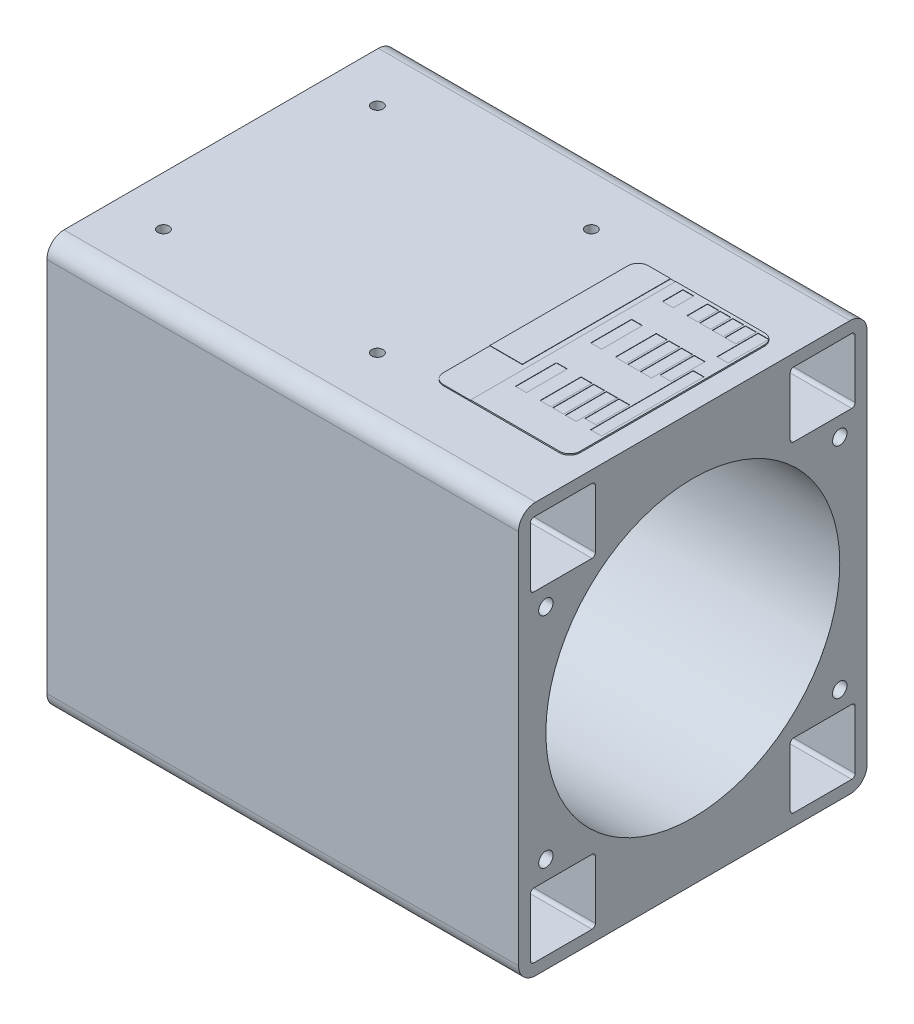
ISO-10303-21;
HEADER;
FILE_DESCRIPTION(('STEP AP214'),'2;1');
FILE_NAME('part.step','',(''),(''),'','','');
FILE_SCHEMA(('AUTOMOTIVE_DESIGN { 1 0 10303 214 1 1 1 1 }'));
ENDSEC;
DATA;
#1=APPLICATION_CONTEXT('core data for automotive mechanical design processes');
#2=APPLICATION_PROTOCOL_DEFINITION('international standard','automotive_design',2000,#1);
#3=PRODUCT_CONTEXT('',#1,'mechanical');
#4=PRODUCT('Part','Part','',(#3));
#5=PRODUCT_RELATED_PRODUCT_CATEGORY('part','',(#4));
#6=PRODUCT_DEFINITION_FORMATION('','',#4);
#7=PRODUCT_DEFINITION_CONTEXT('part definition',#1,'design');
#8=PRODUCT_DEFINITION('design','',#6,#7);
#9=PRODUCT_DEFINITION_SHAPE('','',#8);
#10=(LENGTH_UNIT() NAMED_UNIT(*) SI_UNIT(.MILLI.,.METRE.));
#11=(NAMED_UNIT(*) PLANE_ANGLE_UNIT() SI_UNIT($,.RADIAN.));
#12=(NAMED_UNIT(*) SI_UNIT($,.STERADIAN.) SOLID_ANGLE_UNIT());
#13=UNCERTAINTY_MEASURE_WITH_UNIT(LENGTH_MEASURE(1.E-05),#10,'distance_accuracy_value','');
#14=(GEOMETRIC_REPRESENTATION_CONTEXT(3) GLOBAL_UNCERTAINTY_ASSIGNED_CONTEXT((#13)) GLOBAL_UNIT_ASSIGNED_CONTEXT((#10,
#11,#12)) REPRESENTATION_CONTEXT('',''));
#15=CARTESIAN_POINT('',(0.,0.,0.));
#16=DIRECTION('',(0.,0.,1.));
#17=DIRECTION('',(1.,0.,0.));
#18=AXIS2_PLACEMENT_3D('',#15,#16,#17);
#19=CARTESIAN_POINT('',(26.,60.4,27.));
#20=DIRECTION('',(0.,-1.,0.));
#21=DIRECTION('',(0.,0.,-1.));
#22=AXIS2_PLACEMENT_3D('',#19,#20,#21);
#23=PLANE('',#22);
#24=DIRECTION('',(0.,0.,1.));
#25=VECTOR('',#24,1.);
#26=CARTESIAN_POINT('',(23.,60.4,27.));
#27=LINE('',#26,#25);
#28=CARTESIAN_POINT('',(23.,60.4,-27.));
#29=VERTEX_POINT('',#28);
#30=CARTESIAN_POINT('',(23.,60.4,13.3875205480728));
#31=VERTEX_POINT('',#30);
#32=EDGE_CURVE('E1157',#29,#31,#27,.T.);
#33=ORIENTED_EDGE('',*,*,#32,.T.);
#34=DIRECTION('',(-1.,0.,0.));
#35=VECTOR('',#34,1.);
#36=CARTESIAN_POINT('',(23.,60.4,13.3875205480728));
#37=LINE('',#36,#35);
#38=CARTESIAN_POINT('',(32.5,60.4,13.3875205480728));
#39=VERTEX_POINT('',#38);
#40=EDGE_CURVE('E1106',#39,#31,#37,.T.);
#41=ORIENTED_EDGE('',*,*,#40,.F.);
#42=DIRECTION('',(0.,0.,1.));
#43=VECTOR('',#42,1.);
#44=CARTESIAN_POINT('',(32.5,60.4,-30.));
#45=LINE('',#44,#43);
#46=CARTESIAN_POINT('',(32.5,60.4,-30.));
#47=VERTEX_POINT('',#46);
#48=EDGE_CURVE('E1121',#47,#39,#45,.T.);
#49=ORIENTED_EDGE('',*,*,#48,.F.);
#50=DIRECTION('',(-1.,0.,0.));
#51=VECTOR('',#50,1.);
#52=CARTESIAN_POINT('',(26.,60.4,-30.));
#53=LINE('',#52,#51);
#54=CARTESIAN_POINT('',(26.,60.4,-30.));
#55=VERTEX_POINT('',#54);
#56=EDGE_CURVE('E1151',#47,#55,#53,.T.);
#57=ORIENTED_EDGE('',*,*,#56,.T.);
#58=CARTESIAN_POINT('',(26.,60.4,-27.));
#59=DIRECTION('',(0.,1.,0.));
#60=DIRECTION('',(0.,0.,-1.));
#61=AXIS2_PLACEMENT_3D('',#58,#59,#60);
#62=CIRCLE('',#61,3.);
#63=EDGE_CURVE('E1155',#55,#29,#62,.T.);
#64=ORIENTED_EDGE('',*,*,#63,.T.);
#65=EDGE_LOOP('',(#33,#41,#49,#57,#64));
#66=FACE_BOUND('',#65,.T.);
#67=ADVANCED_FACE('F45',(#66),#23,.F.);
#68=CARTESIAN_POINT('',(26.,60.4,27.));
#69=DIRECTION('',(0.,-1.,0.));
#70=DIRECTION('',(0.,0.,-1.));
#71=AXIS2_PLACEMENT_3D('',#68,#69,#70);
#72=CYLINDRICAL_SURFACE('',#71,3.);
#73=DIRECTION('',(0.,-1.,0.));
#74=VECTOR('',#73,1.);
#75=CARTESIAN_POINT('',(26.,60.4,30.));
#76=LINE('',#75,#74);
#77=CARTESIAN_POINT('',(26.,60.3,30.));
#78=VERTEX_POINT('',#77);
#79=CARTESIAN_POINT('',(26.,60.,30.));
#80=VERTEX_POINT('',#79);
#81=EDGE_CURVE('E1196',#78,#80,#76,.T.);
#82=ORIENTED_EDGE('',*,*,#81,.F.);
#83=CARTESIAN_POINT('',(26.,60.3,27.));
#84=DIRECTION('',(0.,-1.,0.));
#85=DIRECTION('',(0.,0.,-1.));
#86=AXIS2_PLACEMENT_3D('',#83,#84,#85);
#87=CIRCLE('',#86,3.);
#88=CARTESIAN_POINT('',(23.,60.3,27.));
#89=VERTEX_POINT('',#88);
#90=EDGE_CURVE('E1128',#78,#89,#87,.T.);
#91=ORIENTED_EDGE('',*,*,#90,.T.);
#92=DIRECTION('',(0.,-1.,0.));
#93=VECTOR('',#92,1.);
#94=CARTESIAN_POINT('',(23.,60.4,27.));
#95=LINE('',#94,#93);
#96=CARTESIAN_POINT('',(23.,60.,27.));
#97=VERTEX_POINT('',#96);
#98=EDGE_CURVE('E1160',#89,#97,#95,.T.);
#99=ORIENTED_EDGE('',*,*,#98,.T.);
#100=CARTESIAN_POINT('',(26.,60.,27.));
#101=DIRECTION('',(0.,1.,0.));
#102=DIRECTION('',(0.,0.,-1.));
#103=AXIS2_PLACEMENT_3D('',#100,#101,#102);
#104=CIRCLE('',#103,3.);
#105=EDGE_CURVE('E1139',#97,#80,#104,.T.);
#106=ORIENTED_EDGE('',*,*,#105,.T.);
#107=EDGE_LOOP('',(#82,#91,#99,#106));
#108=FACE_BOUND('',#107,.T.);
#109=ADVANCED_FACE('F47',(#108),#72,.T.);
#110=CARTESIAN_POINT('',(26.,60.4,30.));
#111=DIRECTION('',(0.,0.,-1.));
#112=DIRECTION('',(-1.,0.,0.));
#113=AXIS2_PLACEMENT_3D('',#110,#111,#112);
#114=PLANE('',#113);
#115=DIRECTION('',(1.,0.,0.));
#116=VECTOR('',#115,1.);
#117=CARTESIAN_POINT('',(26.,60.4,30.));
#118=LINE('',#117,#116);
#119=CARTESIAN_POINT('',(34.,60.4,30.));
#120=VERTEX_POINT('',#119);
#121=CARTESIAN_POINT('',(60.,60.4,30.));
#122=VERTEX_POINT('',#121);
#123=EDGE_CURVE('E1140',#120,#122,#118,.T.);
#124=ORIENTED_EDGE('',*,*,#123,.F.);
#125=DIRECTION('',(0.,1.,0.));
#126=VECTOR('',#125,1.);
#127=CARTESIAN_POINT('',(34.,60.3,30.));
#128=LINE('',#127,#126);
#129=CARTESIAN_POINT('',(34.,60.3,30.));
#130=VERTEX_POINT('',#129);
#131=EDGE_CURVE('E1119',#130,#120,#128,.T.);
#132=ORIENTED_EDGE('',*,*,#131,.F.);
#133=DIRECTION('',(1.,0.,0.));
#134=VECTOR('',#133,1.);
#135=CARTESIAN_POINT('',(23.,60.3,30.));
#136=LINE('',#135,#134);
#137=EDGE_CURVE('E1105',#78,#130,#136,.T.);
#138=ORIENTED_EDGE('',*,*,#137,.F.);
#139=ORIENTED_EDGE('',*,*,#81,.T.);
#140=DIRECTION('',(1.,0.,0.));
#141=VECTOR('',#140,1.);
#142=CARTESIAN_POINT('',(26.,60.,30.));
#143=LINE('',#142,#141);
#144=CARTESIAN_POINT('',(60.,60.,30.));
#145=VERTEX_POINT('',#144);
#146=EDGE_CURVE('E1163',#80,#145,#143,.T.);
#147=ORIENTED_EDGE('',*,*,#146,.T.);
#148=DIRECTION('',(0.,-1.,0.));
#149=VECTOR('',#148,1.);
#150=CARTESIAN_POINT('',(60.,60.4,30.));
#151=LINE('',#150,#149);
#152=EDGE_CURVE('E1193',#122,#145,#151,.T.);
#153=ORIENTED_EDGE('',*,*,#152,.F.);
#154=EDGE_LOOP('',(#124,#132,#138,#139,#147,#153));
#155=FACE_BOUND('',#154,.T.);
#156=ADVANCED_FACE('F1220',(#155),#114,.F.);
#157=CARTESIAN_POINT('',(60.,60.4,27.));
#158=DIRECTION('',(0.,-1.,0.));
#159=DIRECTION('',(0.,0.,-1.));
#160=AXIS2_PLACEMENT_3D('',#157,#158,#159);
#161=CYLINDRICAL_SURFACE('',#160,3.);
#162=CARTESIAN_POINT('',(60.,60.,27.));
#163=DIRECTION('',(0.,1.,0.));
#164=DIRECTION('',(0.,0.,1.));
#165=AXIS2_PLACEMENT_3D('',#162,#163,#164);
#166=CIRCLE('',#165,3.);
#167=CARTESIAN_POINT('',(63.,60.,27.));
#168=VERTEX_POINT('',#167);
#169=EDGE_CURVE('E1165',#145,#168,#166,.T.);
#170=ORIENTED_EDGE('',*,*,#169,.T.);
#171=DIRECTION('',(0.,-1.,0.));
#172=VECTOR('',#171,1.);
#173=CARTESIAN_POINT('',(63.,60.4,27.));
#174=LINE('',#173,#172);
#175=CARTESIAN_POINT('',(63.,60.4,27.));
#176=VERTEX_POINT('',#175);
#177=EDGE_CURVE('E1190',#176,#168,#174,.T.);
#178=ORIENTED_EDGE('',*,*,#177,.F.);
#179=CARTESIAN_POINT('',(60.,60.4,27.));
#180=DIRECTION('',(0.,1.,0.));
#181=DIRECTION('',(0.,0.,1.));
#182=AXIS2_PLACEMENT_3D('',#179,#180,#181);
#183=CIRCLE('',#182,3.);
#184=EDGE_CURVE('E1142',#122,#176,#183,.T.);
#185=ORIENTED_EDGE('',*,*,#184,.F.);
#186=ORIENTED_EDGE('',*,*,#152,.T.);
#187=EDGE_LOOP('',(#170,#178,#185,#186));
#188=FACE_BOUND('',#187,.T.);
#189=ADVANCED_FACE('F1227',(#188),#161,.T.);
#190=CARTESIAN_POINT('',(63.,60.4,27.));
#191=DIRECTION('',(-1.,0.,0.));
#192=DIRECTION('',(0.,0.,1.));
#193=AXIS2_PLACEMENT_3D('',#190,#191,#192);
#194=PLANE('',#193);
#195=DIRECTION('',(0.,0.,-1.));
#196=VECTOR('',#195,1.);
#197=CARTESIAN_POINT('',(63.,60.,27.));
#198=LINE('',#197,#196);
#199=CARTESIAN_POINT('',(63.,60.,-27.));
#200=VERTEX_POINT('',#199);
#201=EDGE_CURVE('E1167',#168,#200,#198,.T.);
#202=ORIENTED_EDGE('',*,*,#201,.T.);
#203=DIRECTION('',(0.,-1.,0.));
#204=VECTOR('',#203,1.);
#205=CARTESIAN_POINT('',(63.,60.4,-27.));
#206=LINE('',#205,#204);
#207=CARTESIAN_POINT('',(63.,60.4,-27.));
#208=VERTEX_POINT('',#207);
#209=EDGE_CURVE('E1187',#208,#200,#206,.T.);
#210=ORIENTED_EDGE('',*,*,#209,.F.);
#211=DIRECTION('',(0.,0.,-1.));
#212=VECTOR('',#211,1.);
#213=CARTESIAN_POINT('',(63.,60.4,27.));
#214=LINE('',#213,#212);
#215=EDGE_CURVE('E1145',#176,#208,#214,.T.);
#216=ORIENTED_EDGE('',*,*,#215,.F.);
#217=ORIENTED_EDGE('',*,*,#177,.T.);
#218=EDGE_LOOP('',(#202,#210,#216,#217));
#219=FACE_BOUND('',#218,.T.);
#220=ADVANCED_FACE('F1233',(#219),#194,.F.);
#221=CARTESIAN_POINT('',(60.,60.4,-27.));
#222=DIRECTION('',(0.,-1.,0.));
#223=DIRECTION('',(0.,0.,-1.));
#224=AXIS2_PLACEMENT_3D('',#221,#222,#223);
#225=CYLINDRICAL_SURFACE('',#224,3.);
#226=CARTESIAN_POINT('',(60.,60.4,-27.));
#227=DIRECTION('',(0.,1.,0.));
#228=DIRECTION('',(0.,0.,-1.));
#229=AXIS2_PLACEMENT_3D('',#226,#227,#228);
#230=CIRCLE('',#229,3.);
#231=CARTESIAN_POINT('',(62.2360679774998,60.4,-29.));
#232=VERTEX_POINT('',#231);
#233=CARTESIAN_POINT('',(60.,60.4,-30.));
#234=VERTEX_POINT('',#233);
#235=EDGE_CURVE('E1147',#232,#234,#230,.T.);
#236=ORIENTED_EDGE('',*,*,#235,.F.);
#237=DIRECTION('',(0.,-1.,0.));
#238=VECTOR('',#237,1.);
#239=CARTESIAN_POINT('',(62.2360679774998,60.4,-29.));
#240=LINE('',#239,#238);
#241=CARTESIAN_POINT('',(62.2360679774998,60.3,-29.));
#242=VERTEX_POINT('',#241);
#243=EDGE_CURVE('E589',#232,#242,#240,.T.);
#244=ORIENTED_EDGE('',*,*,#243,.T.);
#245=CARTESIAN_POINT('',(60.,60.3,-27.));
#246=DIRECTION('',(0.,1.,0.));
#247=DIRECTION('',(0.,0.,1.));
#248=AXIS2_PLACEMENT_3D('',#245,#246,#247);
#249=CIRCLE('',#248,3.);
#250=CARTESIAN_POINT('',(62.3,60.3,-28.9261360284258));
#251=VERTEX_POINT('',#250);
#252=EDGE_CURVE('E12',#251,#242,#249,.T.);
#253=ORIENTED_EDGE('',*,*,#252,.F.);
#254=DIRECTION('',(0.,-1.,0.));
#255=VECTOR('',#254,1.);
#256=CARTESIAN_POINT('',(62.3,60.4,-28.9261360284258));
#257=LINE('',#256,#255);
#258=CARTESIAN_POINT('',(62.3,60.4,-28.9261360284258));
#259=VERTEX_POINT('',#258);
#260=EDGE_CURVE('E585',#251,#259,#257,.F.);
#261=ORIENTED_EDGE('',*,*,#260,.T.);
#262=EDGE_CURVE('E1148',#208,#259,#230,.T.);
#263=ORIENTED_EDGE('',*,*,#262,.F.);
#264=ORIENTED_EDGE('',*,*,#209,.T.);
#265=CARTESIAN_POINT('',(60.,60.,-27.));
#266=DIRECTION('',(0.,1.,0.));
#267=DIRECTION('',(0.,0.,-1.));
#268=AXIS2_PLACEMENT_3D('',#265,#266,#267);
#269=CIRCLE('',#268,3.);
#270=CARTESIAN_POINT('',(60.,60.,-30.));
#271=VERTEX_POINT('',#270);
#272=EDGE_CURVE('E1169',#200,#271,#269,.T.);
#273=ORIENTED_EDGE('',*,*,#272,.T.);
#274=DIRECTION('',(0.,-1.,0.));
#275=VECTOR('',#274,1.);
#276=CARTESIAN_POINT('',(60.,60.4,-30.));
#277=LINE('',#276,#275);
#278=EDGE_CURVE('E1184',#234,#271,#277,.T.);
#279=ORIENTED_EDGE('',*,*,#278,.F.);
#280=EDGE_LOOP('',(#236,#244,#253,#261,#263,#264,#273,#279));
#281=FACE_BOUND('',#280,.T.);
#282=ADVANCED_FACE('F1204',(#281),#225,.T.);
#283=CARTESIAN_POINT('',(26.,60.4,-30.));
#284=DIRECTION('',(0.,0.,1.));
#285=DIRECTION('',(1.,0.,0.));
#286=AXIS2_PLACEMENT_3D('',#283,#284,#285);
#287=PLANE('',#286);
#288=ORIENTED_EDGE('',*,*,#56,.F.);
#289=DIRECTION('',(0.,1.,0.));
#290=VECTOR('',#289,1.);
#291=CARTESIAN_POINT('',(32.5,60.3,-30.));
#292=LINE('',#291,#290);
#293=CARTESIAN_POINT('',(32.5,60.3,-30.));
#294=VERTEX_POINT('',#293);
#295=EDGE_CURVE('E1131',#294,#47,#292,.T.);
#296=ORIENTED_EDGE('',*,*,#295,.F.);
#297=DIRECTION('',(-1.,0.,0.));
#298=VECTOR('',#297,1.);
#299=CARTESIAN_POINT('',(34.,60.3,-30.));
#300=LINE('',#299,#298);
#301=CARTESIAN_POINT('',(34.,60.3,-30.));
#302=VERTEX_POINT('',#301);
#303=EDGE_CURVE('E1110',#302,#294,#300,.T.);
#304=ORIENTED_EDGE('',*,*,#303,.F.);
#305=DIRECTION('',(0.,1.,0.));
#306=VECTOR('',#305,1.);
#307=CARTESIAN_POINT('',(34.,60.3,-30.));
#308=LINE('',#307,#306);
#309=CARTESIAN_POINT('',(34.,60.4,-30.));
#310=VERTEX_POINT('',#309);
#311=EDGE_CURVE('E1133',#302,#310,#308,.T.);
#312=ORIENTED_EDGE('',*,*,#311,.T.);
#313=EDGE_CURVE('E1152',#234,#310,#53,.T.);
#314=ORIENTED_EDGE('',*,*,#313,.F.);
#315=ORIENTED_EDGE('',*,*,#278,.T.);
#316=DIRECTION('',(-1.,0.,0.));
#317=VECTOR('',#316,1.);
#318=CARTESIAN_POINT('',(26.,60.,-30.));
#319=LINE('',#318,#317);
#320=CARTESIAN_POINT('',(26.,60.,-30.));
#321=VERTEX_POINT('',#320);
#322=EDGE_CURVE('E1171',#271,#321,#319,.T.);
#323=ORIENTED_EDGE('',*,*,#322,.T.);
#324=DIRECTION('',(0.,-1.,0.));
#325=VECTOR('',#324,1.);
#326=CARTESIAN_POINT('',(26.,60.4,-30.));
#327=LINE('',#326,#325);
#328=EDGE_CURVE('E1181',#55,#321,#327,.T.);
#329=ORIENTED_EDGE('',*,*,#328,.F.);
#330=EDGE_LOOP('',(#288,#296,#304,#312,#314,#315,#323,#329));
#331=FACE_BOUND('',#330,.T.);
#332=ADVANCED_FACE('F1211',(#331),#287,.F.);
#333=CARTESIAN_POINT('',(26.,60.4,-27.));
#334=DIRECTION('',(0.,-1.,0.));
#335=DIRECTION('',(0.,0.,-1.));
#336=AXIS2_PLACEMENT_3D('',#333,#334,#335);
#337=CYLINDRICAL_SURFACE('',#336,3.);
#338=CARTESIAN_POINT('',(26.,60.,-27.));
#339=DIRECTION('',(0.,1.,0.));
#340=DIRECTION('',(0.,0.,-1.));
#341=AXIS2_PLACEMENT_3D('',#338,#339,#340);
#342=CIRCLE('',#341,3.);
#343=CARTESIAN_POINT('',(23.,60.,-27.));
#344=VERTEX_POINT('',#343);
#345=EDGE_CURVE('E1173',#321,#344,#342,.T.);
#346=ORIENTED_EDGE('',*,*,#345,.T.);
#347=DIRECTION('',(0.,-1.,0.));
#348=VECTOR('',#347,1.);
#349=CARTESIAN_POINT('',(23.,60.4,-27.));
#350=LINE('',#349,#348);
#351=EDGE_CURVE('E1178',#29,#344,#350,.T.);
#352=ORIENTED_EDGE('',*,*,#351,.F.);
#353=ORIENTED_EDGE('',*,*,#63,.F.);
#354=ORIENTED_EDGE('',*,*,#328,.T.);
#355=EDGE_LOOP('',(#346,#352,#353,#354));
#356=FACE_BOUND('',#355,.T.);
#357=ADVANCED_FACE('F1266',(#356),#337,.T.);
#358=CARTESIAN_POINT('',(23.,60.4,27.));
#359=DIRECTION('',(1.,0.,0.));
#360=DIRECTION('',(0.,0.,-1.));
#361=AXIS2_PLACEMENT_3D('',#358,#359,#360);
#362=PLANE('',#361);
#363=DIRECTION('',(0.,0.,1.));
#364=VECTOR('',#363,1.);
#365=CARTESIAN_POINT('',(23.,60.3,30.));
#366=LINE('',#365,#364);
#367=CARTESIAN_POINT('',(23.,60.3,13.3875205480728));
#368=VERTEX_POINT('',#367);
#369=EDGE_CURVE('E1103',#368,#89,#366,.T.);
#370=ORIENTED_EDGE('',*,*,#369,.F.);
#371=DIRECTION('',(0.,1.,0.));
#372=VECTOR('',#371,1.);
#373=CARTESIAN_POINT('',(23.,60.3,13.3875205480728));
#374=LINE('',#373,#372);
#375=EDGE_CURVE('E1125',#368,#31,#374,.T.);
#376=ORIENTED_EDGE('',*,*,#375,.T.);
#377=ORIENTED_EDGE('',*,*,#32,.F.);
#378=ORIENTED_EDGE('',*,*,#351,.T.);
#379=DIRECTION('',(0.,0.,1.));
#380=VECTOR('',#379,1.);
#381=CARTESIAN_POINT('',(23.,60.,27.));
#382=LINE('',#381,#380);
#383=EDGE_CURVE('E1143',#344,#97,#382,.T.);
#384=ORIENTED_EDGE('',*,*,#383,.T.);
#385=ORIENTED_EDGE('',*,*,#98,.F.);
#386=EDGE_LOOP('',(#370,#376,#377,#378,#384,#385));
#387=FACE_BOUND('',#386,.T.);
#388=ADVANCED_FACE('F1258',(#387),#362,.F.);
#389=DIRECTION('',(1.,0.,0.));
#390=VECTOR('',#389,1.);
#391=CARTESIAN_POINT('',(59.1,60.4,20.));
#392=LINE('',#391,#390);
#393=CARTESIAN_POINT('',(59.1,60.4,20.));
#394=VERTEX_POINT('',#393);
#395=CARTESIAN_POINT('',(62.3,60.4,20.));
#396=VERTEX_POINT('',#395);
#397=EDGE_CURVE('E607',#394,#396,#392,.T.);
#398=ORIENTED_EDGE('',*,*,#397,.F.);
#399=DIRECTION('',(0.,0.,1.));
#400=VECTOR('',#399,1.);
#401=CARTESIAN_POINT('',(59.1,60.4,20.));
#402=LINE('',#401,#400);
#403=CARTESIAN_POINT('',(59.1,60.4,-10.));
#404=VERTEX_POINT('',#403);
#405=EDGE_CURVE('E68',#404,#394,#402,.T.);
#406=ORIENTED_EDGE('',*,*,#405,.F.);
#407=DIRECTION('',(-1.,0.,0.));
#408=VECTOR('',#407,1.);
#409=CARTESIAN_POINT('',(59.1,60.4,-10.));
#410=LINE('',#409,#408);
#411=CARTESIAN_POINT('',(62.3,60.4,-10.));
#412=VERTEX_POINT('',#411);
#413=EDGE_CURVE('E596',#412,#404,#410,.T.);
#414=ORIENTED_EDGE('',*,*,#413,.F.);
#415=DIRECTION('',(0.,0.,-1.));
#416=VECTOR('',#415,1.);
#417=CARTESIAN_POINT('',(62.3,60.4,20.));
#418=LINE('',#417,#416);
#419=EDGE_CURVE('E610',#396,#412,#418,.T.);
#420=ORIENTED_EDGE('',*,*,#419,.F.);
#421=EDGE_LOOP('',(#398,#406,#414,#420));
#422=FACE_BOUND('',#421,.T.);
#423=DIRECTION('',(1.,0.,0.));
#424=VECTOR('',#423,1.);
#425=CARTESIAN_POINT('',(55.4,60.4,-23.));
#426=LINE('',#425,#424);
#427=CARTESIAN_POINT('',(55.4,60.4,-23.));
#428=VERTEX_POINT('',#427);
#429=CARTESIAN_POINT('',(58.6,60.4,-23.));
#430=VERTEX_POINT('',#429);
#431=EDGE_CURVE('E638',#428,#430,#426,.T.);
#432=ORIENTED_EDGE('',*,*,#431,.F.);
#433=DIRECTION('',(0.,0.,1.));
#434=VECTOR('',#433,1.);
#435=CARTESIAN_POINT('',(55.4,60.4,-23.));
#436=LINE('',#435,#434);
#437=CARTESIAN_POINT('',(55.4,60.4,-29.));
#438=VERTEX_POINT('',#437);
#439=EDGE_CURVE('E617',#438,#428,#436,.T.);
#440=ORIENTED_EDGE('',*,*,#439,.F.);
#441=DIRECTION('',(-1.,0.,0.));
#442=VECTOR('',#441,1.);
#443=CARTESIAN_POINT('',(55.4,60.4,-29.));
#444=LINE('',#443,#442);
#445=CARTESIAN_POINT('',(58.6,60.4,-29.));
#446=VERTEX_POINT('',#445);
#447=EDGE_CURVE('E627',#446,#438,#444,.T.);
#448=ORIENTED_EDGE('',*,*,#447,.F.);
#449=DIRECTION('',(0.,0.,-1.));
#450=VECTOR('',#449,1.);
#451=CARTESIAN_POINT('',(58.6,60.4,-23.));
#452=LINE('',#451,#450);
#453=EDGE_CURVE('E641',#430,#446,#452,.T.);
#454=ORIENTED_EDGE('',*,*,#453,.F.);
#455=EDGE_LOOP('',(#432,#440,#448,#454));
#456=FACE_BOUND('',#455,.T.);
#457=DIRECTION('',(1.,0.,0.));
#458=VECTOR('',#457,1.);
#459=CARTESIAN_POINT('',(55.4,60.4,-4.));
#460=LINE('',#459,#458);
#461=CARTESIAN_POINT('',(55.4,60.4,-4.));
#462=VERTEX_POINT('',#461);
#463=CARTESIAN_POINT('',(58.6,60.4,-4.));
#464=VERTEX_POINT('',#463);
#465=EDGE_CURVE('E670',#462,#464,#460,.T.);
#466=ORIENTED_EDGE('',*,*,#465,.F.);
#467=DIRECTION('',(0.,0.,1.));
#468=VECTOR('',#467,1.);
#469=CARTESIAN_POINT('',(55.4,60.4,-4.));
#470=LINE('',#469,#468);
#471=CARTESIAN_POINT('',(55.4,60.4,-14.));
#472=VERTEX_POINT('',#471);
#473=EDGE_CURVE('E648',#472,#462,#470,.T.);
#474=ORIENTED_EDGE('',*,*,#473,.F.);
#475=DIRECTION('',(-1.,0.,0.));
#476=VECTOR('',#475,1.);
#477=CARTESIAN_POINT('',(55.4,60.4,-14.));
#478=LINE('',#477,#476);
#479=CARTESIAN_POINT('',(58.6,60.4,-14.));
#480=VERTEX_POINT('',#479);
#481=EDGE_CURVE('E659',#480,#472,#478,.T.);
#482=ORIENTED_EDGE('',*,*,#481,.F.);
#483=DIRECTION('',(0.,0.,-1.));
#484=VECTOR('',#483,1.);
#485=CARTESIAN_POINT('',(58.6,60.4,-4.));
#486=LINE('',#485,#484);
#487=EDGE_CURVE('E673',#464,#480,#486,.T.);
#488=ORIENTED_EDGE('',*,*,#487,.F.);
#489=EDGE_LOOP('',(#466,#474,#482,#488));
#490=FACE_BOUND('',#489,.T.);
#491=DIRECTION('',(1.,0.,0.));
#492=VECTOR('',#491,1.);
#493=CARTESIAN_POINT('',(55.4,60.4,18.));
#494=LINE('',#493,#492);
#495=CARTESIAN_POINT('',(55.4,60.4,18.));
#496=VERTEX_POINT('',#495);
#497=CARTESIAN_POINT('',(58.6,60.4,18.));
#498=VERTEX_POINT('',#497);
#499=EDGE_CURVE('E702',#496,#498,#494,.T.);
#500=ORIENTED_EDGE('',*,*,#499,.F.);
#501=DIRECTION('',(0.,0.,1.));
#502=VECTOR('',#501,1.);
#503=CARTESIAN_POINT('',(55.4,60.4,18.));
#504=LINE('',#503,#502);
#505=CARTESIAN_POINT('',(55.4,60.4,8.));
#506=VERTEX_POINT('',#505);
#507=EDGE_CURVE('E680',#506,#496,#504,.T.);
#508=ORIENTED_EDGE('',*,*,#507,.F.);
#509=DIRECTION('',(-1.,0.,0.));
#510=VECTOR('',#509,1.);
#511=CARTESIAN_POINT('',(55.4,60.4,8.));
#512=LINE('',#511,#510);
#513=CARTESIAN_POINT('',(58.6,60.4,8.));
#514=VERTEX_POINT('',#513);
#515=EDGE_CURVE('E691',#514,#506,#512,.T.);
#516=ORIENTED_EDGE('',*,*,#515,.F.);
#517=DIRECTION('',(0.,0.,-1.));
#518=VECTOR('',#517,1.);
#519=CARTESIAN_POINT('',(58.6,60.4,18.));
#520=LINE('',#519,#518);
#521=EDGE_CURVE('E705',#498,#514,#520,.T.);
#522=ORIENTED_EDGE('',*,*,#521,.F.);
#523=EDGE_LOOP('',(#500,#508,#516,#522));
#524=FACE_BOUND('',#523,.T.);
#525=DIRECTION('',(1.,0.,0.));
#526=VECTOR('',#525,1.);
#527=CARTESIAN_POINT('',(51.7,60.4,-23.));
#528=LINE('',#527,#526);
#529=CARTESIAN_POINT('',(51.7,60.4,-23.));
#530=VERTEX_POINT('',#529);
#531=CARTESIAN_POINT('',(54.9,60.4,-23.));
#532=VERTEX_POINT('',#531);
#533=EDGE_CURVE('E734',#530,#532,#528,.T.);
#534=ORIENTED_EDGE('',*,*,#533,.F.);
#535=DIRECTION('',(0.,0.,1.));
#536=VECTOR('',#535,1.);
#537=CARTESIAN_POINT('',(51.7,60.4,-23.));
#538=LINE('',#537,#536);
#539=CARTESIAN_POINT('',(51.7,60.4,-29.));
#540=VERTEX_POINT('',#539);
#541=EDGE_CURVE('E712',#540,#530,#538,.T.);
#542=ORIENTED_EDGE('',*,*,#541,.F.);
#543=DIRECTION('',(-1.,0.,0.));
#544=VECTOR('',#543,1.);
#545=CARTESIAN_POINT('',(51.7,60.4,-29.));
#546=LINE('',#545,#544);
#547=CARTESIAN_POINT('',(54.9,60.4,-29.));
#548=VERTEX_POINT('',#547);
#549=EDGE_CURVE('E723',#548,#540,#546,.T.);
#550=ORIENTED_EDGE('',*,*,#549,.F.);
#551=DIRECTION('',(0.,0.,-1.));
#552=VECTOR('',#551,1.);
#553=CARTESIAN_POINT('',(54.9,60.4,-23.));
#554=LINE('',#553,#552);
#555=EDGE_CURVE('E737',#532,#548,#554,.T.);
#556=ORIENTED_EDGE('',*,*,#555,.F.);
#557=EDGE_LOOP('',(#534,#542,#550,#556));
#558=FACE_BOUND('',#557,.T.);
#559=DIRECTION('',(1.,0.,0.));
#560=VECTOR('',#559,1.);
#561=CARTESIAN_POINT('',(51.7,60.4,-2.));
#562=LINE('',#561,#560);
#563=CARTESIAN_POINT('',(51.7,60.4,-2.00000000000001));
#564=VERTEX_POINT('',#563);
#565=CARTESIAN_POINT('',(54.9,60.4,-2.));
#566=VERTEX_POINT('',#565);
#567=EDGE_CURVE('E766',#564,#566,#562,.T.);
#568=ORIENTED_EDGE('',*,*,#567,.F.);
#569=DIRECTION('',(0.,0.,1.));
#570=VECTOR('',#569,1.);
#571=CARTESIAN_POINT('',(51.7,60.4,-2.));
#572=LINE('',#571,#570);
#573=CARTESIAN_POINT('',(51.7,60.4,-14.));
#574=VERTEX_POINT('',#573);
#575=EDGE_CURVE('E744',#574,#564,#572,.T.);
#576=ORIENTED_EDGE('',*,*,#575,.F.);
#577=DIRECTION('',(-1.,0.,0.));
#578=VECTOR('',#577,1.);
#579=CARTESIAN_POINT('',(51.7,60.4,-14.));
#580=LINE('',#579,#578);
#581=CARTESIAN_POINT('',(54.9,60.4,-14.));
#582=VERTEX_POINT('',#581);
#583=EDGE_CURVE('E755',#582,#574,#580,.T.);
#584=ORIENTED_EDGE('',*,*,#583,.F.);
#585=DIRECTION('',(0.,0.,-1.));
#586=VECTOR('',#585,1.);
#587=CARTESIAN_POINT('',(54.9,60.4,-2.));
#588=LINE('',#587,#586);
#589=EDGE_CURVE('E769',#566,#582,#588,.T.);
#590=ORIENTED_EDGE('',*,*,#589,.F.);
#591=EDGE_LOOP('',(#568,#576,#584,#590));
#592=FACE_BOUND('',#591,.T.);
#593=DIRECTION('',(1.,0.,0.));
#594=VECTOR('',#593,1.);
#595=CARTESIAN_POINT('',(51.7,60.4,20.));
#596=LINE('',#595,#594);
#597=CARTESIAN_POINT('',(51.7,60.4,20.));
#598=VERTEX_POINT('',#597);
#599=CARTESIAN_POINT('',(54.9,60.4,20.));
#600=VERTEX_POINT('',#599);
#601=EDGE_CURVE('E798',#598,#600,#596,.T.);
#602=ORIENTED_EDGE('',*,*,#601,.F.);
#603=DIRECTION('',(0.,0.,1.));
#604=VECTOR('',#603,1.);
#605=CARTESIAN_POINT('',(51.7,60.4,20.));
#606=LINE('',#605,#604);
#607=CARTESIAN_POINT('',(51.7,60.4,8.));
#608=VERTEX_POINT('',#607);
#609=EDGE_CURVE('E776',#608,#598,#606,.T.);
#610=ORIENTED_EDGE('',*,*,#609,.F.);
#611=DIRECTION('',(-1.,0.,0.));
#612=VECTOR('',#611,1.);
#613=CARTESIAN_POINT('',(51.7,60.4,8.));
#614=LINE('',#613,#612);
#615=CARTESIAN_POINT('',(54.9,60.4,8.));
#616=VERTEX_POINT('',#615);
#617=EDGE_CURVE('E787',#616,#608,#614,.T.);
#618=ORIENTED_EDGE('',*,*,#617,.F.);
#619=DIRECTION('',(0.,0.,-1.));
#620=VECTOR('',#619,1.);
#621=CARTESIAN_POINT('',(54.9,60.4,20.));
#622=LINE('',#621,#620);
#623=EDGE_CURVE('E801',#600,#616,#622,.T.);
#624=ORIENTED_EDGE('',*,*,#623,.F.);
#625=EDGE_LOOP('',(#602,#610,#618,#624));
#626=FACE_BOUND('',#625,.T.);
#627=DIRECTION('',(1.,0.,0.));
#628=VECTOR('',#627,1.);
#629=CARTESIAN_POINT('',(48.,60.4,-23.));
#630=LINE('',#629,#628);
#631=CARTESIAN_POINT('',(48.,60.4,-23.));
#632=VERTEX_POINT('',#631);
#633=CARTESIAN_POINT('',(51.2,60.4,-23.));
#634=VERTEX_POINT('',#633);
#635=EDGE_CURVE('E830',#632,#634,#630,.T.);
#636=ORIENTED_EDGE('',*,*,#635,.F.);
#637=DIRECTION('',(0.,0.,1.));
#638=VECTOR('',#637,1.);
#639=CARTESIAN_POINT('',(48.,60.4,-23.));
#640=LINE('',#639,#638);
#641=CARTESIAN_POINT('',(48.,60.4,-29.));
#642=VERTEX_POINT('',#641);
#643=EDGE_CURVE('E808',#642,#632,#640,.T.);
#644=ORIENTED_EDGE('',*,*,#643,.F.);
#645=DIRECTION('',(-1.,0.,0.));
#646=VECTOR('',#645,1.);
#647=CARTESIAN_POINT('',(48.,60.4,-29.));
#648=LINE('',#647,#646);
#649=CARTESIAN_POINT('',(51.2,60.4,-29.));
#650=VERTEX_POINT('',#649);
#651=EDGE_CURVE('E819',#650,#642,#648,.T.);
#652=ORIENTED_EDGE('',*,*,#651,.F.);
#653=DIRECTION('',(0.,0.,-1.));
#654=VECTOR('',#653,1.);
#655=CARTESIAN_POINT('',(51.2,60.4,-23.));
#656=LINE('',#655,#654);
#657=EDGE_CURVE('E833',#634,#650,#656,.T.);
#658=ORIENTED_EDGE('',*,*,#657,.F.);
#659=EDGE_LOOP('',(#636,#644,#652,#658));
#660=FACE_BOUND('',#659,.T.);
#661=DIRECTION('',(1.,0.,0.));
#662=VECTOR('',#661,1.);
#663=CARTESIAN_POINT('',(48.,60.4,-2.));
#664=LINE('',#663,#662);
#665=CARTESIAN_POINT('',(48.,60.4,-2.00000000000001));
#666=VERTEX_POINT('',#665);
#667=CARTESIAN_POINT('',(51.2,60.4,-2.));
#668=VERTEX_POINT('',#667);
#669=EDGE_CURVE('E862',#666,#668,#664,.T.);
#670=ORIENTED_EDGE('',*,*,#669,.F.);
#671=DIRECTION('',(0.,0.,1.));
#672=VECTOR('',#671,1.);
#673=CARTESIAN_POINT('',(48.,60.4,-2.));
#674=LINE('',#673,#672);
#675=CARTESIAN_POINT('',(48.,60.4,-14.));
#676=VERTEX_POINT('',#675);
#677=EDGE_CURVE('E840',#676,#666,#674,.T.);
#678=ORIENTED_EDGE('',*,*,#677,.F.);
#679=DIRECTION('',(-1.,0.,0.));
#680=VECTOR('',#679,1.);
#681=CARTESIAN_POINT('',(48.,60.4,-14.));
#682=LINE('',#681,#680);
#683=CARTESIAN_POINT('',(51.2,60.4,-14.));
#684=VERTEX_POINT('',#683);
#685=EDGE_CURVE('E851',#684,#676,#682,.T.);
#686=ORIENTED_EDGE('',*,*,#685,.F.);
#687=DIRECTION('',(0.,0.,-1.));
#688=VECTOR('',#687,1.);
#689=CARTESIAN_POINT('',(51.2,60.4,-2.));
#690=LINE('',#689,#688);
#691=EDGE_CURVE('E865',#668,#684,#690,.T.);
#692=ORIENTED_EDGE('',*,*,#691,.F.);
#693=EDGE_LOOP('',(#670,#678,#686,#692));
#694=FACE_BOUND('',#693,.T.);
#695=DIRECTION('',(1.,0.,0.));
#696=VECTOR('',#695,1.);
#697=CARTESIAN_POINT('',(48.,60.4,20.));
#698=LINE('',#697,#696);
#699=CARTESIAN_POINT('',(48.,60.4,20.));
#700=VERTEX_POINT('',#699);
#701=CARTESIAN_POINT('',(51.2,60.4,20.));
#702=VERTEX_POINT('',#701);
#703=EDGE_CURVE('E894',#700,#702,#698,.T.);
#704=ORIENTED_EDGE('',*,*,#703,.F.);
#705=DIRECTION('',(0.,0.,1.));
#706=VECTOR('',#705,1.);
#707=CARTESIAN_POINT('',(48.,60.4,20.));
#708=LINE('',#707,#706);
#709=CARTESIAN_POINT('',(48.,60.4,8.));
#710=VERTEX_POINT('',#709);
#711=EDGE_CURVE('E872',#710,#700,#708,.T.);
#712=ORIENTED_EDGE('',*,*,#711,.F.);
#713=DIRECTION('',(-1.,0.,0.));
#714=VECTOR('',#713,1.);
#715=CARTESIAN_POINT('',(48.,60.4,8.));
#716=LINE('',#715,#714);
#717=CARTESIAN_POINT('',(51.2,60.4,8.));
#718=VERTEX_POINT('',#717);
#719=EDGE_CURVE('E883',#718,#710,#716,.T.);
#720=ORIENTED_EDGE('',*,*,#719,.F.);
#721=DIRECTION('',(0.,0.,-1.));
#722=VECTOR('',#721,1.);
#723=CARTESIAN_POINT('',(51.2,60.4,20.));
#724=LINE('',#723,#722);
#725=EDGE_CURVE('E897',#702,#718,#724,.T.);
#726=ORIENTED_EDGE('',*,*,#725,.F.);
#727=EDGE_LOOP('',(#704,#712,#720,#726));
#728=FACE_BOUND('',#727,.T.);
#729=DIRECTION('',(1.,0.,0.));
#730=VECTOR('',#729,1.);
#731=CARTESIAN_POINT('',(44.3,60.4,-23.));
#732=LINE('',#731,#730);
#733=CARTESIAN_POINT('',(44.3,60.4,-23.));
#734=VERTEX_POINT('',#733);
#735=CARTESIAN_POINT('',(47.5,60.4,-23.));
#736=VERTEX_POINT('',#735);
#737=EDGE_CURVE('E926',#734,#736,#732,.T.);
#738=ORIENTED_EDGE('',*,*,#737,.F.);
#739=DIRECTION('',(0.,0.,1.));
#740=VECTOR('',#739,1.);
#741=CARTESIAN_POINT('',(44.3,60.4,-23.));
#742=LINE('',#741,#740);
#743=CARTESIAN_POINT('',(44.3,60.4,-29.));
#744=VERTEX_POINT('',#743);
#745=EDGE_CURVE('E904',#744,#734,#742,.T.);
#746=ORIENTED_EDGE('',*,*,#745,.F.);
#747=DIRECTION('',(-1.,0.,0.));
#748=VECTOR('',#747,1.);
#749=CARTESIAN_POINT('',(44.3,60.4,-29.));
#750=LINE('',#749,#748);
#751=CARTESIAN_POINT('',(47.5,60.4,-29.));
#752=VERTEX_POINT('',#751);
#753=EDGE_CURVE('E915',#752,#744,#750,.T.);
#754=ORIENTED_EDGE('',*,*,#753,.F.);
#755=DIRECTION('',(0.,0.,-1.));
#756=VECTOR('',#755,1.);
#757=CARTESIAN_POINT('',(47.5,60.4,-23.));
#758=LINE('',#757,#756);
#759=EDGE_CURVE('E929',#736,#752,#758,.T.);
#760=ORIENTED_EDGE('',*,*,#759,.F.);
#761=EDGE_LOOP('',(#738,#746,#754,#760));
#762=FACE_BOUND('',#761,.T.);
#763=DIRECTION('',(1.,0.,0.));
#764=VECTOR('',#763,1.);
#765=CARTESIAN_POINT('',(44.3,60.4,-2.));
#766=LINE('',#765,#764);
#767=CARTESIAN_POINT('',(44.3,60.4,-2.00000000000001));
#768=VERTEX_POINT('',#767);
#769=CARTESIAN_POINT('',(47.5,60.4,-2.));
#770=VERTEX_POINT('',#769);
#771=EDGE_CURVE('E958',#768,#770,#766,.T.);
#772=ORIENTED_EDGE('',*,*,#771,.F.);
#773=DIRECTION('',(0.,0.,1.));
#774=VECTOR('',#773,1.);
#775=CARTESIAN_POINT('',(44.3,60.4,-2.));
#776=LINE('',#775,#774);
#777=CARTESIAN_POINT('',(44.3,60.4,-14.));
#778=VERTEX_POINT('',#777);
#779=EDGE_CURVE('E936',#778,#768,#776,.T.);
#780=ORIENTED_EDGE('',*,*,#779,.F.);
#781=DIRECTION('',(-1.,0.,0.));
#782=VECTOR('',#781,1.);
#783=CARTESIAN_POINT('',(44.3,60.4,-14.));
#784=LINE('',#783,#782);
#785=CARTESIAN_POINT('',(47.5,60.4,-14.));
#786=VERTEX_POINT('',#785);
#787=EDGE_CURVE('E947',#786,#778,#784,.T.);
#788=ORIENTED_EDGE('',*,*,#787,.F.);
#789=DIRECTION('',(0.,0.,-1.));
#790=VECTOR('',#789,1.);
#791=CARTESIAN_POINT('',(47.5,60.4,-2.));
#792=LINE('',#791,#790);
#793=EDGE_CURVE('E961',#770,#786,#792,.T.);
#794=ORIENTED_EDGE('',*,*,#793,.F.);
#795=EDGE_LOOP('',(#772,#780,#788,#794));
#796=FACE_BOUND('',#795,.T.);
#797=DIRECTION('',(1.,0.,0.));
#798=VECTOR('',#797,1.);
#799=CARTESIAN_POINT('',(44.3,60.4,20.));
#800=LINE('',#799,#798);
#801=CARTESIAN_POINT('',(44.3,60.4,20.));
#802=VERTEX_POINT('',#801);
#803=CARTESIAN_POINT('',(47.5,60.4,20.));
#804=VERTEX_POINT('',#803);
#805=EDGE_CURVE('E990',#802,#804,#800,.T.);
#806=ORIENTED_EDGE('',*,*,#805,.F.);
#807=DIRECTION('',(0.,0.,1.));
#808=VECTOR('',#807,1.);
#809=CARTESIAN_POINT('',(44.3,60.4,20.));
#810=LINE('',#809,#808);
#811=CARTESIAN_POINT('',(44.3,60.4,8.));
#812=VERTEX_POINT('',#811);
#813=EDGE_CURVE('E968',#812,#802,#810,.T.);
#814=ORIENTED_EDGE('',*,*,#813,.F.);
#815=DIRECTION('',(-1.,0.,0.));
#816=VECTOR('',#815,1.);
#817=CARTESIAN_POINT('',(44.3,60.4,8.));
#818=LINE('',#817,#816);
#819=CARTESIAN_POINT('',(47.5,60.4,8.));
#820=VERTEX_POINT('',#819);
#821=EDGE_CURVE('E979',#820,#812,#818,.T.);
#822=ORIENTED_EDGE('',*,*,#821,.F.);
#823=DIRECTION('',(0.,0.,-1.));
#824=VECTOR('',#823,1.);
#825=CARTESIAN_POINT('',(47.5,60.4,20.));
#826=LINE('',#825,#824);
#827=EDGE_CURVE('E993',#804,#820,#826,.T.);
#828=ORIENTED_EDGE('',*,*,#827,.F.);
#829=EDGE_LOOP('',(#806,#814,#822,#828));
#830=FACE_BOUND('',#829,.T.);
#831=DIRECTION('',(1.,0.,0.));
#832=VECTOR('',#831,1.);
#833=CARTESIAN_POINT('',(37.1,60.4,-23.));
#834=LINE('',#833,#832);
#835=CARTESIAN_POINT('',(37.1,60.4,-23.));
#836=VERTEX_POINT('',#835);
#837=CARTESIAN_POINT('',(40.3,60.4,-23.));
#838=VERTEX_POINT('',#837);
#839=EDGE_CURVE('E1022',#836,#838,#834,.T.);
#840=ORIENTED_EDGE('',*,*,#839,.F.);
#841=DIRECTION('',(0.,0.,1.));
#842=VECTOR('',#841,1.);
#843=CARTESIAN_POINT('',(37.1,60.4,-23.));
#844=LINE('',#843,#842);
#845=CARTESIAN_POINT('',(37.1,60.4,-29.));
#846=VERTEX_POINT('',#845);
#847=EDGE_CURVE('E1000',#846,#836,#844,.T.);
#848=ORIENTED_EDGE('',*,*,#847,.F.);
#849=DIRECTION('',(-1.,0.,0.));
#850=VECTOR('',#849,1.);
#851=CARTESIAN_POINT('',(37.1,60.4,-29.));
#852=LINE('',#851,#850);
#853=CARTESIAN_POINT('',(40.3,60.4,-29.));
#854=VERTEX_POINT('',#853);
#855=EDGE_CURVE('E1011',#854,#846,#852,.T.);
#856=ORIENTED_EDGE('',*,*,#855,.F.);
#857=DIRECTION('',(0.,0.,-1.));
#858=VECTOR('',#857,1.);
#859=CARTESIAN_POINT('',(40.3,60.4,-23.));
#860=LINE('',#859,#858);
#861=EDGE_CURVE('E1025',#838,#854,#860,.T.);
#862=ORIENTED_EDGE('',*,*,#861,.F.);
#863=EDGE_LOOP('',(#840,#848,#856,#862));
#864=FACE_BOUND('',#863,.T.);
#865=DIRECTION('',(1.,0.,0.));
#866=VECTOR('',#865,1.);
#867=CARTESIAN_POINT('',(37.1,60.4,-2.));
#868=LINE('',#867,#866);
#869=CARTESIAN_POINT('',(37.1,60.4,-2.00000000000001));
#870=VERTEX_POINT('',#869);
#871=CARTESIAN_POINT('',(40.3,60.4,-2.));
#872=VERTEX_POINT('',#871);
#873=EDGE_CURVE('E1054',#870,#872,#868,.T.);
#874=ORIENTED_EDGE('',*,*,#873,.F.);
#875=DIRECTION('',(0.,0.,1.));
#876=VECTOR('',#875,1.);
#877=CARTESIAN_POINT('',(37.1,60.4,-2.));
#878=LINE('',#877,#876);
#879=CARTESIAN_POINT('',(37.1,60.4,-14.));
#880=VERTEX_POINT('',#879);
#881=EDGE_CURVE('E1032',#880,#870,#878,.T.);
#882=ORIENTED_EDGE('',*,*,#881,.F.);
#883=DIRECTION('',(-1.,0.,0.));
#884=VECTOR('',#883,1.);
#885=CARTESIAN_POINT('',(37.1,60.4,-14.));
#886=LINE('',#885,#884);
#887=CARTESIAN_POINT('',(40.3,60.4,-14.));
#888=VERTEX_POINT('',#887);
#889=EDGE_CURVE('E1043',#888,#880,#886,.T.);
#890=ORIENTED_EDGE('',*,*,#889,.F.);
#891=DIRECTION('',(0.,0.,-1.));
#892=VECTOR('',#891,1.);
#893=CARTESIAN_POINT('',(40.3,60.4,-2.));
#894=LINE('',#893,#892);
#895=EDGE_CURVE('E1057',#872,#888,#894,.T.);
#896=ORIENTED_EDGE('',*,*,#895,.F.);
#897=EDGE_LOOP('',(#874,#882,#890,#896));
#898=FACE_BOUND('',#897,.T.);
#899=DIRECTION('',(1.,0.,0.));
#900=VECTOR('',#899,1.);
#901=CARTESIAN_POINT('',(37.1,60.4,20.));
#902=LINE('',#901,#900);
#903=CARTESIAN_POINT('',(37.1,60.4,20.));
#904=VERTEX_POINT('',#903);
#905=CARTESIAN_POINT('',(40.3,60.4,20.));
#906=VERTEX_POINT('',#905);
#907=EDGE_CURVE('E1086',#904,#906,#902,.T.);
#908=ORIENTED_EDGE('',*,*,#907,.F.);
#909=DIRECTION('',(0.,0.,1.));
#910=VECTOR('',#909,1.);
#911=CARTESIAN_POINT('',(37.1,60.4,20.));
#912=LINE('',#911,#910);
#913=CARTESIAN_POINT('',(37.1,60.4,8.));
#914=VERTEX_POINT('',#913);
#915=EDGE_CURVE('E1064',#914,#904,#912,.T.);
#916=ORIENTED_EDGE('',*,*,#915,.F.);
#917=DIRECTION('',(-1.,0.,0.));
#918=VECTOR('',#917,1.);
#919=CARTESIAN_POINT('',(37.1,60.4,8.));
#920=LINE('',#919,#918);
#921=CARTESIAN_POINT('',(40.3,60.4,8.));
#922=VERTEX_POINT('',#921);
#923=EDGE_CURVE('E1075',#922,#914,#920,.T.);
#924=ORIENTED_EDGE('',*,*,#923,.F.);
#925=DIRECTION('',(0.,0.,-1.));
#926=VECTOR('',#925,1.);
#927=CARTESIAN_POINT('',(40.3,60.4,20.));
#928=LINE('',#927,#926);
#929=EDGE_CURVE('E1089',#906,#922,#928,.T.);
#930=ORIENTED_EDGE('',*,*,#929,.F.);
#931=EDGE_LOOP('',(#908,#916,#924,#930));
#932=FACE_BOUND('',#931,.T.);
#933=DIRECTION('',(0.,0.,1.));
#934=VECTOR('',#933,1.);
#935=CARTESIAN_POINT('',(59.1,60.4,-29.));
#936=LINE('',#935,#934);
#937=CARTESIAN_POINT('',(59.1,60.4,-29.));
#938=VERTEX_POINT('',#937);
#939=CARTESIAN_POINT('',(59.1,60.4,-17.));
#940=VERTEX_POINT('',#939);
#941=EDGE_CURVE('E60',#938,#940,#936,.T.);
#942=ORIENTED_EDGE('',*,*,#941,.F.);
#943=DIRECTION('',(1.,0.,0.));
#944=VECTOR('',#943,1.);
#945=CARTESIAN_POINT('',(26.,60.4,-29.));
#946=LINE('',#945,#944);
#947=EDGE_CURVE('E53',#938,#232,#946,.T.);
#948=ORIENTED_EDGE('',*,*,#947,.T.);
#949=ORIENTED_EDGE('',*,*,#235,.T.);
#950=ORIENTED_EDGE('',*,*,#313,.T.);
#951=DIRECTION('',(0.,0.,-1.));
#952=VECTOR('',#951,1.);
#953=CARTESIAN_POINT('',(34.,60.4,13.3875205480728));
#954=LINE('',#953,#952);
#955=EDGE_CURVE('E1096',#120,#310,#954,.T.);
#956=ORIENTED_EDGE('',*,*,#955,.F.);
#957=ORIENTED_EDGE('',*,*,#123,.T.);
#958=ORIENTED_EDGE('',*,*,#184,.T.);
#959=ORIENTED_EDGE('',*,*,#215,.T.);
#960=ORIENTED_EDGE('',*,*,#262,.T.);
#961=DIRECTION('',(0.,0.,-1.));
#962=VECTOR('',#961,1.);
#963=CARTESIAN_POINT('',(62.3,60.4,-29.));
#964=LINE('',#963,#962);
#965=CARTESIAN_POINT('',(62.3,60.4,-17.));
#966=VERTEX_POINT('',#965);
#967=EDGE_CURVE('E574',#966,#259,#964,.T.);
#968=ORIENTED_EDGE('',*,*,#967,.F.);
#969=DIRECTION('',(1.,0.,0.));
#970=VECTOR('',#969,1.);
#971=CARTESIAN_POINT('',(59.1,60.4,-17.));
#972=LINE('',#971,#970);
#973=EDGE_CURVE('E576',#940,#966,#972,.T.);
#974=ORIENTED_EDGE('',*,*,#973,.F.);
#975=EDGE_LOOP('',(#942,#948,#949,#950,#956,#957,#958,#959,#960,#968,#974));
#976=FACE_BOUND('',#975,.T.);
#977=ADVANCED_FACE('F1200',(#422,#456,#490,#524,#558,#592,#626,#660,#694,#728,#762,#796,#830,
#864,#898,#932,#976),#23,.F.);
#978=CARTESIAN_POINT('',(26.,60.,27.));
#979=DIRECTION('',(0.,-1.,0.));
#980=DIRECTION('',(0.,0.,-1.));
#981=AXIS2_PLACEMENT_3D('',#978,#979,#980);
#982=PLANE('',#981);
#983=ORIENTED_EDGE('',*,*,#105,.F.);
#984=ORIENTED_EDGE('',*,*,#383,.F.);
#985=ORIENTED_EDGE('',*,*,#345,.F.);
#986=ORIENTED_EDGE('',*,*,#322,.F.);
#987=ORIENTED_EDGE('',*,*,#272,.F.);
#988=ORIENTED_EDGE('',*,*,#201,.F.);
#989=ORIENTED_EDGE('',*,*,#169,.F.);
#990=ORIENTED_EDGE('',*,*,#146,.F.);
#991=EDGE_LOOP('',(#983,#984,#985,#986,#987,#988,#989,#990));
#992=FACE_BOUND('',#991,.T.);
#993=ADVANCED_FACE('F1257',(#992),#982,.T.);
#994=CARTESIAN_POINT('',(0.,60.3,0.));
#995=DIRECTION('',(0.,-1.,0.));
#996=DIRECTION('',(0.,0.,-1.));
#997=AXIS2_PLACEMENT_3D('',#994,#995,#996);
#998=PLANE('',#997);
#999=ORIENTED_EDGE('',*,*,#137,.T.);
#1000=DIRECTION('',(0.,0.,-1.));
#1001=VECTOR('',#1000,1.);
#1002=CARTESIAN_POINT('',(34.,60.3,30.));
#1003=LINE('',#1002,#1001);
#1004=EDGE_CURVE('E1108',#130,#302,#1003,.T.);
#1005=ORIENTED_EDGE('',*,*,#1004,.T.);
#1006=ORIENTED_EDGE('',*,*,#303,.T.);
#1007=DIRECTION('',(0.,0.,1.));
#1008=VECTOR('',#1007,1.);
#1009=CARTESIAN_POINT('',(32.5,60.3,-30.));
#1010=LINE('',#1009,#1008);
#1011=CARTESIAN_POINT('',(32.5,60.3,13.3875205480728));
#1012=VERTEX_POINT('',#1011);
#1013=EDGE_CURVE('E1113',#294,#1012,#1010,.T.);
#1014=ORIENTED_EDGE('',*,*,#1013,.T.);
#1015=DIRECTION('',(-1.,0.,0.));
#1016=VECTOR('',#1015,1.);
#1017=CARTESIAN_POINT('',(23.,60.3,13.3875205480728));
#1018=LINE('',#1017,#1016);
#1019=EDGE_CURVE('E1116',#1012,#368,#1018,.T.);
#1020=ORIENTED_EDGE('',*,*,#1019,.T.);
#1021=ORIENTED_EDGE('',*,*,#369,.T.);
#1022=ORIENTED_EDGE('',*,*,#90,.F.);
#1023=EDGE_LOOP('',(#999,#1005,#1006,#1014,#1020,#1021,#1022));
#1024=FACE_BOUND('',#1023,.T.);
#1025=ADVANCED_FACE('F1264',(#1024),#998,.F.);
#1026=CARTESIAN_POINT('',(23.,60.3,13.3875205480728));
#1027=DIRECTION('',(0.,0.,-1.));
#1028=DIRECTION('',(-1.,0.,0.));
#1029=AXIS2_PLACEMENT_3D('',#1026,#1027,#1028);
#1030=PLANE('',#1029);
#1031=ORIENTED_EDGE('',*,*,#40,.T.);
#1032=ORIENTED_EDGE('',*,*,#375,.F.);
#1033=ORIENTED_EDGE('',*,*,#1019,.F.);
#1034=DIRECTION('',(0.,1.,0.));
#1035=VECTOR('',#1034,1.);
#1036=CARTESIAN_POINT('',(32.5,60.3,13.3875205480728));
#1037=LINE('',#1036,#1035);
#1038=EDGE_CURVE('E1129',#1012,#39,#1037,.T.);
#1039=ORIENTED_EDGE('',*,*,#1038,.T.);
#1040=EDGE_LOOP('',(#1031,#1032,#1033,#1039));
#1041=FACE_BOUND('',#1040,.T.);
#1042=ADVANCED_FACE('F1368',(#1041),#1030,.F.);
#1043=CARTESIAN_POINT('',(32.5,60.3,-30.));
#1044=DIRECTION('',(-1.,0.,0.));
#1045=DIRECTION('',(0.,0.,1.));
#1046=AXIS2_PLACEMENT_3D('',#1043,#1044,#1045);
#1047=PLANE('',#1046);
#1048=ORIENTED_EDGE('',*,*,#48,.T.);
#1049=ORIENTED_EDGE('',*,*,#1038,.F.);
#1050=ORIENTED_EDGE('',*,*,#1013,.F.);
#1051=ORIENTED_EDGE('',*,*,#295,.T.);
#1052=EDGE_LOOP('',(#1048,#1049,#1050,#1051));
#1053=FACE_BOUND('',#1052,.T.);
#1054=ADVANCED_FACE('F1372',(#1053),#1047,.F.);
#1055=CARTESIAN_POINT('',(34.,60.3,13.3875205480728));
#1056=DIRECTION('',(1.,0.,0.));
#1057=DIRECTION('',(0.,0.,-1.));
#1058=AXIS2_PLACEMENT_3D('',#1055,#1056,#1057);
#1059=PLANE('',#1058);
#1060=ORIENTED_EDGE('',*,*,#955,.T.);
#1061=ORIENTED_EDGE('',*,*,#311,.F.);
#1062=ORIENTED_EDGE('',*,*,#1004,.F.);
#1063=ORIENTED_EDGE('',*,*,#131,.T.);
#1064=EDGE_LOOP('',(#1060,#1061,#1062,#1063));
#1065=FACE_BOUND('',#1064,.T.);
#1066=ADVANCED_FACE('F1365',(#1065),#1059,.F.);
#1067=CARTESIAN_POINT('',(37.1,60.3,20.));
#1068=DIRECTION('',(-1.,0.,0.));
#1069=DIRECTION('',(0.,0.,1.));
#1070=AXIS2_PLACEMENT_3D('',#1067,#1068,#1069);
#1071=PLANE('',#1070);
#1072=ORIENTED_EDGE('',*,*,#915,.T.);
#1073=DIRECTION('',(0.,1.,0.));
#1074=VECTOR('',#1073,1.);
#1075=CARTESIAN_POINT('',(37.1,60.3,20.));
#1076=LINE('',#1075,#1074);
#1077=CARTESIAN_POINT('',(37.1,60.3,20.));
#1078=VERTEX_POINT('',#1077);
#1079=EDGE_CURVE('E1084',#1078,#904,#1076,.T.);
#1080=ORIENTED_EDGE('',*,*,#1079,.F.);
#1081=DIRECTION('',(0.,0.,1.));
#1082=VECTOR('',#1081,1.);
#1083=CARTESIAN_POINT('',(37.1,60.3,20.));
#1084=LINE('',#1083,#1082);
#1085=CARTESIAN_POINT('',(37.1,60.3,8.));
#1086=VERTEX_POINT('',#1085);
#1087=EDGE_CURVE('E1071',#1086,#1078,#1084,.T.);
#1088=ORIENTED_EDGE('',*,*,#1087,.F.);
#1089=DIRECTION('',(0.,1.,0.));
#1090=VECTOR('',#1089,1.);
#1091=CARTESIAN_POINT('',(37.1,60.3,8.));
#1092=LINE('',#1091,#1090);
#1093=EDGE_CURVE('E1094',#1086,#914,#1092,.T.);
#1094=ORIENTED_EDGE('',*,*,#1093,.T.);
#1095=EDGE_LOOP('',(#1072,#1080,#1088,#1094));
#1096=FACE_BOUND('',#1095,.T.);
#1097=ADVANCED_FACE('F1338',(#1096),#1071,.F.);
#1098=CARTESIAN_POINT('',(37.1,60.3,8.));
#1099=DIRECTION('',(0.,0.,-1.));
#1100=DIRECTION('',(-1.,0.,0.));
#1101=AXIS2_PLACEMENT_3D('',#1098,#1099,#1100);
#1102=PLANE('',#1101);
#1103=ORIENTED_EDGE('',*,*,#923,.T.);
#1104=ORIENTED_EDGE('',*,*,#1093,.F.);
#1105=DIRECTION('',(-1.,0.,0.));
#1106=VECTOR('',#1105,1.);
#1107=CARTESIAN_POINT('',(37.1,60.3,8.));
#1108=LINE('',#1107,#1106);
#1109=CARTESIAN_POINT('',(40.3,60.3,8.));
#1110=VERTEX_POINT('',#1109);
#1111=EDGE_CURVE('E1081',#1110,#1086,#1108,.T.);
#1112=ORIENTED_EDGE('',*,*,#1111,.F.);
#1113=DIRECTION('',(0.,1.,0.));
#1114=VECTOR('',#1113,1.);
#1115=CARTESIAN_POINT('',(40.3,60.3,8.));
#1116=LINE('',#1115,#1114);
#1117=EDGE_CURVE('E1097',#1110,#922,#1116,.T.);
#1118=ORIENTED_EDGE('',*,*,#1117,.T.);
#1119=EDGE_LOOP('',(#1103,#1104,#1112,#1118));
#1120=FACE_BOUND('',#1119,.T.);
#1121=ADVANCED_FACE('F1341',(#1120),#1102,.F.);
#1122=CARTESIAN_POINT('',(40.3,60.3,20.));
#1123=DIRECTION('',(1.,0.,0.));
#1124=DIRECTION('',(0.,0.,-1.));
#1125=AXIS2_PLACEMENT_3D('',#1122,#1123,#1124);
#1126=PLANE('',#1125);
#1127=ORIENTED_EDGE('',*,*,#929,.T.);
#1128=ORIENTED_EDGE('',*,*,#1117,.F.);
#1129=DIRECTION('',(0.,0.,-1.));
#1130=VECTOR('',#1129,1.);
#1131=CARTESIAN_POINT('',(40.3,60.3,20.));
#1132=LINE('',#1131,#1130);
#1133=CARTESIAN_POINT('',(40.3,60.3,20.));
#1134=VERTEX_POINT('',#1133);
#1135=EDGE_CURVE('E1078',#1134,#1110,#1132,.T.);
#1136=ORIENTED_EDGE('',*,*,#1135,.F.);
#1137=DIRECTION('',(0.,1.,0.));
#1138=VECTOR('',#1137,1.);
#1139=CARTESIAN_POINT('',(40.3,60.3,20.));
#1140=LINE('',#1139,#1138);
#1141=EDGE_CURVE('E1099',#1134,#906,#1140,.T.);
#1142=ORIENTED_EDGE('',*,*,#1141,.T.);
#1143=EDGE_LOOP('',(#1127,#1128,#1136,#1142));
#1144=FACE_BOUND('',#1143,.T.);
#1145=ADVANCED_FACE('F1343',(#1144),#1126,.F.);
#1146=CARTESIAN_POINT('',(37.1,60.3,20.));
#1147=DIRECTION('',(0.,0.,1.));
#1148=DIRECTION('',(1.,0.,0.));
#1149=AXIS2_PLACEMENT_3D('',#1146,#1147,#1148);
#1150=PLANE('',#1149);
#1151=ORIENTED_EDGE('',*,*,#907,.T.);
#1152=ORIENTED_EDGE('',*,*,#1141,.F.);
#1153=DIRECTION('',(1.,0.,0.));
#1154=VECTOR('',#1153,1.);
#1155=CARTESIAN_POINT('',(37.1,60.3,20.));
#1156=LINE('',#1155,#1154);
#1157=EDGE_CURVE('E1074',#1078,#1134,#1156,.T.);
#1158=ORIENTED_EDGE('',*,*,#1157,.F.);
#1159=ORIENTED_EDGE('',*,*,#1079,.T.);
#1160=EDGE_LOOP('',(#1151,#1152,#1158,#1159));
#1161=FACE_BOUND('',#1160,.T.);
#1162=ADVANCED_FACE('F1333',(#1161),#1150,.F.);
#1163=CARTESIAN_POINT('',(0.,60.3,0.));
#1164=DIRECTION('',(0.,-1.,0.));
#1165=DIRECTION('',(0.,0.,-1.));
#1166=AXIS2_PLACEMENT_3D('',#1163,#1164,#1165);
#1167=PLANE('',#1166);
#1168=ORIENTED_EDGE('',*,*,#1087,.T.);
#1169=ORIENTED_EDGE('',*,*,#1157,.T.);
#1170=ORIENTED_EDGE('',*,*,#1135,.T.);
#1171=ORIENTED_EDGE('',*,*,#1111,.T.);
#1172=EDGE_LOOP('',(#1168,#1169,#1170,#1171));
#1173=FACE_BOUND('',#1172,.T.);
#1174=ADVANCED_FACE('F1345',(#1173),#1167,.F.);
#1175=CARTESIAN_POINT('',(37.1,60.3,-2.));
#1176=DIRECTION('',(-1.,0.,0.));
#1177=DIRECTION('',(0.,0.,1.));
#1178=AXIS2_PLACEMENT_3D('',#1175,#1176,#1177);
#1179=PLANE('',#1178);
#1180=ORIENTED_EDGE('',*,*,#881,.T.);
#1181=DIRECTION('',(0.,1.,0.));
#1182=VECTOR('',#1181,1.);
#1183=CARTESIAN_POINT('',(37.1,60.3,-2.));
#1184=LINE('',#1183,#1182);
#1185=CARTESIAN_POINT('',(37.1,60.3,-2.));
#1186=VERTEX_POINT('',#1185);
#1187=EDGE_CURVE('E1052',#1186,#870,#1184,.T.);
#1188=ORIENTED_EDGE('',*,*,#1187,.F.);
#1189=DIRECTION('',(0.,0.,1.));
#1190=VECTOR('',#1189,1.);
#1191=CARTESIAN_POINT('',(37.1,60.3,-2.));
#1192=LINE('',#1191,#1190);
#1193=CARTESIAN_POINT('',(37.1,60.3,-14.));
#1194=VERTEX_POINT('',#1193);
#1195=EDGE_CURVE('E1039',#1194,#1186,#1192,.T.);
#1196=ORIENTED_EDGE('',*,*,#1195,.F.);
#1197=DIRECTION('',(0.,1.,0.));
#1198=VECTOR('',#1197,1.);
#1199=CARTESIAN_POINT('',(37.1,60.3,-14.));
#1200=LINE('',#1199,#1198);
#1201=EDGE_CURVE('E1062',#1194,#880,#1200,.T.);
#1202=ORIENTED_EDGE('',*,*,#1201,.T.);
#1203=EDGE_LOOP('',(#1180,#1188,#1196,#1202));
#1204=FACE_BOUND('',#1203,.T.);
#1205=ADVANCED_FACE('F1347',(#1204),#1179,.F.);
#1206=CARTESIAN_POINT('',(37.1,60.3,-14.));
#1207=DIRECTION('',(0.,0.,-1.));
#1208=DIRECTION('',(-1.,0.,0.));
#1209=AXIS2_PLACEMENT_3D('',#1206,#1207,#1208);
#1210=PLANE('',#1209);
#1211=ORIENTED_EDGE('',*,*,#889,.T.);
#1212=ORIENTED_EDGE('',*,*,#1201,.F.);
#1213=DIRECTION('',(-1.,0.,0.));
#1214=VECTOR('',#1213,1.);
#1215=CARTESIAN_POINT('',(37.1,60.3,-14.));
#1216=LINE('',#1215,#1214);
#1217=CARTESIAN_POINT('',(40.3,60.3,-14.));
#1218=VERTEX_POINT('',#1217);
#1219=EDGE_CURVE('E1049',#1218,#1194,#1216,.T.);
#1220=ORIENTED_EDGE('',*,*,#1219,.F.);
#1221=DIRECTION('',(0.,1.,0.));
#1222=VECTOR('',#1221,1.);
#1223=CARTESIAN_POINT('',(40.3,60.3,-14.));
#1224=LINE('',#1223,#1222);
#1225=EDGE_CURVE('E1065',#1218,#888,#1224,.T.);
#1226=ORIENTED_EDGE('',*,*,#1225,.T.);
#1227=EDGE_LOOP('',(#1211,#1212,#1220,#1226));
#1228=FACE_BOUND('',#1227,.T.);
#1229=ADVANCED_FACE('F1353',(#1228),#1210,.F.);
#1230=CARTESIAN_POINT('',(40.3,60.3,-2.));
#1231=DIRECTION('',(1.,0.,0.));
#1232=DIRECTION('',(0.,0.,-1.));
#1233=AXIS2_PLACEMENT_3D('',#1230,#1231,#1232);
#1234=PLANE('',#1233);
#1235=ORIENTED_EDGE('',*,*,#895,.T.);
#1236=ORIENTED_EDGE('',*,*,#1225,.F.);
#1237=DIRECTION('',(0.,0.,-1.));
#1238=VECTOR('',#1237,1.);
#1239=CARTESIAN_POINT('',(40.3,60.3,-2.));
#1240=LINE('',#1239,#1238);
#1241=CARTESIAN_POINT('',(40.3,60.3,-2.));
#1242=VERTEX_POINT('',#1241);
#1243=EDGE_CURVE('E1046',#1242,#1218,#1240,.T.);
#1244=ORIENTED_EDGE('',*,*,#1243,.F.);
#1245=DIRECTION('',(0.,1.,0.));
#1246=VECTOR('',#1245,1.);
#1247=CARTESIAN_POINT('',(40.3,60.3,-2.));
#1248=LINE('',#1247,#1246);
#1249=EDGE_CURVE('E1067',#1242,#872,#1248,.T.);
#1250=ORIENTED_EDGE('',*,*,#1249,.T.);
#1251=EDGE_LOOP('',(#1235,#1236,#1244,#1250));
#1252=FACE_BOUND('',#1251,.T.);
#1253=ADVANCED_FACE('F1416',(#1252),#1234,.F.);
#1254=CARTESIAN_POINT('',(37.1,60.3,-2.));
#1255=DIRECTION('',(0.,0.,1.));
#1256=DIRECTION('',(1.,0.,0.));
#1257=AXIS2_PLACEMENT_3D('',#1254,#1255,#1256);
#1258=PLANE('',#1257);
#1259=ORIENTED_EDGE('',*,*,#873,.T.);
#1260=ORIENTED_EDGE('',*,*,#1249,.F.);
#1261=DIRECTION('',(1.,0.,0.));
#1262=VECTOR('',#1261,1.);
#1263=CARTESIAN_POINT('',(37.1,60.3,-2.));
#1264=LINE('',#1263,#1262);
#1265=EDGE_CURVE('E1042',#1186,#1242,#1264,.T.);
#1266=ORIENTED_EDGE('',*,*,#1265,.F.);
#1267=ORIENTED_EDGE('',*,*,#1187,.T.);
#1268=EDGE_LOOP('',(#1259,#1260,#1266,#1267));
#1269=FACE_BOUND('',#1268,.T.);
#1270=ADVANCED_FACE('F1426',(#1269),#1258,.F.);
#1271=CARTESIAN_POINT('',(0.,60.3,0.));
#1272=DIRECTION('',(0.,-1.,0.));
#1273=DIRECTION('',(0.,0.,-1.));
#1274=AXIS2_PLACEMENT_3D('',#1271,#1272,#1273);
#1275=PLANE('',#1274);
#1276=ORIENTED_EDGE('',*,*,#1195,.T.);
#1277=ORIENTED_EDGE('',*,*,#1265,.T.);
#1278=ORIENTED_EDGE('',*,*,#1243,.T.);
#1279=ORIENTED_EDGE('',*,*,#1219,.T.);
#1280=EDGE_LOOP('',(#1276,#1277,#1278,#1279));
#1281=FACE_BOUND('',#1280,.T.);
#1282=ADVANCED_FACE('F1436',(#1281),#1275,.F.);
#1283=CARTESIAN_POINT('',(37.1,60.3,-23.));
#1284=DIRECTION('',(-1.,0.,0.));
#1285=DIRECTION('',(0.,0.,1.));
#1286=AXIS2_PLACEMENT_3D('',#1283,#1284,#1285);
#1287=PLANE('',#1286);
#1288=ORIENTED_EDGE('',*,*,#847,.T.);
#1289=DIRECTION('',(0.,1.,0.));
#1290=VECTOR('',#1289,1.);
#1291=CARTESIAN_POINT('',(37.1,60.3,-23.));
#1292=LINE('',#1291,#1290);
#1293=CARTESIAN_POINT('',(37.1,60.3,-23.));
#1294=VERTEX_POINT('',#1293);
#1295=EDGE_CURVE('E1020',#1294,#836,#1292,.T.);
#1296=ORIENTED_EDGE('',*,*,#1295,.F.);
#1297=DIRECTION('',(0.,0.,1.));
#1298=VECTOR('',#1297,1.);
#1299=CARTESIAN_POINT('',(37.1,60.3,-23.));
#1300=LINE('',#1299,#1298);
#1301=CARTESIAN_POINT('',(37.1,60.3,-29.));
#1302=VERTEX_POINT('',#1301);
#1303=EDGE_CURVE('E1007',#1302,#1294,#1300,.T.);
#1304=ORIENTED_EDGE('',*,*,#1303,.F.);
#1305=DIRECTION('',(0.,1.,0.));
#1306=VECTOR('',#1305,1.);
#1307=CARTESIAN_POINT('',(37.1,60.3,-29.));
#1308=LINE('',#1307,#1306);
#1309=EDGE_CURVE('E1030',#1302,#846,#1308,.T.);
#1310=ORIENTED_EDGE('',*,*,#1309,.T.);
#1311=EDGE_LOOP('',(#1288,#1296,#1304,#1310));
#1312=FACE_BOUND('',#1311,.T.);
#1313=ADVANCED_FACE('F1445',(#1312),#1287,.F.);
#1314=CARTESIAN_POINT('',(37.1,60.3,-29.));
#1315=DIRECTION('',(0.,0.,-1.));
#1316=DIRECTION('',(-1.,0.,0.));
#1317=AXIS2_PLACEMENT_3D('',#1314,#1315,#1316);
#1318=PLANE('',#1317);
#1319=ORIENTED_EDGE('',*,*,#855,.T.);
#1320=ORIENTED_EDGE('',*,*,#1309,.F.);
#1321=DIRECTION('',(-1.,0.,0.));
#1322=VECTOR('',#1321,1.);
#1323=CARTESIAN_POINT('',(37.1,60.3,-29.));
#1324=LINE('',#1323,#1322);
#1325=CARTESIAN_POINT('',(40.3,60.3,-29.));
#1326=VERTEX_POINT('',#1325);
#1327=EDGE_CURVE('E1017',#1326,#1302,#1324,.T.);
#1328=ORIENTED_EDGE('',*,*,#1327,.F.);
#1329=DIRECTION('',(0.,1.,0.));
#1330=VECTOR('',#1329,1.);
#1331=CARTESIAN_POINT('',(40.3,60.3,-29.));
#1332=LINE('',#1331,#1330);
#1333=EDGE_CURVE('E1033',#1326,#854,#1332,.T.);
#1334=ORIENTED_EDGE('',*,*,#1333,.T.);
#1335=EDGE_LOOP('',(#1319,#1320,#1328,#1334));
#1336=FACE_BOUND('',#1335,.T.);
#1337=ADVANCED_FACE('F1455',(#1336),#1318,.F.);
#1338=CARTESIAN_POINT('',(40.3,60.3,-23.));
#1339=DIRECTION('',(1.,0.,0.));
#1340=DIRECTION('',(0.,0.,-1.));
#1341=AXIS2_PLACEMENT_3D('',#1338,#1339,#1340);
#1342=PLANE('',#1341);
#1343=ORIENTED_EDGE('',*,*,#861,.T.);
#1344=ORIENTED_EDGE('',*,*,#1333,.F.);
#1345=DIRECTION('',(0.,0.,-1.));
#1346=VECTOR('',#1345,1.);
#1347=CARTESIAN_POINT('',(40.3,60.3,-23.));
#1348=LINE('',#1347,#1346);
#1349=CARTESIAN_POINT('',(40.3,60.3,-23.));
#1350=VERTEX_POINT('',#1349);
#1351=EDGE_CURVE('E1014',#1350,#1326,#1348,.T.);
#1352=ORIENTED_EDGE('',*,*,#1351,.F.);
#1353=DIRECTION('',(0.,1.,0.));
#1354=VECTOR('',#1353,1.);
#1355=CARTESIAN_POINT('',(40.3,60.3,-23.));
#1356=LINE('',#1355,#1354);
#1357=EDGE_CURVE('E1035',#1350,#838,#1356,.T.);
#1358=ORIENTED_EDGE('',*,*,#1357,.T.);
#1359=EDGE_LOOP('',(#1343,#1344,#1352,#1358));
#1360=FACE_BOUND('',#1359,.T.);
#1361=ADVANCED_FACE('F1465',(#1360),#1342,.F.);
#1362=CARTESIAN_POINT('',(37.1,60.3,-23.));
#1363=DIRECTION('',(0.,0.,1.));
#1364=DIRECTION('',(1.,0.,0.));
#1365=AXIS2_PLACEMENT_3D('',#1362,#1363,#1364);
#1366=PLANE('',#1365);
#1367=ORIENTED_EDGE('',*,*,#839,.T.);
#1368=ORIENTED_EDGE('',*,*,#1357,.F.);
#1369=DIRECTION('',(1.,0.,0.));
#1370=VECTOR('',#1369,1.);
#1371=CARTESIAN_POINT('',(37.1,60.3,-23.));
#1372=LINE('',#1371,#1370);
#1373=EDGE_CURVE('E1010',#1294,#1350,#1372,.T.);
#1374=ORIENTED_EDGE('',*,*,#1373,.F.);
#1375=ORIENTED_EDGE('',*,*,#1295,.T.);
#1376=EDGE_LOOP('',(#1367,#1368,#1374,#1375));
#1377=FACE_BOUND('',#1376,.T.);
#1378=ADVANCED_FACE('F1475',(#1377),#1366,.F.);
#1379=CARTESIAN_POINT('',(0.,60.3,0.));
#1380=DIRECTION('',(0.,-1.,0.));
#1381=DIRECTION('',(0.,0.,-1.));
#1382=AXIS2_PLACEMENT_3D('',#1379,#1380,#1381);
#1383=PLANE('',#1382);
#1384=ORIENTED_EDGE('',*,*,#1303,.T.);
#1385=ORIENTED_EDGE('',*,*,#1373,.T.);
#1386=ORIENTED_EDGE('',*,*,#1351,.T.);
#1387=ORIENTED_EDGE('',*,*,#1327,.T.);
#1388=EDGE_LOOP('',(#1384,#1385,#1386,#1387));
#1389=FACE_BOUND('',#1388,.T.);
#1390=ADVANCED_FACE('F1485',(#1389),#1383,.F.);
#1391=CARTESIAN_POINT('',(44.3,60.3,20.));
#1392=DIRECTION('',(-1.,0.,0.));
#1393=DIRECTION('',(0.,0.,1.));
#1394=AXIS2_PLACEMENT_3D('',#1391,#1392,#1393);
#1395=PLANE('',#1394);
#1396=ORIENTED_EDGE('',*,*,#813,.T.);
#1397=DIRECTION('',(0.,1.,0.));
#1398=VECTOR('',#1397,1.);
#1399=CARTESIAN_POINT('',(44.3,60.3,20.));
#1400=LINE('',#1399,#1398);
#1401=CARTESIAN_POINT('',(44.3,60.3,20.));
#1402=VERTEX_POINT('',#1401);
#1403=EDGE_CURVE('E988',#1402,#802,#1400,.T.);
#1404=ORIENTED_EDGE('',*,*,#1403,.F.);
#1405=DIRECTION('',(0.,0.,1.));
#1406=VECTOR('',#1405,1.);
#1407=CARTESIAN_POINT('',(44.3,60.3,20.));
#1408=LINE('',#1407,#1406);
#1409=CARTESIAN_POINT('',(44.3,60.3,8.));
#1410=VERTEX_POINT('',#1409);
#1411=EDGE_CURVE('E975',#1410,#1402,#1408,.T.);
#1412=ORIENTED_EDGE('',*,*,#1411,.F.);
#1413=DIRECTION('',(0.,1.,0.));
#1414=VECTOR('',#1413,1.);
#1415=CARTESIAN_POINT('',(44.3,60.3,8.));
#1416=LINE('',#1415,#1414);
#1417=EDGE_CURVE('E998',#1410,#812,#1416,.T.);
#1418=ORIENTED_EDGE('',*,*,#1417,.T.);
#1419=EDGE_LOOP('',(#1396,#1404,#1412,#1418));
#1420=FACE_BOUND('',#1419,.T.);
#1421=ADVANCED_FACE('F1495',(#1420),#1395,.F.);
#1422=CARTESIAN_POINT('',(44.3,60.3,8.));
#1423=DIRECTION('',(0.,0.,-1.));
#1424=DIRECTION('',(-1.,0.,0.));
#1425=AXIS2_PLACEMENT_3D('',#1422,#1423,#1424);
#1426=PLANE('',#1425);
#1427=ORIENTED_EDGE('',*,*,#821,.T.);
#1428=ORIENTED_EDGE('',*,*,#1417,.F.);
#1429=DIRECTION('',(-1.,0.,0.));
#1430=VECTOR('',#1429,1.);
#1431=CARTESIAN_POINT('',(44.3,60.3,8.));
#1432=LINE('',#1431,#1430);
#1433=CARTESIAN_POINT('',(47.5,60.3,8.));
#1434=VERTEX_POINT('',#1433);
#1435=EDGE_CURVE('E985',#1434,#1410,#1432,.T.);
#1436=ORIENTED_EDGE('',*,*,#1435,.F.);
#1437=DIRECTION('',(0.,1.,0.));
#1438=VECTOR('',#1437,1.);
#1439=CARTESIAN_POINT('',(47.5,60.3,8.));
#1440=LINE('',#1439,#1438);
#1441=EDGE_CURVE('E1001',#1434,#820,#1440,.T.);
#1442=ORIENTED_EDGE('',*,*,#1441,.T.);
#1443=EDGE_LOOP('',(#1427,#1428,#1436,#1442));
#1444=FACE_BOUND('',#1443,.T.);
#1445=ADVANCED_FACE('F1505',(#1444),#1426,.F.);
#1446=CARTESIAN_POINT('',(47.5,60.3,20.));
#1447=DIRECTION('',(1.,0.,0.));
#1448=DIRECTION('',(0.,0.,-1.));
#1449=AXIS2_PLACEMENT_3D('',#1446,#1447,#1448);
#1450=PLANE('',#1449);
#1451=ORIENTED_EDGE('',*,*,#827,.T.);
#1452=ORIENTED_EDGE('',*,*,#1441,.F.);
#1453=DIRECTION('',(0.,0.,-1.));
#1454=VECTOR('',#1453,1.);
#1455=CARTESIAN_POINT('',(47.5,60.3,20.));
#1456=LINE('',#1455,#1454);
#1457=CARTESIAN_POINT('',(47.5,60.3,20.));
#1458=VERTEX_POINT('',#1457);
#1459=EDGE_CURVE('E982',#1458,#1434,#1456,.T.);
#1460=ORIENTED_EDGE('',*,*,#1459,.F.);
#1461=DIRECTION('',(0.,1.,0.));
#1462=VECTOR('',#1461,1.);
#1463=CARTESIAN_POINT('',(47.5,60.3,20.));
#1464=LINE('',#1463,#1462);
#1465=EDGE_CURVE('E1003',#1458,#804,#1464,.T.);
#1466=ORIENTED_EDGE('',*,*,#1465,.T.);
#1467=EDGE_LOOP('',(#1451,#1452,#1460,#1466));
#1468=FACE_BOUND('',#1467,.T.);
#1469=ADVANCED_FACE('F1515',(#1468),#1450,.F.);
#1470=CARTESIAN_POINT('',(44.3,60.3,20.));
#1471=DIRECTION('',(0.,0.,1.));
#1472=DIRECTION('',(1.,0.,0.));
#1473=AXIS2_PLACEMENT_3D('',#1470,#1471,#1472);
#1474=PLANE('',#1473);
#1475=ORIENTED_EDGE('',*,*,#805,.T.);
#1476=ORIENTED_EDGE('',*,*,#1465,.F.);
#1477=DIRECTION('',(1.,0.,0.));
#1478=VECTOR('',#1477,1.);
#1479=CARTESIAN_POINT('',(44.3,60.3,20.));
#1480=LINE('',#1479,#1478);
#1481=EDGE_CURVE('E978',#1402,#1458,#1480,.T.);
#1482=ORIENTED_EDGE('',*,*,#1481,.F.);
#1483=ORIENTED_EDGE('',*,*,#1403,.T.);
#1484=EDGE_LOOP('',(#1475,#1476,#1482,#1483));
#1485=FACE_BOUND('',#1484,.T.);
#1486=ADVANCED_FACE('F1525',(#1485),#1474,.F.);
#1487=CARTESIAN_POINT('',(0.,60.3,0.));
#1488=DIRECTION('',(0.,-1.,0.));
#1489=DIRECTION('',(0.,0.,-1.));
#1490=AXIS2_PLACEMENT_3D('',#1487,#1488,#1489);
#1491=PLANE('',#1490);
#1492=ORIENTED_EDGE('',*,*,#1411,.T.);
#1493=ORIENTED_EDGE('',*,*,#1481,.T.);
#1494=ORIENTED_EDGE('',*,*,#1459,.T.);
#1495=ORIENTED_EDGE('',*,*,#1435,.T.);
#1496=EDGE_LOOP('',(#1492,#1493,#1494,#1495));
#1497=FACE_BOUND('',#1496,.T.);
#1498=ADVANCED_FACE('F1535',(#1497),#1491,.F.);
#1499=CARTESIAN_POINT('',(44.3,60.3,-2.));
#1500=DIRECTION('',(-1.,0.,0.));
#1501=DIRECTION('',(0.,0.,1.));
#1502=AXIS2_PLACEMENT_3D('',#1499,#1500,#1501);
#1503=PLANE('',#1502);
#1504=ORIENTED_EDGE('',*,*,#779,.T.);
#1505=DIRECTION('',(0.,1.,0.));
#1506=VECTOR('',#1505,1.);
#1507=CARTESIAN_POINT('',(44.3,60.3,-2.));
#1508=LINE('',#1507,#1506);
#1509=CARTESIAN_POINT('',(44.3,60.3,-2.));
#1510=VERTEX_POINT('',#1509);
#1511=EDGE_CURVE('E956',#1510,#768,#1508,.T.);
#1512=ORIENTED_EDGE('',*,*,#1511,.F.);
#1513=DIRECTION('',(0.,0.,1.));
#1514=VECTOR('',#1513,1.);
#1515=CARTESIAN_POINT('',(44.3,60.3,-2.));
#1516=LINE('',#1515,#1514);
#1517=CARTESIAN_POINT('',(44.3,60.3,-14.));
#1518=VERTEX_POINT('',#1517);
#1519=EDGE_CURVE('E943',#1518,#1510,#1516,.T.);
#1520=ORIENTED_EDGE('',*,*,#1519,.F.);
#1521=DIRECTION('',(0.,1.,0.));
#1522=VECTOR('',#1521,1.);
#1523=CARTESIAN_POINT('',(44.3,60.3,-14.));
#1524=LINE('',#1523,#1522);
#1525=EDGE_CURVE('E966',#1518,#778,#1524,.T.);
#1526=ORIENTED_EDGE('',*,*,#1525,.T.);
#1527=EDGE_LOOP('',(#1504,#1512,#1520,#1526));
#1528=FACE_BOUND('',#1527,.T.);
#1529=ADVANCED_FACE('F1545',(#1528),#1503,.F.);
#1530=CARTESIAN_POINT('',(44.3,60.3,-14.));
#1531=DIRECTION('',(0.,0.,-1.));
#1532=DIRECTION('',(-1.,0.,0.));
#1533=AXIS2_PLACEMENT_3D('',#1530,#1531,#1532);
#1534=PLANE('',#1533);
#1535=ORIENTED_EDGE('',*,*,#787,.T.);
#1536=ORIENTED_EDGE('',*,*,#1525,.F.);
#1537=DIRECTION('',(-1.,0.,0.));
#1538=VECTOR('',#1537,1.);
#1539=CARTESIAN_POINT('',(44.3,60.3,-14.));
#1540=LINE('',#1539,#1538);
#1541=CARTESIAN_POINT('',(47.5,60.3,-14.));
#1542=VERTEX_POINT('',#1541);
#1543=EDGE_CURVE('E953',#1542,#1518,#1540,.T.);
#1544=ORIENTED_EDGE('',*,*,#1543,.F.);
#1545=DIRECTION('',(0.,1.,0.));
#1546=VECTOR('',#1545,1.);
#1547=CARTESIAN_POINT('',(47.5,60.3,-14.));
#1548=LINE('',#1547,#1546);
#1549=EDGE_CURVE('E969',#1542,#786,#1548,.T.);
#1550=ORIENTED_EDGE('',*,*,#1549,.T.);
#1551=EDGE_LOOP('',(#1535,#1536,#1544,#1550));
#1552=FACE_BOUND('',#1551,.T.);
#1553=ADVANCED_FACE('F1555',(#1552),#1534,.F.);
#1554=CARTESIAN_POINT('',(47.5,60.3,-2.));
#1555=DIRECTION('',(1.,0.,0.));
#1556=DIRECTION('',(0.,0.,-1.));
#1557=AXIS2_PLACEMENT_3D('',#1554,#1555,#1556);
#1558=PLANE('',#1557);
#1559=ORIENTED_EDGE('',*,*,#793,.T.);
#1560=ORIENTED_EDGE('',*,*,#1549,.F.);
#1561=DIRECTION('',(0.,0.,-1.));
#1562=VECTOR('',#1561,1.);
#1563=CARTESIAN_POINT('',(47.5,60.3,-2.));
#1564=LINE('',#1563,#1562);
#1565=CARTESIAN_POINT('',(47.5,60.3,-2.));
#1566=VERTEX_POINT('',#1565);
#1567=EDGE_CURVE('E950',#1566,#1542,#1564,.T.);
#1568=ORIENTED_EDGE('',*,*,#1567,.F.);
#1569=DIRECTION('',(0.,1.,0.));
#1570=VECTOR('',#1569,1.);
#1571=CARTESIAN_POINT('',(47.5,60.3,-2.));
#1572=LINE('',#1571,#1570);
#1573=EDGE_CURVE('E971',#1566,#770,#1572,.T.);
#1574=ORIENTED_EDGE('',*,*,#1573,.T.);
#1575=EDGE_LOOP('',(#1559,#1560,#1568,#1574));
#1576=FACE_BOUND('',#1575,.T.);
#1577=ADVANCED_FACE('F1565',(#1576),#1558,.F.);
#1578=CARTESIAN_POINT('',(44.3,60.3,-2.));
#1579=DIRECTION('',(0.,0.,1.));
#1580=DIRECTION('',(1.,0.,0.));
#1581=AXIS2_PLACEMENT_3D('',#1578,#1579,#1580);
#1582=PLANE('',#1581);
#1583=ORIENTED_EDGE('',*,*,#771,.T.);
#1584=ORIENTED_EDGE('',*,*,#1573,.F.);
#1585=DIRECTION('',(1.,0.,0.));
#1586=VECTOR('',#1585,1.);
#1587=CARTESIAN_POINT('',(44.3,60.3,-2.));
#1588=LINE('',#1587,#1586);
#1589=EDGE_CURVE('E946',#1510,#1566,#1588,.T.);
#1590=ORIENTED_EDGE('',*,*,#1589,.F.);
#1591=ORIENTED_EDGE('',*,*,#1511,.T.);
#1592=EDGE_LOOP('',(#1583,#1584,#1590,#1591));
#1593=FACE_BOUND('',#1592,.T.);
#1594=ADVANCED_FACE('F1575',(#1593),#1582,.F.);
#1595=CARTESIAN_POINT('',(0.,60.3,0.));
#1596=DIRECTION('',(0.,-1.,0.));
#1597=DIRECTION('',(0.,0.,-1.));
#1598=AXIS2_PLACEMENT_3D('',#1595,#1596,#1597);
#1599=PLANE('',#1598);
#1600=ORIENTED_EDGE('',*,*,#1519,.T.);
#1601=ORIENTED_EDGE('',*,*,#1589,.T.);
#1602=ORIENTED_EDGE('',*,*,#1567,.T.);
#1603=ORIENTED_EDGE('',*,*,#1543,.T.);
#1604=EDGE_LOOP('',(#1600,#1601,#1602,#1603));
#1605=FACE_BOUND('',#1604,.T.);
#1606=ADVANCED_FACE('F1585',(#1605),#1599,.F.);
#1607=CARTESIAN_POINT('',(44.3,60.3,-23.));
#1608=DIRECTION('',(-1.,0.,0.));
#1609=DIRECTION('',(0.,0.,1.));
#1610=AXIS2_PLACEMENT_3D('',#1607,#1608,#1609);
#1611=PLANE('',#1610);
#1612=ORIENTED_EDGE('',*,*,#745,.T.);
#1613=DIRECTION('',(0.,1.,0.));
#1614=VECTOR('',#1613,1.);
#1615=CARTESIAN_POINT('',(44.3,60.3,-23.));
#1616=LINE('',#1615,#1614);
#1617=CARTESIAN_POINT('',(44.3,60.3,-23.));
#1618=VERTEX_POINT('',#1617);
#1619=EDGE_CURVE('E924',#1618,#734,#1616,.T.);
#1620=ORIENTED_EDGE('',*,*,#1619,.F.);
#1621=DIRECTION('',(0.,0.,1.));
#1622=VECTOR('',#1621,1.);
#1623=CARTESIAN_POINT('',(44.3,60.3,-23.));
#1624=LINE('',#1623,#1622);
#1625=CARTESIAN_POINT('',(44.3,60.3,-29.));
#1626=VERTEX_POINT('',#1625);
#1627=EDGE_CURVE('E911',#1626,#1618,#1624,.T.);
#1628=ORIENTED_EDGE('',*,*,#1627,.F.);
#1629=DIRECTION('',(0.,1.,0.));
#1630=VECTOR('',#1629,1.);
#1631=CARTESIAN_POINT('',(44.3,60.3,-29.));
#1632=LINE('',#1631,#1630);
#1633=EDGE_CURVE('E934',#1626,#744,#1632,.T.);
#1634=ORIENTED_EDGE('',*,*,#1633,.T.);
#1635=EDGE_LOOP('',(#1612,#1620,#1628,#1634));
#1636=FACE_BOUND('',#1635,.T.);
#1637=ADVANCED_FACE('F1595',(#1636),#1611,.F.);
#1638=CARTESIAN_POINT('',(44.3,60.3,-29.));
#1639=DIRECTION('',(0.,0.,-1.));
#1640=DIRECTION('',(-1.,0.,0.));
#1641=AXIS2_PLACEMENT_3D('',#1638,#1639,#1640);
#1642=PLANE('',#1641);
#1643=ORIENTED_EDGE('',*,*,#753,.T.);
#1644=ORIENTED_EDGE('',*,*,#1633,.F.);
#1645=DIRECTION('',(-1.,0.,0.));
#1646=VECTOR('',#1645,1.);
#1647=CARTESIAN_POINT('',(44.3,60.3,-29.));
#1648=LINE('',#1647,#1646);
#1649=CARTESIAN_POINT('',(47.5,60.3,-29.));
#1650=VERTEX_POINT('',#1649);
#1651=EDGE_CURVE('E921',#1650,#1626,#1648,.T.);
#1652=ORIENTED_EDGE('',*,*,#1651,.F.);
#1653=DIRECTION('',(0.,1.,0.));
#1654=VECTOR('',#1653,1.);
#1655=CARTESIAN_POINT('',(47.5,60.3,-29.));
#1656=LINE('',#1655,#1654);
#1657=EDGE_CURVE('E937',#1650,#752,#1656,.T.);
#1658=ORIENTED_EDGE('',*,*,#1657,.T.);
#1659=EDGE_LOOP('',(#1643,#1644,#1652,#1658));
#1660=FACE_BOUND('',#1659,.T.);
#1661=ADVANCED_FACE('F1605',(#1660),#1642,.F.);
#1662=CARTESIAN_POINT('',(47.5,60.3,-23.));
#1663=DIRECTION('',(1.,0.,0.));
#1664=DIRECTION('',(0.,0.,-1.));
#1665=AXIS2_PLACEMENT_3D('',#1662,#1663,#1664);
#1666=PLANE('',#1665);
#1667=ORIENTED_EDGE('',*,*,#759,.T.);
#1668=ORIENTED_EDGE('',*,*,#1657,.F.);
#1669=DIRECTION('',(0.,0.,-1.));
#1670=VECTOR('',#1669,1.);
#1671=CARTESIAN_POINT('',(47.5,60.3,-23.));
#1672=LINE('',#1671,#1670);
#1673=CARTESIAN_POINT('',(47.5,60.3,-23.));
#1674=VERTEX_POINT('',#1673);
#1675=EDGE_CURVE('E918',#1674,#1650,#1672,.T.);
#1676=ORIENTED_EDGE('',*,*,#1675,.F.);
#1677=DIRECTION('',(0.,1.,0.));
#1678=VECTOR('',#1677,1.);
#1679=CARTESIAN_POINT('',(47.5,60.3,-23.));
#1680=LINE('',#1679,#1678);
#1681=EDGE_CURVE('E939',#1674,#736,#1680,.T.);
#1682=ORIENTED_EDGE('',*,*,#1681,.T.);
#1683=EDGE_LOOP('',(#1667,#1668,#1676,#1682));
#1684=FACE_BOUND('',#1683,.T.);
#1685=ADVANCED_FACE('F1615',(#1684),#1666,.F.);
#1686=CARTESIAN_POINT('',(44.3,60.3,-23.));
#1687=DIRECTION('',(0.,0.,1.));
#1688=DIRECTION('',(1.,0.,0.));
#1689=AXIS2_PLACEMENT_3D('',#1686,#1687,#1688);
#1690=PLANE('',#1689);
#1691=ORIENTED_EDGE('',*,*,#737,.T.);
#1692=ORIENTED_EDGE('',*,*,#1681,.F.);
#1693=DIRECTION('',(1.,0.,0.));
#1694=VECTOR('',#1693,1.);
#1695=CARTESIAN_POINT('',(44.3,60.3,-23.));
#1696=LINE('',#1695,#1694);
#1697=EDGE_CURVE('E914',#1618,#1674,#1696,.T.);
#1698=ORIENTED_EDGE('',*,*,#1697,.F.);
#1699=ORIENTED_EDGE('',*,*,#1619,.T.);
#1700=EDGE_LOOP('',(#1691,#1692,#1698,#1699));
#1701=FACE_BOUND('',#1700,.T.);
#1702=ADVANCED_FACE('F1625',(#1701),#1690,.F.);
#1703=CARTESIAN_POINT('',(0.,60.3,0.));
#1704=DIRECTION('',(0.,-1.,0.));
#1705=DIRECTION('',(0.,0.,-1.));
#1706=AXIS2_PLACEMENT_3D('',#1703,#1704,#1705);
#1707=PLANE('',#1706);
#1708=ORIENTED_EDGE('',*,*,#1627,.T.);
#1709=ORIENTED_EDGE('',*,*,#1697,.T.);
#1710=ORIENTED_EDGE('',*,*,#1675,.T.);
#1711=ORIENTED_EDGE('',*,*,#1651,.T.);
#1712=EDGE_LOOP('',(#1708,#1709,#1710,#1711));
#1713=FACE_BOUND('',#1712,.T.);
#1714=ADVANCED_FACE('F1635',(#1713),#1707,.F.);
#1715=CARTESIAN_POINT('',(48.,60.3,20.));
#1716=DIRECTION('',(-1.,0.,0.));
#1717=DIRECTION('',(0.,0.,1.));
#1718=AXIS2_PLACEMENT_3D('',#1715,#1716,#1717);
#1719=PLANE('',#1718);
#1720=ORIENTED_EDGE('',*,*,#711,.T.);
#1721=DIRECTION('',(0.,1.,0.));
#1722=VECTOR('',#1721,1.);
#1723=CARTESIAN_POINT('',(48.,60.3,20.));
#1724=LINE('',#1723,#1722);
#1725=CARTESIAN_POINT('',(48.,60.3,20.));
#1726=VERTEX_POINT('',#1725);
#1727=EDGE_CURVE('E892',#1726,#700,#1724,.T.);
#1728=ORIENTED_EDGE('',*,*,#1727,.F.);
#1729=DIRECTION('',(0.,0.,1.));
#1730=VECTOR('',#1729,1.);
#1731=CARTESIAN_POINT('',(48.,60.3,20.));
#1732=LINE('',#1731,#1730);
#1733=CARTESIAN_POINT('',(48.,60.3,8.));
#1734=VERTEX_POINT('',#1733);
#1735=EDGE_CURVE('E879',#1734,#1726,#1732,.T.);
#1736=ORIENTED_EDGE('',*,*,#1735,.F.);
#1737=DIRECTION('',(0.,1.,0.));
#1738=VECTOR('',#1737,1.);
#1739=CARTESIAN_POINT('',(48.,60.3,8.));
#1740=LINE('',#1739,#1738);
#1741=EDGE_CURVE('E902',#1734,#710,#1740,.T.);
#1742=ORIENTED_EDGE('',*,*,#1741,.T.);
#1743=EDGE_LOOP('',(#1720,#1728,#1736,#1742));
#1744=FACE_BOUND('',#1743,.T.);
#1745=ADVANCED_FACE('F1645',(#1744),#1719,.F.);
#1746=CARTESIAN_POINT('',(48.,60.3,8.));
#1747=DIRECTION('',(0.,0.,-1.));
#1748=DIRECTION('',(-1.,0.,0.));
#1749=AXIS2_PLACEMENT_3D('',#1746,#1747,#1748);
#1750=PLANE('',#1749);
#1751=ORIENTED_EDGE('',*,*,#719,.T.);
#1752=ORIENTED_EDGE('',*,*,#1741,.F.);
#1753=DIRECTION('',(-1.,0.,0.));
#1754=VECTOR('',#1753,1.);
#1755=CARTESIAN_POINT('',(48.,60.3,8.));
#1756=LINE('',#1755,#1754);
#1757=CARTESIAN_POINT('',(51.2,60.3,8.));
#1758=VERTEX_POINT('',#1757);
#1759=EDGE_CURVE('E889',#1758,#1734,#1756,.T.);
#1760=ORIENTED_EDGE('',*,*,#1759,.F.);
#1761=DIRECTION('',(0.,1.,0.));
#1762=VECTOR('',#1761,1.);
#1763=CARTESIAN_POINT('',(51.2,60.3,8.));
#1764=LINE('',#1763,#1762);
#1765=EDGE_CURVE('E905',#1758,#718,#1764,.T.);
#1766=ORIENTED_EDGE('',*,*,#1765,.T.);
#1767=EDGE_LOOP('',(#1751,#1752,#1760,#1766));
#1768=FACE_BOUND('',#1767,.T.);
#1769=ADVANCED_FACE('F1655',(#1768),#1750,.F.);
#1770=CARTESIAN_POINT('',(51.2,60.3,20.));
#1771=DIRECTION('',(1.,0.,0.));
#1772=DIRECTION('',(0.,0.,-1.));
#1773=AXIS2_PLACEMENT_3D('',#1770,#1771,#1772);
#1774=PLANE('',#1773);
#1775=ORIENTED_EDGE('',*,*,#725,.T.);
#1776=ORIENTED_EDGE('',*,*,#1765,.F.);
#1777=DIRECTION('',(0.,0.,-1.));
#1778=VECTOR('',#1777,1.);
#1779=CARTESIAN_POINT('',(51.2,60.3,20.));
#1780=LINE('',#1779,#1778);
#1781=CARTESIAN_POINT('',(51.2,60.3,20.));
#1782=VERTEX_POINT('',#1781);
#1783=EDGE_CURVE('E886',#1782,#1758,#1780,.T.);
#1784=ORIENTED_EDGE('',*,*,#1783,.F.);
#1785=DIRECTION('',(0.,1.,0.));
#1786=VECTOR('',#1785,1.);
#1787=CARTESIAN_POINT('',(51.2,60.3,20.));
#1788=LINE('',#1787,#1786);
#1789=EDGE_CURVE('E907',#1782,#702,#1788,.T.);
#1790=ORIENTED_EDGE('',*,*,#1789,.T.);
#1791=EDGE_LOOP('',(#1775,#1776,#1784,#1790));
#1792=FACE_BOUND('',#1791,.T.);
#1793=ADVANCED_FACE('F1665',(#1792),#1774,.F.);
#1794=CARTESIAN_POINT('',(48.,60.3,20.));
#1795=DIRECTION('',(0.,0.,1.));
#1796=DIRECTION('',(1.,0.,0.));
#1797=AXIS2_PLACEMENT_3D('',#1794,#1795,#1796);
#1798=PLANE('',#1797);
#1799=ORIENTED_EDGE('',*,*,#703,.T.);
#1800=ORIENTED_EDGE('',*,*,#1789,.F.);
#1801=DIRECTION('',(1.,0.,0.));
#1802=VECTOR('',#1801,1.);
#1803=CARTESIAN_POINT('',(48.,60.3,20.));
#1804=LINE('',#1803,#1802);
#1805=EDGE_CURVE('E882',#1726,#1782,#1804,.T.);
#1806=ORIENTED_EDGE('',*,*,#1805,.F.);
#1807=ORIENTED_EDGE('',*,*,#1727,.T.);
#1808=EDGE_LOOP('',(#1799,#1800,#1806,#1807));
#1809=FACE_BOUND('',#1808,.T.);
#1810=ADVANCED_FACE('F1675',(#1809),#1798,.F.);
#1811=CARTESIAN_POINT('',(0.,60.3,0.));
#1812=DIRECTION('',(0.,-1.,0.));
#1813=DIRECTION('',(0.,0.,-1.));
#1814=AXIS2_PLACEMENT_3D('',#1811,#1812,#1813);
#1815=PLANE('',#1814);
#1816=ORIENTED_EDGE('',*,*,#1735,.T.);
#1817=ORIENTED_EDGE('',*,*,#1805,.T.);
#1818=ORIENTED_EDGE('',*,*,#1783,.T.);
#1819=ORIENTED_EDGE('',*,*,#1759,.T.);
#1820=EDGE_LOOP('',(#1816,#1817,#1818,#1819));
#1821=FACE_BOUND('',#1820,.T.);
#1822=ADVANCED_FACE('F1685',(#1821),#1815,.F.);
#1823=CARTESIAN_POINT('',(48.,60.3,-2.));
#1824=DIRECTION('',(-1.,0.,0.));
#1825=DIRECTION('',(0.,0.,1.));
#1826=AXIS2_PLACEMENT_3D('',#1823,#1824,#1825);
#1827=PLANE('',#1826);
#1828=ORIENTED_EDGE('',*,*,#677,.T.);
#1829=DIRECTION('',(0.,1.,0.));
#1830=VECTOR('',#1829,1.);
#1831=CARTESIAN_POINT('',(48.,60.3,-2.));
#1832=LINE('',#1831,#1830);
#1833=CARTESIAN_POINT('',(48.,60.3,-2.));
#1834=VERTEX_POINT('',#1833);
#1835=EDGE_CURVE('E860',#1834,#666,#1832,.T.);
#1836=ORIENTED_EDGE('',*,*,#1835,.F.);
#1837=DIRECTION('',(0.,0.,1.));
#1838=VECTOR('',#1837,1.);
#1839=CARTESIAN_POINT('',(48.,60.3,-2.));
#1840=LINE('',#1839,#1838);
#1841=CARTESIAN_POINT('',(48.,60.3,-14.));
#1842=VERTEX_POINT('',#1841);
#1843=EDGE_CURVE('E847',#1842,#1834,#1840,.T.);
#1844=ORIENTED_EDGE('',*,*,#1843,.F.);
#1845=DIRECTION('',(0.,1.,0.));
#1846=VECTOR('',#1845,1.);
#1847=CARTESIAN_POINT('',(48.,60.3,-14.));
#1848=LINE('',#1847,#1846);
#1849=EDGE_CURVE('E870',#1842,#676,#1848,.T.);
#1850=ORIENTED_EDGE('',*,*,#1849,.T.);
#1851=EDGE_LOOP('',(#1828,#1836,#1844,#1850));
#1852=FACE_BOUND('',#1851,.T.);
#1853=ADVANCED_FACE('F1695',(#1852),#1827,.F.);
#1854=CARTESIAN_POINT('',(48.,60.3,-14.));
#1855=DIRECTION('',(0.,0.,-1.));
#1856=DIRECTION('',(-1.,0.,0.));
#1857=AXIS2_PLACEMENT_3D('',#1854,#1855,#1856);
#1858=PLANE('',#1857);
#1859=ORIENTED_EDGE('',*,*,#685,.T.);
#1860=ORIENTED_EDGE('',*,*,#1849,.F.);
#1861=DIRECTION('',(-1.,0.,0.));
#1862=VECTOR('',#1861,1.);
#1863=CARTESIAN_POINT('',(48.,60.3,-14.));
#1864=LINE('',#1863,#1862);
#1865=CARTESIAN_POINT('',(51.2,60.3,-14.));
#1866=VERTEX_POINT('',#1865);
#1867=EDGE_CURVE('E857',#1866,#1842,#1864,.T.);
#1868=ORIENTED_EDGE('',*,*,#1867,.F.);
#1869=DIRECTION('',(0.,1.,0.));
#1870=VECTOR('',#1869,1.);
#1871=CARTESIAN_POINT('',(51.2,60.3,-14.));
#1872=LINE('',#1871,#1870);
#1873=EDGE_CURVE('E873',#1866,#684,#1872,.T.);
#1874=ORIENTED_EDGE('',*,*,#1873,.T.);
#1875=EDGE_LOOP('',(#1859,#1860,#1868,#1874));
#1876=FACE_BOUND('',#1875,.T.);
#1877=ADVANCED_FACE('F1705',(#1876),#1858,.F.);
#1878=CARTESIAN_POINT('',(51.2,60.3,-2.));
#1879=DIRECTION('',(1.,0.,0.));
#1880=DIRECTION('',(0.,0.,-1.));
#1881=AXIS2_PLACEMENT_3D('',#1878,#1879,#1880);
#1882=PLANE('',#1881);
#1883=ORIENTED_EDGE('',*,*,#691,.T.);
#1884=ORIENTED_EDGE('',*,*,#1873,.F.);
#1885=DIRECTION('',(0.,0.,-1.));
#1886=VECTOR('',#1885,1.);
#1887=CARTESIAN_POINT('',(51.2,60.3,-2.));
#1888=LINE('',#1887,#1886);
#1889=CARTESIAN_POINT('',(51.2,60.3,-2.));
#1890=VERTEX_POINT('',#1889);
#1891=EDGE_CURVE('E854',#1890,#1866,#1888,.T.);
#1892=ORIENTED_EDGE('',*,*,#1891,.F.);
#1893=DIRECTION('',(0.,1.,0.));
#1894=VECTOR('',#1893,1.);
#1895=CARTESIAN_POINT('',(51.2,60.3,-2.));
#1896=LINE('',#1895,#1894);
#1897=EDGE_CURVE('E875',#1890,#668,#1896,.T.);
#1898=ORIENTED_EDGE('',*,*,#1897,.T.);
#1899=EDGE_LOOP('',(#1883,#1884,#1892,#1898));
#1900=FACE_BOUND('',#1899,.T.);
#1901=ADVANCED_FACE('F1715',(#1900),#1882,.F.);
#1902=CARTESIAN_POINT('',(48.,60.3,-2.));
#1903=DIRECTION('',(0.,0.,1.));
#1904=DIRECTION('',(1.,0.,0.));
#1905=AXIS2_PLACEMENT_3D('',#1902,#1903,#1904);
#1906=PLANE('',#1905);
#1907=ORIENTED_EDGE('',*,*,#669,.T.);
#1908=ORIENTED_EDGE('',*,*,#1897,.F.);
#1909=DIRECTION('',(1.,0.,0.));
#1910=VECTOR('',#1909,1.);
#1911=CARTESIAN_POINT('',(48.,60.3,-2.));
#1912=LINE('',#1911,#1910);
#1913=EDGE_CURVE('E850',#1834,#1890,#1912,.T.);
#1914=ORIENTED_EDGE('',*,*,#1913,.F.);
#1915=ORIENTED_EDGE('',*,*,#1835,.T.);
#1916=EDGE_LOOP('',(#1907,#1908,#1914,#1915));
#1917=FACE_BOUND('',#1916,.T.);
#1918=ADVANCED_FACE('F1725',(#1917),#1906,.F.);
#1919=CARTESIAN_POINT('',(0.,60.3,0.));
#1920=DIRECTION('',(0.,-1.,0.));
#1921=DIRECTION('',(0.,0.,-1.));
#1922=AXIS2_PLACEMENT_3D('',#1919,#1920,#1921);
#1923=PLANE('',#1922);
#1924=ORIENTED_EDGE('',*,*,#1843,.T.);
#1925=ORIENTED_EDGE('',*,*,#1913,.T.);
#1926=ORIENTED_EDGE('',*,*,#1891,.T.);
#1927=ORIENTED_EDGE('',*,*,#1867,.T.);
#1928=EDGE_LOOP('',(#1924,#1925,#1926,#1927));
#1929=FACE_BOUND('',#1928,.T.);
#1930=ADVANCED_FACE('F1735',(#1929),#1923,.F.);
#1931=CARTESIAN_POINT('',(48.,60.3,-23.));
#1932=DIRECTION('',(-1.,0.,0.));
#1933=DIRECTION('',(0.,0.,1.));
#1934=AXIS2_PLACEMENT_3D('',#1931,#1932,#1933);
#1935=PLANE('',#1934);
#1936=ORIENTED_EDGE('',*,*,#643,.T.);
#1937=DIRECTION('',(0.,1.,0.));
#1938=VECTOR('',#1937,1.);
#1939=CARTESIAN_POINT('',(48.,60.3,-23.));
#1940=LINE('',#1939,#1938);
#1941=CARTESIAN_POINT('',(48.,60.3,-23.));
#1942=VERTEX_POINT('',#1941);
#1943=EDGE_CURVE('E828',#1942,#632,#1940,.T.);
#1944=ORIENTED_EDGE('',*,*,#1943,.F.);
#1945=DIRECTION('',(0.,0.,1.));
#1946=VECTOR('',#1945,1.);
#1947=CARTESIAN_POINT('',(48.,60.3,-23.));
#1948=LINE('',#1947,#1946);
#1949=CARTESIAN_POINT('',(48.,60.3,-29.));
#1950=VERTEX_POINT('',#1949);
#1951=EDGE_CURVE('E815',#1950,#1942,#1948,.T.);
#1952=ORIENTED_EDGE('',*,*,#1951,.F.);
#1953=DIRECTION('',(0.,1.,0.));
#1954=VECTOR('',#1953,1.);
#1955=CARTESIAN_POINT('',(48.,60.3,-29.));
#1956=LINE('',#1955,#1954);
#1957=EDGE_CURVE('E838',#1950,#642,#1956,.T.);
#1958=ORIENTED_EDGE('',*,*,#1957,.T.);
#1959=EDGE_LOOP('',(#1936,#1944,#1952,#1958));
#1960=FACE_BOUND('',#1959,.T.);
#1961=ADVANCED_FACE('F1745',(#1960),#1935,.F.);
#1962=CARTESIAN_POINT('',(48.,60.3,-29.));
#1963=DIRECTION('',(0.,0.,-1.));
#1964=DIRECTION('',(-1.,0.,0.));
#1965=AXIS2_PLACEMENT_3D('',#1962,#1963,#1964);
#1966=PLANE('',#1965);
#1967=ORIENTED_EDGE('',*,*,#651,.T.);
#1968=ORIENTED_EDGE('',*,*,#1957,.F.);
#1969=DIRECTION('',(-1.,0.,0.));
#1970=VECTOR('',#1969,1.);
#1971=CARTESIAN_POINT('',(48.,60.3,-29.));
#1972=LINE('',#1971,#1970);
#1973=CARTESIAN_POINT('',(51.2,60.3,-29.));
#1974=VERTEX_POINT('',#1973);
#1975=EDGE_CURVE('E825',#1974,#1950,#1972,.T.);
#1976=ORIENTED_EDGE('',*,*,#1975,.F.);
#1977=DIRECTION('',(0.,1.,0.));
#1978=VECTOR('',#1977,1.);
#1979=CARTESIAN_POINT('',(51.2,60.3,-29.));
#1980=LINE('',#1979,#1978);
#1981=EDGE_CURVE('E841',#1974,#650,#1980,.T.);
#1982=ORIENTED_EDGE('',*,*,#1981,.T.);
#1983=EDGE_LOOP('',(#1967,#1968,#1976,#1982));
#1984=FACE_BOUND('',#1983,.T.);
#1985=ADVANCED_FACE('F1755',(#1984),#1966,.F.);
#1986=CARTESIAN_POINT('',(51.2,60.3,-23.));
#1987=DIRECTION('',(1.,0.,0.));
#1988=DIRECTION('',(0.,0.,-1.));
#1989=AXIS2_PLACEMENT_3D('',#1986,#1987,#1988);
#1990=PLANE('',#1989);
#1991=ORIENTED_EDGE('',*,*,#657,.T.);
#1992=ORIENTED_EDGE('',*,*,#1981,.F.);
#1993=DIRECTION('',(0.,0.,-1.));
#1994=VECTOR('',#1993,1.);
#1995=CARTESIAN_POINT('',(51.2,60.3,-23.));
#1996=LINE('',#1995,#1994);
#1997=CARTESIAN_POINT('',(51.2,60.3,-23.));
#1998=VERTEX_POINT('',#1997);
#1999=EDGE_CURVE('E822',#1998,#1974,#1996,.T.);
#2000=ORIENTED_EDGE('',*,*,#1999,.F.);
#2001=DIRECTION('',(0.,1.,0.));
#2002=VECTOR('',#2001,1.);
#2003=CARTESIAN_POINT('',(51.2,60.3,-23.));
#2004=LINE('',#2003,#2002);
#2005=EDGE_CURVE('E843',#1998,#634,#2004,.T.);
#2006=ORIENTED_EDGE('',*,*,#2005,.T.);
#2007=EDGE_LOOP('',(#1991,#1992,#2000,#2006));
#2008=FACE_BOUND('',#2007,.T.);
#2009=ADVANCED_FACE('F1765',(#2008),#1990,.F.);
#2010=CARTESIAN_POINT('',(48.,60.3,-23.));
#2011=DIRECTION('',(0.,0.,1.));
#2012=DIRECTION('',(1.,0.,0.));
#2013=AXIS2_PLACEMENT_3D('',#2010,#2011,#2012);
#2014=PLANE('',#2013);
#2015=ORIENTED_EDGE('',*,*,#635,.T.);
#2016=ORIENTED_EDGE('',*,*,#2005,.F.);
#2017=DIRECTION('',(1.,0.,0.));
#2018=VECTOR('',#2017,1.);
#2019=CARTESIAN_POINT('',(48.,60.3,-23.));
#2020=LINE('',#2019,#2018);
#2021=EDGE_CURVE('E818',#1942,#1998,#2020,.T.);
#2022=ORIENTED_EDGE('',*,*,#2021,.F.);
#2023=ORIENTED_EDGE('',*,*,#1943,.T.);
#2024=EDGE_LOOP('',(#2015,#2016,#2022,#2023));
#2025=FACE_BOUND('',#2024,.T.);
#2026=ADVANCED_FACE('F1775',(#2025),#2014,.F.);
#2027=CARTESIAN_POINT('',(0.,60.3,0.));
#2028=DIRECTION('',(0.,-1.,0.));
#2029=DIRECTION('',(0.,0.,-1.));
#2030=AXIS2_PLACEMENT_3D('',#2027,#2028,#2029);
#2031=PLANE('',#2030);
#2032=ORIENTED_EDGE('',*,*,#1951,.T.);
#2033=ORIENTED_EDGE('',*,*,#2021,.T.);
#2034=ORIENTED_EDGE('',*,*,#1999,.T.);
#2035=ORIENTED_EDGE('',*,*,#1975,.T.);
#2036=EDGE_LOOP('',(#2032,#2033,#2034,#2035));
#2037=FACE_BOUND('',#2036,.T.);
#2038=ADVANCED_FACE('F1785',(#2037),#2031,.F.);
#2039=CARTESIAN_POINT('',(51.7,60.3,20.));
#2040=DIRECTION('',(-1.,0.,0.));
#2041=DIRECTION('',(0.,0.,1.));
#2042=AXIS2_PLACEMENT_3D('',#2039,#2040,#2041);
#2043=PLANE('',#2042);
#2044=ORIENTED_EDGE('',*,*,#609,.T.);
#2045=DIRECTION('',(0.,1.,0.));
#2046=VECTOR('',#2045,1.);
#2047=CARTESIAN_POINT('',(51.7,60.3,20.));
#2048=LINE('',#2047,#2046);
#2049=CARTESIAN_POINT('',(51.7,60.3,20.));
#2050=VERTEX_POINT('',#2049);
#2051=EDGE_CURVE('E796',#2050,#598,#2048,.T.);
#2052=ORIENTED_EDGE('',*,*,#2051,.F.);
#2053=DIRECTION('',(0.,0.,1.));
#2054=VECTOR('',#2053,1.);
#2055=CARTESIAN_POINT('',(51.7,60.3,20.));
#2056=LINE('',#2055,#2054);
#2057=CARTESIAN_POINT('',(51.7,60.3,8.));
#2058=VERTEX_POINT('',#2057);
#2059=EDGE_CURVE('E783',#2058,#2050,#2056,.T.);
#2060=ORIENTED_EDGE('',*,*,#2059,.F.);
#2061=DIRECTION('',(0.,1.,0.));
#2062=VECTOR('',#2061,1.);
#2063=CARTESIAN_POINT('',(51.7,60.3,8.));
#2064=LINE('',#2063,#2062);
#2065=EDGE_CURVE('E806',#2058,#608,#2064,.T.);
#2066=ORIENTED_EDGE('',*,*,#2065,.T.);
#2067=EDGE_LOOP('',(#2044,#2052,#2060,#2066));
#2068=FACE_BOUND('',#2067,.T.);
#2069=ADVANCED_FACE('F1795',(#2068),#2043,.F.);
#2070=CARTESIAN_POINT('',(51.7,60.3,8.));
#2071=DIRECTION('',(0.,0.,-1.));
#2072=DIRECTION('',(-1.,0.,0.));
#2073=AXIS2_PLACEMENT_3D('',#2070,#2071,#2072);
#2074=PLANE('',#2073);
#2075=ORIENTED_EDGE('',*,*,#617,.T.);
#2076=ORIENTED_EDGE('',*,*,#2065,.F.);
#2077=DIRECTION('',(-1.,0.,0.));
#2078=VECTOR('',#2077,1.);
#2079=CARTESIAN_POINT('',(51.7,60.3,8.));
#2080=LINE('',#2079,#2078);
#2081=CARTESIAN_POINT('',(54.9,60.3,8.));
#2082=VERTEX_POINT('',#2081);
#2083=EDGE_CURVE('E793',#2082,#2058,#2080,.T.);
#2084=ORIENTED_EDGE('',*,*,#2083,.F.);
#2085=DIRECTION('',(0.,1.,0.));
#2086=VECTOR('',#2085,1.);
#2087=CARTESIAN_POINT('',(54.9,60.3,8.));
#2088=LINE('',#2087,#2086);
#2089=EDGE_CURVE('E809',#2082,#616,#2088,.T.);
#2090=ORIENTED_EDGE('',*,*,#2089,.T.);
#2091=EDGE_LOOP('',(#2075,#2076,#2084,#2090));
#2092=FACE_BOUND('',#2091,.T.);
#2093=ADVANCED_FACE('F1805',(#2092),#2074,.F.);
#2094=CARTESIAN_POINT('',(54.9,60.3,20.));
#2095=DIRECTION('',(1.,0.,0.));
#2096=DIRECTION('',(0.,0.,-1.));
#2097=AXIS2_PLACEMENT_3D('',#2094,#2095,#2096);
#2098=PLANE('',#2097);
#2099=ORIENTED_EDGE('',*,*,#623,.T.);
#2100=ORIENTED_EDGE('',*,*,#2089,.F.);
#2101=DIRECTION('',(0.,0.,-1.));
#2102=VECTOR('',#2101,1.);
#2103=CARTESIAN_POINT('',(54.9,60.3,20.));
#2104=LINE('',#2103,#2102);
#2105=CARTESIAN_POINT('',(54.9,60.3,20.));
#2106=VERTEX_POINT('',#2105);
#2107=EDGE_CURVE('E790',#2106,#2082,#2104,.T.);
#2108=ORIENTED_EDGE('',*,*,#2107,.F.);
#2109=DIRECTION('',(0.,1.,0.));
#2110=VECTOR('',#2109,1.);
#2111=CARTESIAN_POINT('',(54.9,60.3,20.));
#2112=LINE('',#2111,#2110);
#2113=EDGE_CURVE('E811',#2106,#600,#2112,.T.);
#2114=ORIENTED_EDGE('',*,*,#2113,.T.);
#2115=EDGE_LOOP('',(#2099,#2100,#2108,#2114));
#2116=FACE_BOUND('',#2115,.T.);
#2117=ADVANCED_FACE('F1815',(#2116),#2098,.F.);
#2118=CARTESIAN_POINT('',(51.7,60.3,20.));
#2119=DIRECTION('',(0.,0.,1.));
#2120=DIRECTION('',(1.,0.,0.));
#2121=AXIS2_PLACEMENT_3D('',#2118,#2119,#2120);
#2122=PLANE('',#2121);
#2123=ORIENTED_EDGE('',*,*,#601,.T.);
#2124=ORIENTED_EDGE('',*,*,#2113,.F.);
#2125=DIRECTION('',(1.,0.,0.));
#2126=VECTOR('',#2125,1.);
#2127=CARTESIAN_POINT('',(51.7,60.3,20.));
#2128=LINE('',#2127,#2126);
#2129=EDGE_CURVE('E786',#2050,#2106,#2128,.T.);
#2130=ORIENTED_EDGE('',*,*,#2129,.F.);
#2131=ORIENTED_EDGE('',*,*,#2051,.T.);
#2132=EDGE_LOOP('',(#2123,#2124,#2130,#2131));
#2133=FACE_BOUND('',#2132,.T.);
#2134=ADVANCED_FACE('F1825',(#2133),#2122,.F.);
#2135=CARTESIAN_POINT('',(0.,60.3,0.));
#2136=DIRECTION('',(0.,-1.,0.));
#2137=DIRECTION('',(0.,0.,-1.));
#2138=AXIS2_PLACEMENT_3D('',#2135,#2136,#2137);
#2139=PLANE('',#2138);
#2140=ORIENTED_EDGE('',*,*,#2059,.T.);
#2141=ORIENTED_EDGE('',*,*,#2129,.T.);
#2142=ORIENTED_EDGE('',*,*,#2107,.T.);
#2143=ORIENTED_EDGE('',*,*,#2083,.T.);
#2144=EDGE_LOOP('',(#2140,#2141,#2142,#2143));
#2145=FACE_BOUND('',#2144,.T.);
#2146=ADVANCED_FACE('F1835',(#2145),#2139,.F.);
#2147=CARTESIAN_POINT('',(51.7,60.3,-2.));
#2148=DIRECTION('',(-1.,0.,0.));
#2149=DIRECTION('',(0.,0.,1.));
#2150=AXIS2_PLACEMENT_3D('',#2147,#2148,#2149);
#2151=PLANE('',#2150);
#2152=ORIENTED_EDGE('',*,*,#575,.T.);
#2153=DIRECTION('',(0.,1.,0.));
#2154=VECTOR('',#2153,1.);
#2155=CARTESIAN_POINT('',(51.7,60.3,-2.));
#2156=LINE('',#2155,#2154);
#2157=CARTESIAN_POINT('',(51.7,60.3,-2.));
#2158=VERTEX_POINT('',#2157);
#2159=EDGE_CURVE('E764',#2158,#564,#2156,.T.);
#2160=ORIENTED_EDGE('',*,*,#2159,.F.);
#2161=DIRECTION('',(0.,0.,1.));
#2162=VECTOR('',#2161,1.);
#2163=CARTESIAN_POINT('',(51.7,60.3,-2.));
#2164=LINE('',#2163,#2162);
#2165=CARTESIAN_POINT('',(51.7,60.3,-14.));
#2166=VERTEX_POINT('',#2165);
#2167=EDGE_CURVE('E751',#2166,#2158,#2164,.T.);
#2168=ORIENTED_EDGE('',*,*,#2167,.F.);
#2169=DIRECTION('',(0.,1.,0.));
#2170=VECTOR('',#2169,1.);
#2171=CARTESIAN_POINT('',(51.7,60.3,-14.));
#2172=LINE('',#2171,#2170);
#2173=EDGE_CURVE('E774',#2166,#574,#2172,.T.);
#2174=ORIENTED_EDGE('',*,*,#2173,.T.);
#2175=EDGE_LOOP('',(#2152,#2160,#2168,#2174));
#2176=FACE_BOUND('',#2175,.T.);
#2177=ADVANCED_FACE('F1845',(#2176),#2151,.F.);
#2178=CARTESIAN_POINT('',(51.7,60.3,-14.));
#2179=DIRECTION('',(0.,0.,-1.));
#2180=DIRECTION('',(-1.,0.,0.));
#2181=AXIS2_PLACEMENT_3D('',#2178,#2179,#2180);
#2182=PLANE('',#2181);
#2183=ORIENTED_EDGE('',*,*,#583,.T.);
#2184=ORIENTED_EDGE('',*,*,#2173,.F.);
#2185=DIRECTION('',(-1.,0.,0.));
#2186=VECTOR('',#2185,1.);
#2187=CARTESIAN_POINT('',(51.7,60.3,-14.));
#2188=LINE('',#2187,#2186);
#2189=CARTESIAN_POINT('',(54.9,60.3,-14.));
#2190=VERTEX_POINT('',#2189);
#2191=EDGE_CURVE('E761',#2190,#2166,#2188,.T.);
#2192=ORIENTED_EDGE('',*,*,#2191,.F.);
#2193=DIRECTION('',(0.,1.,0.));
#2194=VECTOR('',#2193,1.);
#2195=CARTESIAN_POINT('',(54.9,60.3,-14.));
#2196=LINE('',#2195,#2194);
#2197=EDGE_CURVE('E777',#2190,#582,#2196,.T.);
#2198=ORIENTED_EDGE('',*,*,#2197,.T.);
#2199=EDGE_LOOP('',(#2183,#2184,#2192,#2198));
#2200=FACE_BOUND('',#2199,.T.);
#2201=ADVANCED_FACE('F1855',(#2200),#2182,.F.);
#2202=CARTESIAN_POINT('',(54.9,60.3,-2.));
#2203=DIRECTION('',(1.,0.,0.));
#2204=DIRECTION('',(0.,0.,-1.));
#2205=AXIS2_PLACEMENT_3D('',#2202,#2203,#2204);
#2206=PLANE('',#2205);
#2207=ORIENTED_EDGE('',*,*,#589,.T.);
#2208=ORIENTED_EDGE('',*,*,#2197,.F.);
#2209=DIRECTION('',(0.,0.,-1.));
#2210=VECTOR('',#2209,1.);
#2211=CARTESIAN_POINT('',(54.9,60.3,-2.));
#2212=LINE('',#2211,#2210);
#2213=CARTESIAN_POINT('',(54.9,60.3,-2.));
#2214=VERTEX_POINT('',#2213);
#2215=EDGE_CURVE('E758',#2214,#2190,#2212,.T.);
#2216=ORIENTED_EDGE('',*,*,#2215,.F.);
#2217=DIRECTION('',(0.,1.,0.));
#2218=VECTOR('',#2217,1.);
#2219=CARTESIAN_POINT('',(54.9,60.3,-2.));
#2220=LINE('',#2219,#2218);
#2221=EDGE_CURVE('E779',#2214,#566,#2220,.T.);
#2222=ORIENTED_EDGE('',*,*,#2221,.T.);
#2223=EDGE_LOOP('',(#2207,#2208,#2216,#2222));
#2224=FACE_BOUND('',#2223,.T.);
#2225=ADVANCED_FACE('F1865',(#2224),#2206,.F.);
#2226=CARTESIAN_POINT('',(51.7,60.3,-2.));
#2227=DIRECTION('',(0.,0.,1.));
#2228=DIRECTION('',(1.,0.,0.));
#2229=AXIS2_PLACEMENT_3D('',#2226,#2227,#2228);
#2230=PLANE('',#2229);
#2231=ORIENTED_EDGE('',*,*,#567,.T.);
#2232=ORIENTED_EDGE('',*,*,#2221,.F.);
#2233=DIRECTION('',(1.,0.,0.));
#2234=VECTOR('',#2233,1.);
#2235=CARTESIAN_POINT('',(51.7,60.3,-2.));
#2236=LINE('',#2235,#2234);
#2237=EDGE_CURVE('E754',#2158,#2214,#2236,.T.);
#2238=ORIENTED_EDGE('',*,*,#2237,.F.);
#2239=ORIENTED_EDGE('',*,*,#2159,.T.);
#2240=EDGE_LOOP('',(#2231,#2232,#2238,#2239));
#2241=FACE_BOUND('',#2240,.T.);
#2242=ADVANCED_FACE('F1875',(#2241),#2230,.F.);
#2243=CARTESIAN_POINT('',(0.,60.3,0.));
#2244=DIRECTION('',(0.,-1.,0.));
#2245=DIRECTION('',(0.,0.,-1.));
#2246=AXIS2_PLACEMENT_3D('',#2243,#2244,#2245);
#2247=PLANE('',#2246);
#2248=ORIENTED_EDGE('',*,*,#2167,.T.);
#2249=ORIENTED_EDGE('',*,*,#2237,.T.);
#2250=ORIENTED_EDGE('',*,*,#2215,.T.);
#2251=ORIENTED_EDGE('',*,*,#2191,.T.);
#2252=EDGE_LOOP('',(#2248,#2249,#2250,#2251));
#2253=FACE_BOUND('',#2252,.T.);
#2254=ADVANCED_FACE('F1885',(#2253),#2247,.F.);
#2255=CARTESIAN_POINT('',(51.7,60.3,-23.));
#2256=DIRECTION('',(-1.,0.,0.));
#2257=DIRECTION('',(0.,0.,1.));
#2258=AXIS2_PLACEMENT_3D('',#2255,#2256,#2257);
#2259=PLANE('',#2258);
#2260=ORIENTED_EDGE('',*,*,#541,.T.);
#2261=DIRECTION('',(0.,1.,0.));
#2262=VECTOR('',#2261,1.);
#2263=CARTESIAN_POINT('',(51.7,60.3,-23.));
#2264=LINE('',#2263,#2262);
#2265=CARTESIAN_POINT('',(51.7,60.3,-23.));
#2266=VERTEX_POINT('',#2265);
#2267=EDGE_CURVE('E732',#2266,#530,#2264,.T.);
#2268=ORIENTED_EDGE('',*,*,#2267,.F.);
#2269=DIRECTION('',(0.,0.,1.));
#2270=VECTOR('',#2269,1.);
#2271=CARTESIAN_POINT('',(51.7,60.3,-23.));
#2272=LINE('',#2271,#2270);
#2273=CARTESIAN_POINT('',(51.7,60.3,-29.));
#2274=VERTEX_POINT('',#2273);
#2275=EDGE_CURVE('E719',#2274,#2266,#2272,.T.);
#2276=ORIENTED_EDGE('',*,*,#2275,.F.);
#2277=DIRECTION('',(0.,1.,0.));
#2278=VECTOR('',#2277,1.);
#2279=CARTESIAN_POINT('',(51.7,60.3,-29.));
#2280=LINE('',#2279,#2278);
#2281=EDGE_CURVE('E742',#2274,#540,#2280,.T.);
#2282=ORIENTED_EDGE('',*,*,#2281,.T.);
#2283=EDGE_LOOP('',(#2260,#2268,#2276,#2282));
#2284=FACE_BOUND('',#2283,.T.);
#2285=ADVANCED_FACE('F1895',(#2284),#2259,.F.);
#2286=CARTESIAN_POINT('',(51.7,60.3,-29.));
#2287=DIRECTION('',(0.,0.,-1.));
#2288=DIRECTION('',(-1.,0.,0.));
#2289=AXIS2_PLACEMENT_3D('',#2286,#2287,#2288);
#2290=PLANE('',#2289);
#2291=ORIENTED_EDGE('',*,*,#549,.T.);
#2292=ORIENTED_EDGE('',*,*,#2281,.F.);
#2293=DIRECTION('',(-1.,0.,0.));
#2294=VECTOR('',#2293,1.);
#2295=CARTESIAN_POINT('',(51.7,60.3,-29.));
#2296=LINE('',#2295,#2294);
#2297=CARTESIAN_POINT('',(54.9,60.3,-29.));
#2298=VERTEX_POINT('',#2297);
#2299=EDGE_CURVE('E729',#2298,#2274,#2296,.T.);
#2300=ORIENTED_EDGE('',*,*,#2299,.F.);
#2301=DIRECTION('',(0.,1.,0.));
#2302=VECTOR('',#2301,1.);
#2303=CARTESIAN_POINT('',(54.9,60.3,-29.));
#2304=LINE('',#2303,#2302);
#2305=EDGE_CURVE('E745',#2298,#548,#2304,.T.);
#2306=ORIENTED_EDGE('',*,*,#2305,.T.);
#2307=EDGE_LOOP('',(#2291,#2292,#2300,#2306));
#2308=FACE_BOUND('',#2307,.T.);
#2309=ADVANCED_FACE('F1905',(#2308),#2290,.F.);
#2310=CARTESIAN_POINT('',(54.9,60.3,-23.));
#2311=DIRECTION('',(1.,0.,0.));
#2312=DIRECTION('',(0.,0.,-1.));
#2313=AXIS2_PLACEMENT_3D('',#2310,#2311,#2312);
#2314=PLANE('',#2313);
#2315=ORIENTED_EDGE('',*,*,#555,.T.);
#2316=ORIENTED_EDGE('',*,*,#2305,.F.);
#2317=DIRECTION('',(0.,0.,-1.));
#2318=VECTOR('',#2317,1.);
#2319=CARTESIAN_POINT('',(54.9,60.3,-23.));
#2320=LINE('',#2319,#2318);
#2321=CARTESIAN_POINT('',(54.9,60.3,-23.));
#2322=VERTEX_POINT('',#2321);
#2323=EDGE_CURVE('E726',#2322,#2298,#2320,.T.);
#2324=ORIENTED_EDGE('',*,*,#2323,.F.);
#2325=DIRECTION('',(0.,1.,0.));
#2326=VECTOR('',#2325,1.);
#2327=CARTESIAN_POINT('',(54.9,60.3,-23.));
#2328=LINE('',#2327,#2326);
#2329=EDGE_CURVE('E747',#2322,#532,#2328,.T.);
#2330=ORIENTED_EDGE('',*,*,#2329,.T.);
#2331=EDGE_LOOP('',(#2315,#2316,#2324,#2330));
#2332=FACE_BOUND('',#2331,.T.);
#2333=ADVANCED_FACE('F1915',(#2332),#2314,.F.);
#2334=CARTESIAN_POINT('',(51.7,60.3,-23.));
#2335=DIRECTION('',(0.,0.,1.));
#2336=DIRECTION('',(1.,0.,0.));
#2337=AXIS2_PLACEMENT_3D('',#2334,#2335,#2336);
#2338=PLANE('',#2337);
#2339=ORIENTED_EDGE('',*,*,#533,.T.);
#2340=ORIENTED_EDGE('',*,*,#2329,.F.);
#2341=DIRECTION('',(1.,0.,0.));
#2342=VECTOR('',#2341,1.);
#2343=CARTESIAN_POINT('',(51.7,60.3,-23.));
#2344=LINE('',#2343,#2342);
#2345=EDGE_CURVE('E722',#2266,#2322,#2344,.T.);
#2346=ORIENTED_EDGE('',*,*,#2345,.F.);
#2347=ORIENTED_EDGE('',*,*,#2267,.T.);
#2348=EDGE_LOOP('',(#2339,#2340,#2346,#2347));
#2349=FACE_BOUND('',#2348,.T.);
#2350=ADVANCED_FACE('F1925',(#2349),#2338,.F.);
#2351=CARTESIAN_POINT('',(0.,60.3,0.));
#2352=DIRECTION('',(0.,-1.,0.));
#2353=DIRECTION('',(0.,0.,-1.));
#2354=AXIS2_PLACEMENT_3D('',#2351,#2352,#2353);
#2355=PLANE('',#2354);
#2356=ORIENTED_EDGE('',*,*,#2275,.T.);
#2357=ORIENTED_EDGE('',*,*,#2345,.T.);
#2358=ORIENTED_EDGE('',*,*,#2323,.T.);
#2359=ORIENTED_EDGE('',*,*,#2299,.T.);
#2360=EDGE_LOOP('',(#2356,#2357,#2358,#2359));
#2361=FACE_BOUND('',#2360,.T.);
#2362=ADVANCED_FACE('F1935',(#2361),#2355,.F.);
#2363=CARTESIAN_POINT('',(55.4,60.3,18.));
#2364=DIRECTION('',(-1.,0.,0.));
#2365=DIRECTION('',(0.,0.,1.));
#2366=AXIS2_PLACEMENT_3D('',#2363,#2364,#2365);
#2367=PLANE('',#2366);
#2368=ORIENTED_EDGE('',*,*,#507,.T.);
#2369=DIRECTION('',(0.,1.,0.));
#2370=VECTOR('',#2369,1.);
#2371=CARTESIAN_POINT('',(55.4,60.3,18.));
#2372=LINE('',#2371,#2370);
#2373=CARTESIAN_POINT('',(55.4,60.3,18.));
#2374=VERTEX_POINT('',#2373);
#2375=EDGE_CURVE('E700',#2374,#496,#2372,.T.);
#2376=ORIENTED_EDGE('',*,*,#2375,.F.);
#2377=DIRECTION('',(0.,0.,1.));
#2378=VECTOR('',#2377,1.);
#2379=CARTESIAN_POINT('',(55.4,60.3,18.));
#2380=LINE('',#2379,#2378);
#2381=CARTESIAN_POINT('',(55.4,60.3,8.));
#2382=VERTEX_POINT('',#2381);
#2383=EDGE_CURVE('E687',#2382,#2374,#2380,.T.);
#2384=ORIENTED_EDGE('',*,*,#2383,.F.);
#2385=DIRECTION('',(0.,1.,0.));
#2386=VECTOR('',#2385,1.);
#2387=CARTESIAN_POINT('',(55.4,60.3,8.));
#2388=LINE('',#2387,#2386);
#2389=EDGE_CURVE('E710',#2382,#506,#2388,.T.);
#2390=ORIENTED_EDGE('',*,*,#2389,.T.);
#2391=EDGE_LOOP('',(#2368,#2376,#2384,#2390));
#2392=FACE_BOUND('',#2391,.T.);
#2393=ADVANCED_FACE('F1945',(#2392),#2367,.F.);
#2394=CARTESIAN_POINT('',(55.4,60.3,8.));
#2395=DIRECTION('',(0.,0.,-1.));
#2396=DIRECTION('',(-1.,0.,0.));
#2397=AXIS2_PLACEMENT_3D('',#2394,#2395,#2396);
#2398=PLANE('',#2397);
#2399=ORIENTED_EDGE('',*,*,#515,.T.);
#2400=ORIENTED_EDGE('',*,*,#2389,.F.);
#2401=DIRECTION('',(-1.,0.,0.));
#2402=VECTOR('',#2401,1.);
#2403=CARTESIAN_POINT('',(55.4,60.3,8.));
#2404=LINE('',#2403,#2402);
#2405=CARTESIAN_POINT('',(58.6,60.3,8.));
#2406=VERTEX_POINT('',#2405);
#2407=EDGE_CURVE('E697',#2406,#2382,#2404,.T.);
#2408=ORIENTED_EDGE('',*,*,#2407,.F.);
#2409=DIRECTION('',(0.,1.,0.));
#2410=VECTOR('',#2409,1.);
#2411=CARTESIAN_POINT('',(58.6,60.3,8.));
#2412=LINE('',#2411,#2410);
#2413=EDGE_CURVE('E713',#2406,#514,#2412,.T.);
#2414=ORIENTED_EDGE('',*,*,#2413,.T.);
#2415=EDGE_LOOP('',(#2399,#2400,#2408,#2414));
#2416=FACE_BOUND('',#2415,.T.);
#2417=ADVANCED_FACE('F1955',(#2416),#2398,.F.);
#2418=CARTESIAN_POINT('',(58.6,60.3,18.));
#2419=DIRECTION('',(1.,0.,0.));
#2420=DIRECTION('',(0.,0.,-1.));
#2421=AXIS2_PLACEMENT_3D('',#2418,#2419,#2420);
#2422=PLANE('',#2421);
#2423=ORIENTED_EDGE('',*,*,#521,.T.);
#2424=ORIENTED_EDGE('',*,*,#2413,.F.);
#2425=DIRECTION('',(0.,0.,-1.));
#2426=VECTOR('',#2425,1.);
#2427=CARTESIAN_POINT('',(58.6,60.3,18.));
#2428=LINE('',#2427,#2426);
#2429=CARTESIAN_POINT('',(58.6,60.3,18.));
#2430=VERTEX_POINT('',#2429);
#2431=EDGE_CURVE('E694',#2430,#2406,#2428,.T.);
#2432=ORIENTED_EDGE('',*,*,#2431,.F.);
#2433=DIRECTION('',(0.,1.,0.));
#2434=VECTOR('',#2433,1.);
#2435=CARTESIAN_POINT('',(58.6,60.3,18.));
#2436=LINE('',#2435,#2434);
#2437=EDGE_CURVE('E715',#2430,#498,#2436,.T.);
#2438=ORIENTED_EDGE('',*,*,#2437,.T.);
#2439=EDGE_LOOP('',(#2423,#2424,#2432,#2438));
#2440=FACE_BOUND('',#2439,.T.);
#2441=ADVANCED_FACE('F1965',(#2440),#2422,.F.);
#2442=CARTESIAN_POINT('',(55.4,60.3,18.));
#2443=DIRECTION('',(0.,0.,1.));
#2444=DIRECTION('',(1.,0.,0.));
#2445=AXIS2_PLACEMENT_3D('',#2442,#2443,#2444);
#2446=PLANE('',#2445);
#2447=ORIENTED_EDGE('',*,*,#499,.T.);
#2448=ORIENTED_EDGE('',*,*,#2437,.F.);
#2449=DIRECTION('',(1.,0.,0.));
#2450=VECTOR('',#2449,1.);
#2451=CARTESIAN_POINT('',(55.4,60.3,18.));
#2452=LINE('',#2451,#2450);
#2453=EDGE_CURVE('E690',#2374,#2430,#2452,.T.);
#2454=ORIENTED_EDGE('',*,*,#2453,.F.);
#2455=ORIENTED_EDGE('',*,*,#2375,.T.);
#2456=EDGE_LOOP('',(#2447,#2448,#2454,#2455));
#2457=FACE_BOUND('',#2456,.T.);
#2458=ADVANCED_FACE('F1975',(#2457),#2446,.F.);
#2459=CARTESIAN_POINT('',(0.,60.3,0.));
#2460=DIRECTION('',(0.,-1.,0.));
#2461=DIRECTION('',(0.,0.,-1.));
#2462=AXIS2_PLACEMENT_3D('',#2459,#2460,#2461);
#2463=PLANE('',#2462);
#2464=ORIENTED_EDGE('',*,*,#2383,.T.);
#2465=ORIENTED_EDGE('',*,*,#2453,.T.);
#2466=ORIENTED_EDGE('',*,*,#2431,.T.);
#2467=ORIENTED_EDGE('',*,*,#2407,.T.);
#2468=EDGE_LOOP('',(#2464,#2465,#2466,#2467));
#2469=FACE_BOUND('',#2468,.T.);
#2470=ADVANCED_FACE('F1985',(#2469),#2463,.F.);
#2471=CARTESIAN_POINT('',(55.4,60.3,-4.));
#2472=DIRECTION('',(-1.,0.,0.));
#2473=DIRECTION('',(0.,0.,1.));
#2474=AXIS2_PLACEMENT_3D('',#2471,#2472,#2473);
#2475=PLANE('',#2474);
#2476=ORIENTED_EDGE('',*,*,#473,.T.);
#2477=DIRECTION('',(0.,1.,0.));
#2478=VECTOR('',#2477,1.);
#2479=CARTESIAN_POINT('',(55.4,60.3,-4.));
#2480=LINE('',#2479,#2478);
#2481=CARTESIAN_POINT('',(55.4,60.3,-4.));
#2482=VERTEX_POINT('',#2481);
#2483=EDGE_CURVE('E668',#2482,#462,#2480,.T.);
#2484=ORIENTED_EDGE('',*,*,#2483,.F.);
#2485=DIRECTION('',(0.,0.,1.));
#2486=VECTOR('',#2485,1.);
#2487=CARTESIAN_POINT('',(55.4,60.3,-4.));
#2488=LINE('',#2487,#2486);
#2489=CARTESIAN_POINT('',(55.4,60.3,-14.));
#2490=VERTEX_POINT('',#2489);
#2491=EDGE_CURVE('E655',#2490,#2482,#2488,.T.);
#2492=ORIENTED_EDGE('',*,*,#2491,.F.);
#2493=DIRECTION('',(0.,1.,0.));
#2494=VECTOR('',#2493,1.);
#2495=CARTESIAN_POINT('',(55.4,60.3,-14.));
#2496=LINE('',#2495,#2494);
#2497=EDGE_CURVE('E678',#2490,#472,#2496,.T.);
#2498=ORIENTED_EDGE('',*,*,#2497,.T.);
#2499=EDGE_LOOP('',(#2476,#2484,#2492,#2498));
#2500=FACE_BOUND('',#2499,.T.);
#2501=ADVANCED_FACE('F1995',(#2500),#2475,.F.);
#2502=CARTESIAN_POINT('',(55.4,60.3,-14.));
#2503=DIRECTION('',(0.,0.,-1.));
#2504=DIRECTION('',(-1.,0.,0.));
#2505=AXIS2_PLACEMENT_3D('',#2502,#2503,#2504);
#2506=PLANE('',#2505);
#2507=ORIENTED_EDGE('',*,*,#481,.T.);
#2508=ORIENTED_EDGE('',*,*,#2497,.F.);
#2509=DIRECTION('',(-1.,0.,0.));
#2510=VECTOR('',#2509,1.);
#2511=CARTESIAN_POINT('',(55.4,60.3,-14.));
#2512=LINE('',#2511,#2510);
#2513=CARTESIAN_POINT('',(58.6,60.3,-14.));
#2514=VERTEX_POINT('',#2513);
#2515=EDGE_CURVE('E665',#2514,#2490,#2512,.T.);
#2516=ORIENTED_EDGE('',*,*,#2515,.F.);
#2517=DIRECTION('',(0.,1.,0.));
#2518=VECTOR('',#2517,1.);
#2519=CARTESIAN_POINT('',(58.6,60.3,-14.));
#2520=LINE('',#2519,#2518);
#2521=EDGE_CURVE('E681',#2514,#480,#2520,.T.);
#2522=ORIENTED_EDGE('',*,*,#2521,.T.);
#2523=EDGE_LOOP('',(#2507,#2508,#2516,#2522));
#2524=FACE_BOUND('',#2523,.T.);
#2525=ADVANCED_FACE('F2005',(#2524),#2506,.F.);
#2526=CARTESIAN_POINT('',(58.6,60.3,-4.));
#2527=DIRECTION('',(1.,0.,0.));
#2528=DIRECTION('',(0.,0.,-1.));
#2529=AXIS2_PLACEMENT_3D('',#2526,#2527,#2528);
#2530=PLANE('',#2529);
#2531=ORIENTED_EDGE('',*,*,#487,.T.);
#2532=ORIENTED_EDGE('',*,*,#2521,.F.);
#2533=DIRECTION('',(0.,0.,-1.));
#2534=VECTOR('',#2533,1.);
#2535=CARTESIAN_POINT('',(58.6,60.3,-4.));
#2536=LINE('',#2535,#2534);
#2537=CARTESIAN_POINT('',(58.6,60.3,-4.));
#2538=VERTEX_POINT('',#2537);
#2539=EDGE_CURVE('E662',#2538,#2514,#2536,.T.);
#2540=ORIENTED_EDGE('',*,*,#2539,.F.);
#2541=DIRECTION('',(0.,1.,0.));
#2542=VECTOR('',#2541,1.);
#2543=CARTESIAN_POINT('',(58.6,60.3,-4.));
#2544=LINE('',#2543,#2542);
#2545=EDGE_CURVE('E683',#2538,#464,#2544,.T.);
#2546=ORIENTED_EDGE('',*,*,#2545,.T.);
#2547=EDGE_LOOP('',(#2531,#2532,#2540,#2546));
#2548=FACE_BOUND('',#2547,.T.);
#2549=ADVANCED_FACE('F2015',(#2548),#2530,.F.);
#2550=CARTESIAN_POINT('',(55.4,60.3,-4.));
#2551=DIRECTION('',(0.,0.,1.));
#2552=DIRECTION('',(1.,0.,0.));
#2553=AXIS2_PLACEMENT_3D('',#2550,#2551,#2552);
#2554=PLANE('',#2553);
#2555=ORIENTED_EDGE('',*,*,#465,.T.);
#2556=ORIENTED_EDGE('',*,*,#2545,.F.);
#2557=DIRECTION('',(1.,0.,0.));
#2558=VECTOR('',#2557,1.);
#2559=CARTESIAN_POINT('',(55.4,60.3,-4.));
#2560=LINE('',#2559,#2558);
#2561=EDGE_CURVE('E658',#2482,#2538,#2560,.T.);
#2562=ORIENTED_EDGE('',*,*,#2561,.F.);
#2563=ORIENTED_EDGE('',*,*,#2483,.T.);
#2564=EDGE_LOOP('',(#2555,#2556,#2562,#2563));
#2565=FACE_BOUND('',#2564,.T.);
#2566=ADVANCED_FACE('F2025',(#2565),#2554,.F.);
#2567=CARTESIAN_POINT('',(0.,60.3,0.));
#2568=DIRECTION('',(0.,-1.,0.));
#2569=DIRECTION('',(0.,0.,-1.));
#2570=AXIS2_PLACEMENT_3D('',#2567,#2568,#2569);
#2571=PLANE('',#2570);
#2572=ORIENTED_EDGE('',*,*,#2491,.T.);
#2573=ORIENTED_EDGE('',*,*,#2561,.T.);
#2574=ORIENTED_EDGE('',*,*,#2539,.T.);
#2575=ORIENTED_EDGE('',*,*,#2515,.T.);
#2576=EDGE_LOOP('',(#2572,#2573,#2574,#2575));
#2577=FACE_BOUND('',#2576,.T.);
#2578=ADVANCED_FACE('F2035',(#2577),#2571,.F.);
#2579=CARTESIAN_POINT('',(55.4,60.3,-23.));
#2580=DIRECTION('',(-1.,0.,0.));
#2581=DIRECTION('',(0.,0.,1.));
#2582=AXIS2_PLACEMENT_3D('',#2579,#2580,#2581);
#2583=PLANE('',#2582);
#2584=ORIENTED_EDGE('',*,*,#439,.T.);
#2585=DIRECTION('',(0.,1.,0.));
#2586=VECTOR('',#2585,1.);
#2587=CARTESIAN_POINT('',(55.4,60.3,-23.));
#2588=LINE('',#2587,#2586);
#2589=CARTESIAN_POINT('',(55.4,60.3,-23.));
#2590=VERTEX_POINT('',#2589);
#2591=EDGE_CURVE('E636',#2590,#428,#2588,.T.);
#2592=ORIENTED_EDGE('',*,*,#2591,.F.);
#2593=DIRECTION('',(0.,0.,1.));
#2594=VECTOR('',#2593,1.);
#2595=CARTESIAN_POINT('',(55.4,60.3,-23.));
#2596=LINE('',#2595,#2594);
#2597=CARTESIAN_POINT('',(55.4,60.3,-29.));
#2598=VERTEX_POINT('',#2597);
#2599=EDGE_CURVE('E623',#2598,#2590,#2596,.T.);
#2600=ORIENTED_EDGE('',*,*,#2599,.F.);
#2601=DIRECTION('',(0.,1.,0.));
#2602=VECTOR('',#2601,1.);
#2603=CARTESIAN_POINT('',(55.4,60.3,-29.));
#2604=LINE('',#2603,#2602);
#2605=EDGE_CURVE('E646',#2598,#438,#2604,.T.);
#2606=ORIENTED_EDGE('',*,*,#2605,.T.);
#2607=EDGE_LOOP('',(#2584,#2592,#2600,#2606));
#2608=FACE_BOUND('',#2607,.T.);
#2609=ADVANCED_FACE('F2045',(#2608),#2583,.F.);
#2610=CARTESIAN_POINT('',(55.4,60.3,-29.));
#2611=DIRECTION('',(0.,0.,-1.));
#2612=DIRECTION('',(-1.,0.,0.));
#2613=AXIS2_PLACEMENT_3D('',#2610,#2611,#2612);
#2614=PLANE('',#2613);
#2615=ORIENTED_EDGE('',*,*,#447,.T.);
#2616=ORIENTED_EDGE('',*,*,#2605,.F.);
#2617=DIRECTION('',(-1.,0.,0.));
#2618=VECTOR('',#2617,1.);
#2619=CARTESIAN_POINT('',(55.4,60.3,-29.));
#2620=LINE('',#2619,#2618);
#2621=CARTESIAN_POINT('',(58.6,60.3,-29.));
#2622=VERTEX_POINT('',#2621);
#2623=EDGE_CURVE('E633',#2622,#2598,#2620,.T.);
#2624=ORIENTED_EDGE('',*,*,#2623,.F.);
#2625=DIRECTION('',(0.,1.,0.));
#2626=VECTOR('',#2625,1.);
#2627=CARTESIAN_POINT('',(58.6,60.3,-29.));
#2628=LINE('',#2627,#2626);
#2629=EDGE_CURVE('E649',#2622,#446,#2628,.T.);
#2630=ORIENTED_EDGE('',*,*,#2629,.T.);
#2631=EDGE_LOOP('',(#2615,#2616,#2624,#2630));
#2632=FACE_BOUND('',#2631,.T.);
#2633=ADVANCED_FACE('F2055',(#2632),#2614,.F.);
#2634=CARTESIAN_POINT('',(58.6,60.3,-23.));
#2635=DIRECTION('',(1.,0.,0.));
#2636=DIRECTION('',(0.,0.,-1.));
#2637=AXIS2_PLACEMENT_3D('',#2634,#2635,#2636);
#2638=PLANE('',#2637);
#2639=ORIENTED_EDGE('',*,*,#453,.T.);
#2640=ORIENTED_EDGE('',*,*,#2629,.F.);
#2641=DIRECTION('',(0.,0.,-1.));
#2642=VECTOR('',#2641,1.);
#2643=CARTESIAN_POINT('',(58.6,60.3,-23.));
#2644=LINE('',#2643,#2642);
#2645=CARTESIAN_POINT('',(58.6,60.3,-23.));
#2646=VERTEX_POINT('',#2645);
#2647=EDGE_CURVE('E630',#2646,#2622,#2644,.T.);
#2648=ORIENTED_EDGE('',*,*,#2647,.F.);
#2649=DIRECTION('',(0.,1.,0.));
#2650=VECTOR('',#2649,1.);
#2651=CARTESIAN_POINT('',(58.6,60.3,-23.));
#2652=LINE('',#2651,#2650);
#2653=EDGE_CURVE('E651',#2646,#430,#2652,.T.);
#2654=ORIENTED_EDGE('',*,*,#2653,.T.);
#2655=EDGE_LOOP('',(#2639,#2640,#2648,#2654));
#2656=FACE_BOUND('',#2655,.T.);
#2657=ADVANCED_FACE('F2065',(#2656),#2638,.F.);
#2658=CARTESIAN_POINT('',(55.4,60.3,-23.));
#2659=DIRECTION('',(0.,0.,1.));
#2660=DIRECTION('',(1.,0.,0.));
#2661=AXIS2_PLACEMENT_3D('',#2658,#2659,#2660);
#2662=PLANE('',#2661);
#2663=ORIENTED_EDGE('',*,*,#431,.T.);
#2664=ORIENTED_EDGE('',*,*,#2653,.F.);
#2665=DIRECTION('',(1.,0.,0.));
#2666=VECTOR('',#2665,1.);
#2667=CARTESIAN_POINT('',(55.4,60.3,-23.));
#2668=LINE('',#2667,#2666);
#2669=EDGE_CURVE('E626',#2590,#2646,#2668,.T.);
#2670=ORIENTED_EDGE('',*,*,#2669,.F.);
#2671=ORIENTED_EDGE('',*,*,#2591,.T.);
#2672=EDGE_LOOP('',(#2663,#2664,#2670,#2671));
#2673=FACE_BOUND('',#2672,.T.);
#2674=ADVANCED_FACE('F2075',(#2673),#2662,.F.);
#2675=CARTESIAN_POINT('',(0.,60.3,0.));
#2676=DIRECTION('',(0.,-1.,0.));
#2677=DIRECTION('',(0.,0.,-1.));
#2678=AXIS2_PLACEMENT_3D('',#2675,#2676,#2677);
#2679=PLANE('',#2678);
#2680=ORIENTED_EDGE('',*,*,#2599,.T.);
#2681=ORIENTED_EDGE('',*,*,#2669,.T.);
#2682=ORIENTED_EDGE('',*,*,#2647,.T.);
#2683=ORIENTED_EDGE('',*,*,#2623,.T.);
#2684=EDGE_LOOP('',(#2680,#2681,#2682,#2683));
#2685=FACE_BOUND('',#2684,.T.);
#2686=ADVANCED_FACE('F2085',(#2685),#2679,.F.);
#2687=CARTESIAN_POINT('',(59.1,60.3,20.));
#2688=DIRECTION('',(-1.,0.,0.));
#2689=DIRECTION('',(0.,0.,1.));
#2690=AXIS2_PLACEMENT_3D('',#2687,#2688,#2689);
#2691=PLANE('',#2690);
#2692=ORIENTED_EDGE('',*,*,#405,.T.);
#2693=DIRECTION('',(0.,1.,0.));
#2694=VECTOR('',#2693,1.);
#2695=CARTESIAN_POINT('',(59.1,60.3,20.));
#2696=LINE('',#2695,#2694);
#2697=CARTESIAN_POINT('',(59.1,60.3,20.));
#2698=VERTEX_POINT('',#2697);
#2699=EDGE_CURVE('E605',#2698,#394,#2696,.T.);
#2700=ORIENTED_EDGE('',*,*,#2699,.F.);
#2701=DIRECTION('',(0.,0.,1.));
#2702=VECTOR('',#2701,1.);
#2703=CARTESIAN_POINT('',(59.1,60.3,20.));
#2704=LINE('',#2703,#2702);
#2705=CARTESIAN_POINT('',(59.1,60.3,-10.));
#2706=VERTEX_POINT('',#2705);
#2707=EDGE_CURVE('E592',#2706,#2698,#2704,.T.);
#2708=ORIENTED_EDGE('',*,*,#2707,.F.);
#2709=DIRECTION('',(0.,1.,0.));
#2710=VECTOR('',#2709,1.);
#2711=CARTESIAN_POINT('',(59.1,60.3,-10.));
#2712=LINE('',#2711,#2710);
#2713=EDGE_CURVE('E615',#2706,#404,#2712,.T.);
#2714=ORIENTED_EDGE('',*,*,#2713,.T.);
#2715=EDGE_LOOP('',(#2692,#2700,#2708,#2714));
#2716=FACE_BOUND('',#2715,.T.);
#2717=ADVANCED_FACE('F2095',(#2716),#2691,.F.);
#2718=CARTESIAN_POINT('',(59.1,60.3,-10.));
#2719=DIRECTION('',(0.,0.,-1.));
#2720=DIRECTION('',(-1.,0.,0.));
#2721=AXIS2_PLACEMENT_3D('',#2718,#2719,#2720);
#2722=PLANE('',#2721);
#2723=ORIENTED_EDGE('',*,*,#413,.T.);
#2724=ORIENTED_EDGE('',*,*,#2713,.F.);
#2725=DIRECTION('',(-1.,0.,0.));
#2726=VECTOR('',#2725,1.);
#2727=CARTESIAN_POINT('',(59.1,60.3,-10.));
#2728=LINE('',#2727,#2726);
#2729=CARTESIAN_POINT('',(62.3,60.3,-10.));
#2730=VERTEX_POINT('',#2729);
#2731=EDGE_CURVE('E602',#2730,#2706,#2728,.T.);
#2732=ORIENTED_EDGE('',*,*,#2731,.F.);
#2733=DIRECTION('',(0.,1.,0.));
#2734=VECTOR('',#2733,1.);
#2735=CARTESIAN_POINT('',(62.3,60.3,-10.));
#2736=LINE('',#2735,#2734);
#2737=EDGE_CURVE('E618',#2730,#412,#2736,.T.);
#2738=ORIENTED_EDGE('',*,*,#2737,.T.);
#2739=EDGE_LOOP('',(#2723,#2724,#2732,#2738));
#2740=FACE_BOUND('',#2739,.T.);
#2741=ADVANCED_FACE('F2105',(#2740),#2722,.F.);
#2742=CARTESIAN_POINT('',(62.3,60.3,20.));
#2743=DIRECTION('',(1.,0.,0.));
#2744=DIRECTION('',(0.,0.,-1.));
#2745=AXIS2_PLACEMENT_3D('',#2742,#2743,#2744);
#2746=PLANE('',#2745);
#2747=ORIENTED_EDGE('',*,*,#419,.T.);
#2748=ORIENTED_EDGE('',*,*,#2737,.F.);
#2749=DIRECTION('',(0.,0.,-1.));
#2750=VECTOR('',#2749,1.);
#2751=CARTESIAN_POINT('',(62.3,60.3,20.));
#2752=LINE('',#2751,#2750);
#2753=CARTESIAN_POINT('',(62.3,60.3,20.));
#2754=VERTEX_POINT('',#2753);
#2755=EDGE_CURVE('E599',#2754,#2730,#2752,.T.);
#2756=ORIENTED_EDGE('',*,*,#2755,.F.);
#2757=DIRECTION('',(0.,1.,0.));
#2758=VECTOR('',#2757,1.);
#2759=CARTESIAN_POINT('',(62.3,60.3,20.));
#2760=LINE('',#2759,#2758);
#2761=EDGE_CURVE('E620',#2754,#396,#2760,.T.);
#2762=ORIENTED_EDGE('',*,*,#2761,.T.);
#2763=EDGE_LOOP('',(#2747,#2748,#2756,#2762));
#2764=FACE_BOUND('',#2763,.T.);
#2765=ADVANCED_FACE('F2114',(#2764),#2746,.F.);
#2766=CARTESIAN_POINT('',(59.1,60.3,20.));
#2767=DIRECTION('',(0.,0.,1.));
#2768=DIRECTION('',(1.,0.,0.));
#2769=AXIS2_PLACEMENT_3D('',#2766,#2767,#2768);
#2770=PLANE('',#2769);
#2771=ORIENTED_EDGE('',*,*,#397,.T.);
#2772=ORIENTED_EDGE('',*,*,#2761,.F.);
#2773=DIRECTION('',(1.,0.,0.));
#2774=VECTOR('',#2773,1.);
#2775=CARTESIAN_POINT('',(59.1,60.3,20.));
#2776=LINE('',#2775,#2774);
#2777=EDGE_CURVE('E595',#2698,#2754,#2776,.T.);
#2778=ORIENTED_EDGE('',*,*,#2777,.F.);
#2779=ORIENTED_EDGE('',*,*,#2699,.T.);
#2780=EDGE_LOOP('',(#2771,#2772,#2778,#2779));
#2781=FACE_BOUND('',#2780,.T.);
#2782=ADVANCED_FACE('F2124',(#2781),#2770,.F.);
#2783=CARTESIAN_POINT('',(0.,60.3,0.));
#2784=DIRECTION('',(0.,-1.,0.));
#2785=DIRECTION('',(0.,0.,-1.));
#2786=AXIS2_PLACEMENT_3D('',#2783,#2784,#2785);
#2787=PLANE('',#2786);
#2788=ORIENTED_EDGE('',*,*,#2707,.T.);
#2789=ORIENTED_EDGE('',*,*,#2777,.T.);
#2790=ORIENTED_EDGE('',*,*,#2755,.T.);
#2791=ORIENTED_EDGE('',*,*,#2731,.T.);
#2792=EDGE_LOOP('',(#2788,#2789,#2790,#2791));
#2793=FACE_BOUND('',#2792,.T.);
#2794=ADVANCED_FACE('F1245',(#2793),#2787,.F.);
#2795=CARTESIAN_POINT('',(0.,60.3,0.));
#2796=DIRECTION('',(0.,1.,0.));
#2797=DIRECTION('',(0.,0.,1.));
#2798=AXIS2_PLACEMENT_3D('',#2795,#2796,#2797);
#2799=PLANE('',#2798);
#2800=ORIENTED_EDGE('',*,*,#252,.T.);
#2801=DIRECTION('',(-1.,0.,0.));
#2802=VECTOR('',#2801,1.);
#2803=CARTESIAN_POINT('',(59.1,60.3,-29.));
#2804=LINE('',#2803,#2802);
#2805=CARTESIAN_POINT('',(59.1,60.3,-29.));
#2806=VERTEX_POINT('',#2805);
#2807=EDGE_CURVE('E561',#242,#2806,#2804,.T.);
#2808=ORIENTED_EDGE('',*,*,#2807,.T.);
#2809=DIRECTION('',(0.,0.,1.));
#2810=VECTOR('',#2809,1.);
#2811=CARTESIAN_POINT('',(59.1,60.3,-29.));
#2812=LINE('',#2811,#2810);
#2813=CARTESIAN_POINT('',(59.1,60.3,-17.));
#2814=VERTEX_POINT('',#2813);
#2815=EDGE_CURVE('E556',#2806,#2814,#2812,.T.);
#2816=ORIENTED_EDGE('',*,*,#2815,.T.);
#2817=DIRECTION('',(1.,0.,0.));
#2818=VECTOR('',#2817,1.);
#2819=CARTESIAN_POINT('',(59.1,60.3,-17.));
#2820=LINE('',#2819,#2818);
#2821=CARTESIAN_POINT('',(62.3,60.3,-17.));
#2822=VERTEX_POINT('',#2821);
#2823=EDGE_CURVE('E564',#2814,#2822,#2820,.T.);
#2824=ORIENTED_EDGE('',*,*,#2823,.T.);
#2825=DIRECTION('',(0.,0.,-1.));
#2826=VECTOR('',#2825,1.);
#2827=CARTESIAN_POINT('',(62.3,60.3,-29.));
#2828=LINE('',#2827,#2826);
#2829=EDGE_CURVE('E569',#2822,#251,#2828,.T.);
#2830=ORIENTED_EDGE('',*,*,#2829,.T.);
#2831=EDGE_LOOP('',(#2800,#2808,#2816,#2824,#2830));
#2832=FACE_BOUND('',#2831,.T.);
#2833=ADVANCED_FACE('F571',(#2832),#2799,.T.);
#2834=CARTESIAN_POINT('',(59.1,60.3,-29.));
#2835=DIRECTION('',(0.,0.,-1.));
#2836=DIRECTION('',(-1.,0.,0.));
#2837=AXIS2_PLACEMENT_3D('',#2834,#2835,#2836);
#2838=PLANE('',#2837);
#2839=ORIENTED_EDGE('',*,*,#947,.F.);
#2840=DIRECTION('',(0.,1.,0.));
#2841=VECTOR('',#2840,1.);
#2842=CARTESIAN_POINT('',(59.1,60.3,-29.));
#2843=LINE('',#2842,#2841);
#2844=EDGE_CURVE('E583',#2806,#938,#2843,.T.);
#2845=ORIENTED_EDGE('',*,*,#2844,.F.);
#2846=ORIENTED_EDGE('',*,*,#2807,.F.);
#2847=ORIENTED_EDGE('',*,*,#243,.F.);
#2848=EDGE_LOOP('',(#2839,#2845,#2846,#2847));
#2849=FACE_BOUND('',#2848,.T.);
#2850=ADVANCED_FACE('F1237',(#2849),#2838,.F.);
#2851=CARTESIAN_POINT('',(62.3,60.3,-29.));
#2852=DIRECTION('',(1.,0.,0.));
#2853=DIRECTION('',(0.,0.,-1.));
#2854=AXIS2_PLACEMENT_3D('',#2851,#2852,#2853);
#2855=PLANE('',#2854);
#2856=ORIENTED_EDGE('',*,*,#2829,.F.);
#2857=DIRECTION('',(0.,1.,0.));
#2858=VECTOR('',#2857,1.);
#2859=CARTESIAN_POINT('',(62.3,60.3,-17.));
#2860=LINE('',#2859,#2858);
#2861=EDGE_CURVE('E560',#2822,#966,#2860,.T.);
#2862=ORIENTED_EDGE('',*,*,#2861,.T.);
#2863=ORIENTED_EDGE('',*,*,#967,.T.);
#2864=ORIENTED_EDGE('',*,*,#260,.F.);
#2865=EDGE_LOOP('',(#2856,#2862,#2863,#2864));
#2866=FACE_BOUND('',#2865,.T.);
#2867=ADVANCED_FACE('F1236',(#2866),#2855,.F.);
#2868=CARTESIAN_POINT('',(59.1,60.3,-29.));
#2869=DIRECTION('',(-1.,0.,0.));
#2870=DIRECTION('',(0.,0.,1.));
#2871=AXIS2_PLACEMENT_3D('',#2868,#2869,#2870);
#2872=PLANE('',#2871);
#2873=ORIENTED_EDGE('',*,*,#941,.T.);
#2874=DIRECTION('',(0.,1.,0.));
#2875=VECTOR('',#2874,1.);
#2876=CARTESIAN_POINT('',(59.1,60.3,-17.));
#2877=LINE('',#2876,#2875);
#2878=EDGE_CURVE('E552',#2814,#940,#2877,.T.);
#2879=ORIENTED_EDGE('',*,*,#2878,.F.);
#2880=ORIENTED_EDGE('',*,*,#2815,.F.);
#2881=ORIENTED_EDGE('',*,*,#2844,.T.);
#2882=EDGE_LOOP('',(#2873,#2879,#2880,#2881));
#2883=FACE_BOUND('',#2882,.T.);
#2884=ADVANCED_FACE('F554',(#2883),#2872,.F.);
#2885=CARTESIAN_POINT('',(59.1,60.3,-17.));
#2886=DIRECTION('',(0.,0.,1.));
#2887=DIRECTION('',(1.,0.,0.));
#2888=AXIS2_PLACEMENT_3D('',#2885,#2886,#2887);
#2889=PLANE('',#2888);
#2890=ORIENTED_EDGE('',*,*,#973,.T.);
#2891=ORIENTED_EDGE('',*,*,#2861,.F.);
#2892=ORIENTED_EDGE('',*,*,#2823,.F.);
#2893=ORIENTED_EDGE('',*,*,#2878,.T.);
#2894=EDGE_LOOP('',(#2890,#2891,#2892,#2893));
#2895=FACE_BOUND('',#2894,.T.);
#2896=ADVANCED_FACE('F565',(#2895),#2889,.F.);
#2897=CLOSED_SHELL('',(#67,#109,#156,#189,#220,#282,#332,#357,#388,#977,#993,#1025,#1042,#1054,
#1066,#1097,#1121,#1145,#1162,#1174,#1205,#1229,#1253,#1270,#1282,#1313,#1337,#1361,#1378,#1390,
#1421,#1445,#1469,#1486,#1498,#1529,#1553,#1577,#1594,#1606,#1637,#1661,#1685,#1702,#1714,#1745,
#1769,#1793,#1810,#1822,#1853,#1877,#1901,#1918,#1930,#1961,#1985,#2009,#2026,#2038,#2069,#2093,
#2117,#2134,#2146,#2177,#2201,#2225,#2242,#2254,#2285,#2309,#2333,#2350,#2362,#2393,#2417,#2441,
#2458,#2470,#2501,#2525,#2549,#2566,#2578,#2609,#2633,#2657,#2674,#2686,#2717,#2741,#2765,#2782,
#2794,#2833,#2850,#2867,#2884,#2896));
#2898=MANIFOLD_SOLID_BREP('B2',#2897);
#2899=CARTESIAN_POINT('',(69.,55.,-50.9999999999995));
#2900=DIRECTION('',(0.,0.,1.));
#2901=DIRECTION('',(1.,0.,0.));
#2902=AXIS2_PLACEMENT_3D('',#2899,#2900,#2901);
#2903=PLANE('',#2902);
#2904=CARTESIAN_POINT('',(44.,27.5,-50.9999999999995));
#2905=DIRECTION('',(0.,0.,-1.));
#2906=DIRECTION('',(-1.,0.,0.));
#2907=AXIS2_PLACEMENT_3D('',#2904,#2905,#2906);
#2908=CIRCLE('',#2907,3.5);
#2909=CARTESIAN_POINT('',(40.5,27.5,-50.9999999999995));
#2910=VERTEX_POINT('',#2909);
#2911=EDGE_CURVE('E2692',#2910,#2910,#2908,.T.);
#2912=ORIENTED_EDGE('',*,*,#2911,.F.);
#2913=EDGE_LOOP('',(#2912));
#2914=FACE_BOUND('',#2913,.T.);
#2915=CARTESIAN_POINT('',(-44.,27.5,-50.9999999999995));
#2916=DIRECTION('',(0.,0.,-1.));
#2917=DIRECTION('',(-1.,0.,0.));
#2918=AXIS2_PLACEMENT_3D('',#2915,#2916,#2917);
#2919=CIRCLE('',#2918,3.5);
#2920=CARTESIAN_POINT('',(-47.5,27.5,-50.9999999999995));
#2921=VERTEX_POINT('',#2920);
#2922=EDGE_CURVE('E2691',#2921,#2921,#2919,.T.);
#2923=ORIENTED_EDGE('',*,*,#2922,.F.);
#2924=EDGE_LOOP('',(#2923));
#2925=FACE_BOUND('',#2924,.T.);
#2926=CARTESIAN_POINT('',(-44.,-27.5,-50.9999999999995));
#2927=DIRECTION('',(0.,0.,-1.));
#2928=DIRECTION('',(-1.,0.,0.));
#2929=AXIS2_PLACEMENT_3D('',#2926,#2927,#2928);
#2930=CIRCLE('',#2929,3.5);
#2931=CARTESIAN_POINT('',(-47.5,-27.5,-50.9999999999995));
#2932=VERTEX_POINT('',#2931);
#2933=EDGE_CURVE('E2710',#2932,#2932,#2930,.T.);
#2934=ORIENTED_EDGE('',*,*,#2933,.F.);
#2935=EDGE_LOOP('',(#2934));
#2936=FACE_BOUND('',#2935,.T.);
#2937=DIRECTION('',(0.,1.,0.));
#2938=VECTOR('',#2937,1.);
#2939=CARTESIAN_POINT('',(-69.,55.,-50.9999999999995));
#2940=LINE('',#2939,#2938);
#2941=CARTESIAN_POINT('',(-69.,-55.,-50.9999999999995));
#2942=VERTEX_POINT('',#2941);
#2943=CARTESIAN_POINT('',(-69.,55.,-50.9999999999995));
#2944=VERTEX_POINT('',#2943);
#2945=EDGE_CURVE('E3026',#2942,#2944,#2940,.T.);
#2946=ORIENTED_EDGE('',*,*,#2945,.T.);
#2947=DIRECTION('',(-1.,0.,0.));
#2948=VECTOR('',#2947,1.);
#2949=CARTESIAN_POINT('',(69.,55.,-50.9999999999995));
#2950=LINE('',#2949,#2948);
#2951=CARTESIAN_POINT('',(69.,55.,-50.9999999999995));
#2952=VERTEX_POINT('',#2951);
#2953=EDGE_CURVE('E3046',#2952,#2944,#2950,.T.);
#2954=ORIENTED_EDGE('',*,*,#2953,.F.);
#2955=DIRECTION('',(0.,1.,0.));
#2956=VECTOR('',#2955,1.);
#2957=CARTESIAN_POINT('',(69.,55.,-50.9999999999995));
#2958=LINE('',#2957,#2956);
#2959=CARTESIAN_POINT('',(69.,-55.,-50.9999999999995));
#2960=VERTEX_POINT('',#2959);
#2961=EDGE_CURVE('E3009',#2960,#2952,#2958,.T.);
#2962=ORIENTED_EDGE('',*,*,#2961,.F.);
#2963=DIRECTION('',(-1.,0.,0.));
#2964=VECTOR('',#2963,1.);
#2965=CARTESIAN_POINT('',(69.,-55.,-50.9999999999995));
#2966=LINE('',#2965,#2964);
#2967=EDGE_CURVE('E3049',#2960,#2942,#2966,.T.);
#2968=ORIENTED_EDGE('',*,*,#2967,.T.);
#2969=EDGE_LOOP('',(#2946,#2954,#2962,#2968));
#2970=FACE_BOUND('',#2969,.T.);
#2971=CARTESIAN_POINT('',(44.,-27.5,-50.9999999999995));
#2972=DIRECTION('',(0.,0.,-1.));
#2973=DIRECTION('',(-1.,0.,0.));
#2974=AXIS2_PLACEMENT_3D('',#2971,#2972,#2973);
#2975=CIRCLE('',#2974,3.5);
#2976=CARTESIAN_POINT('',(40.5,-27.5,-50.9999999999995));
#2977=VERTEX_POINT('',#2976);
#2978=EDGE_CURVE('E2704',#2977,#2977,#2975,.T.);
#2979=ORIENTED_EDGE('',*,*,#2978,.F.);
#2980=EDGE_LOOP('',(#2979));
#2981=FACE_BOUND('',#2980,.T.);
#2982=ADVANCED_FACE('F2388',(#2914,#2925,#2936,#2970,#2981),#2903,.F.);
#2983=CARTESIAN_POINT('',(-69.,-55.,45.9999999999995));
#2984=DIRECTION('',(1.,0.,0.));
#2985=DIRECTION('',(0.,0.,-1.));
#2986=AXIS2_PLACEMENT_3D('',#2983,#2984,#2985);
#2987=PLANE('',#2986);
#2988=CARTESIAN_POINT('',(-69.,38.5,-29.5));
#2989=DIRECTION('',(1.,0.,0.));
#2990=DIRECTION('',(0.,0.,1.));
#2991=AXIS2_PLACEMENT_3D('',#2988,#2989,#2990);
#2992=CIRCLE('',#2991,0.999999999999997);
#2993=CARTESIAN_POINT('',(-69.,38.5,-28.5));
#2994=VERTEX_POINT('',#2993);
#2995=CARTESIAN_POINT('',(-69.,37.5,-29.5));
#2996=VERTEX_POINT('',#2995);
#2997=EDGE_CURVE('E2823',#2994,#2996,#2992,.T.);
#2998=ORIENTED_EDGE('',*,*,#2997,.T.);
#2999=DIRECTION('',(0.,0.,-1.));
#3000=VECTOR('',#2999,1.);
#3001=CARTESIAN_POINT('',(-69.,37.5,-46.5));
#3002=LINE('',#3001,#3000);
#3003=CARTESIAN_POINT('',(-69.,37.5,-46.5));
#3004=VERTEX_POINT('',#3003);
#3005=EDGE_CURVE('E2845',#2996,#3004,#3002,.T.);
#3006=ORIENTED_EDGE('',*,*,#3005,.T.);
#3007=CARTESIAN_POINT('',(-69.,38.5,-46.5));
#3008=DIRECTION('',(1.,0.,0.));
#3009=DIRECTION('',(0.,0.,1.));
#3010=AXIS2_PLACEMENT_3D('',#3007,#3008,#3009);
#3011=CIRCLE('',#3010,0.999999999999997);
#3012=CARTESIAN_POINT('',(-69.,38.5,-47.5));
#3013=VERTEX_POINT('',#3012);
#3014=EDGE_CURVE('E2848',#3004,#3013,#3011,.T.);
#3015=ORIENTED_EDGE('',*,*,#3014,.T.);
#3016=DIRECTION('',(0.,1.,0.));
#3017=VECTOR('',#3016,1.);
#3018=CARTESIAN_POINT('',(-69.,55.5,-47.5));
#3019=LINE('',#3018,#3017);
#3020=CARTESIAN_POINT('',(-69.,55.5,-47.5));
#3021=VERTEX_POINT('',#3020);
#3022=EDGE_CURVE('E2851',#3013,#3021,#3019,.T.);
#3023=ORIENTED_EDGE('',*,*,#3022,.T.);
#3024=CARTESIAN_POINT('',(-69.,55.5,-46.5));
#3025=DIRECTION('',(1.,0.,0.));
#3026=DIRECTION('',(0.,0.,1.));
#3027=AXIS2_PLACEMENT_3D('',#3024,#3025,#3026);
#3028=CIRCLE('',#3027,0.999999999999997);
#3029=CARTESIAN_POINT('',(-69.,56.5,-46.5));
#3030=VERTEX_POINT('',#3029);
#3031=EDGE_CURVE('E2854',#3021,#3030,#3028,.T.);
#3032=ORIENTED_EDGE('',*,*,#3031,.T.);
#3033=DIRECTION('',(0.,0.,1.));
#3034=VECTOR('',#3033,1.);
#3035=CARTESIAN_POINT('',(-69.,56.5,-46.5));
#3036=LINE('',#3035,#3034);
#3037=CARTESIAN_POINT('',(-69.,56.5,-29.5));
#3038=VERTEX_POINT('',#3037);
#3039=EDGE_CURVE('E2857',#3030,#3038,#3036,.T.);
#3040=ORIENTED_EDGE('',*,*,#3039,.T.);
#3041=CARTESIAN_POINT('',(-69.,55.5,-29.5));
#3042=DIRECTION('',(1.,0.,0.));
#3043=DIRECTION('',(0.,0.,-1.));
#3044=AXIS2_PLACEMENT_3D('',#3041,#3042,#3043);
#3045=CIRCLE('',#3044,0.999999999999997);
#3046=CARTESIAN_POINT('',(-69.,55.5,-28.5));
#3047=VERTEX_POINT('',#3046);
#3048=EDGE_CURVE('E2860',#3038,#3047,#3045,.T.);
#3049=ORIENTED_EDGE('',*,*,#3048,.T.);
#3050=DIRECTION('',(0.,-1.,0.));
#3051=VECTOR('',#3050,1.);
#3052=CARTESIAN_POINT('',(-69.,55.5,-28.5));
#3053=LINE('',#3052,#3051);
#3054=EDGE_CURVE('E2827',#3047,#2994,#3053,.T.);
#3055=ORIENTED_EDGE('',*,*,#3054,.T.);
#3056=EDGE_LOOP('',(#2998,#3006,#3015,#3023,#3032,#3040,#3049,#3055));
#3057=FACE_BOUND('',#3056,.T.);
#3058=CARTESIAN_POINT('',(-69.,-55.5,-46.5));
#3059=DIRECTION('',(1.,0.,0.));
#3060=DIRECTION('',(0.,0.,-1.));
#3061=AXIS2_PLACEMENT_3D('',#3058,#3059,#3060);
#3062=CIRCLE('',#3061,1.);
#3063=CARTESIAN_POINT('',(-69.,-56.5,-46.5));
#3064=VERTEX_POINT('',#3063);
#3065=CARTESIAN_POINT('',(-69.,-55.5,-47.5));
#3066=VERTEX_POINT('',#3065);
#3067=EDGE_CURVE('E2941',#3064,#3066,#3062,.T.);
#3068=ORIENTED_EDGE('',*,*,#3067,.T.);
#3069=DIRECTION('',(0.,1.,0.));
#3070=VECTOR('',#3069,1.);
#3071=CARTESIAN_POINT('',(-69.,-55.5,-47.5));
#3072=LINE('',#3071,#3070);
#3073=CARTESIAN_POINT('',(-69.,-38.5,-47.5));
#3074=VERTEX_POINT('',#3073);
#3075=EDGE_CURVE('E2963',#3066,#3074,#3072,.T.);
#3076=ORIENTED_EDGE('',*,*,#3075,.T.);
#3077=CARTESIAN_POINT('',(-69.,-38.5,-46.5));
#3078=DIRECTION('',(1.,0.,0.));
#3079=DIRECTION('',(0.,0.,-1.));
#3080=AXIS2_PLACEMENT_3D('',#3077,#3078,#3079);
#3081=CIRCLE('',#3080,0.999999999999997);
#3082=CARTESIAN_POINT('',(-69.,-37.5,-46.5));
#3083=VERTEX_POINT('',#3082);
#3084=EDGE_CURVE('E2966',#3074,#3083,#3081,.T.);
#3085=ORIENTED_EDGE('',*,*,#3084,.T.);
#3086=DIRECTION('',(0.,0.,1.));
#3087=VECTOR('',#3086,1.);
#3088=CARTESIAN_POINT('',(-69.,-37.5,-46.5));
#3089=LINE('',#3088,#3087);
#3090=CARTESIAN_POINT('',(-69.,-37.5,-29.5));
#3091=VERTEX_POINT('',#3090);
#3092=EDGE_CURVE('E2969',#3083,#3091,#3089,.T.);
#3093=ORIENTED_EDGE('',*,*,#3092,.T.);
#3094=CARTESIAN_POINT('',(-69.,-38.5,-29.5));
#3095=DIRECTION('',(1.,0.,0.));
#3096=DIRECTION('',(0.,0.,-1.));
#3097=AXIS2_PLACEMENT_3D('',#3094,#3095,#3096);
#3098=CIRCLE('',#3097,0.999999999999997);
#3099=CARTESIAN_POINT('',(-69.,-38.5,-28.5));
#3100=VERTEX_POINT('',#3099);
#3101=EDGE_CURVE('E2972',#3091,#3100,#3098,.T.);
#3102=ORIENTED_EDGE('',*,*,#3101,.T.);
#3103=DIRECTION('',(0.,-1.,0.));
#3104=VECTOR('',#3103,1.);
#3105=CARTESIAN_POINT('',(-69.,-55.5,-28.5));
#3106=LINE('',#3105,#3104);
#3107=CARTESIAN_POINT('',(-69.,-55.5,-28.5));
#3108=VERTEX_POINT('',#3107);
#3109=EDGE_CURVE('E2975',#3100,#3108,#3106,.T.);
#3110=ORIENTED_EDGE('',*,*,#3109,.T.);
#3111=CARTESIAN_POINT('',(-69.,-55.5,-29.5));
#3112=DIRECTION('',(1.,0.,0.));
#3113=DIRECTION('',(0.,0.,1.));
#3114=AXIS2_PLACEMENT_3D('',#3111,#3112,#3113);
#3115=CIRCLE('',#3114,0.999999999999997);
#3116=CARTESIAN_POINT('',(-69.,-56.5,-29.5));
#3117=VERTEX_POINT('',#3116);
#3118=EDGE_CURVE('E2978',#3108,#3117,#3115,.T.);
#3119=ORIENTED_EDGE('',*,*,#3118,.T.);
#3120=DIRECTION('',(0.,0.,-1.));
#3121=VECTOR('',#3120,1.);
#3122=CARTESIAN_POINT('',(-69.,-56.5,-46.5));
#3123=LINE('',#3122,#3121);
#3124=EDGE_CURVE('E2945',#3117,#3064,#3123,.T.);
#3125=ORIENTED_EDGE('',*,*,#3124,.T.);
#3126=EDGE_LOOP('',(#3068,#3076,#3085,#3093,#3102,#3110,#3119,#3125));
#3127=FACE_BOUND('',#3126,.T.);
#3128=CARTESIAN_POINT('',(-69.,-55.,45.9999999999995));
#3129=DIRECTION('',(1.,0.,0.));
#3130=DIRECTION('',(0.,0.,-1.));
#3131=AXIS2_PLACEMENT_3D('',#3128,#3129,#3130);
#3132=CIRCLE('',#3131,5.);
#3133=CARTESIAN_POINT('',(-69.,-55.,50.9999999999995));
#3134=VERTEX_POINT('',#3133);
#3135=CARTESIAN_POINT('',(-69.,-60.,45.9999999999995));
#3136=VERTEX_POINT('',#3135);
#3137=EDGE_CURVE('E3000',#3134,#3136,#3132,.T.);
#3138=ORIENTED_EDGE('',*,*,#3137,.F.);
#3139=DIRECTION('',(0.,-1.,0.));
#3140=VECTOR('',#3139,1.);
#3141=CARTESIAN_POINT('',(-69.,55.,50.9999999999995));
#3142=LINE('',#3141,#3140);
#3143=CARTESIAN_POINT('',(-69.,55.,50.9999999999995));
#3144=VERTEX_POINT('',#3143);
#3145=EDGE_CURVE('E3005',#3144,#3134,#3142,.T.);
#3146=ORIENTED_EDGE('',*,*,#3145,.F.);
#3147=CARTESIAN_POINT('',(-69.,55.,45.9999999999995));
#3148=DIRECTION('',(1.,0.,0.));
#3149=DIRECTION('',(0.,0.,-1.));
#3150=AXIS2_PLACEMENT_3D('',#3147,#3148,#3149);
#3151=CIRCLE('',#3150,5.);
#3152=CARTESIAN_POINT('',(-69.,60.,45.9999999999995));
#3153=VERTEX_POINT('',#3152);
#3154=EDGE_CURVE('E3032',#3153,#3144,#3151,.T.);
#3155=ORIENTED_EDGE('',*,*,#3154,.F.);
#3156=DIRECTION('',(0.,0.,1.));
#3157=VECTOR('',#3156,1.);
#3158=CARTESIAN_POINT('',(-69.,60.,45.9999999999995));
#3159=LINE('',#3158,#3157);
#3160=CARTESIAN_POINT('',(-69.,60.,-45.9999999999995));
#3161=VERTEX_POINT('',#3160);
#3162=EDGE_CURVE('E3030',#3161,#3153,#3159,.T.);
#3163=ORIENTED_EDGE('',*,*,#3162,.F.);
#3164=CARTESIAN_POINT('',(-69.,55.,-45.9999999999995));
#3165=DIRECTION('',(1.,0.,0.));
#3166=DIRECTION('',(0.,0.,1.));
#3167=AXIS2_PLACEMENT_3D('',#3164,#3165,#3166);
#3168=CIRCLE('',#3167,5.);
#3169=EDGE_CURVE('E3028',#2944,#3161,#3168,.T.);
#3170=ORIENTED_EDGE('',*,*,#3169,.F.);
#3171=ORIENTED_EDGE('',*,*,#2945,.F.);
#3172=CARTESIAN_POINT('',(-69.,-55.,-45.9999999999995));
#3173=DIRECTION('',(1.,0.,0.));
#3174=DIRECTION('',(0.,0.,-1.));
#3175=AXIS2_PLACEMENT_3D('',#3172,#3173,#3174);
#3176=CIRCLE('',#3175,5.);
#3177=CARTESIAN_POINT('',(-69.,-60.,-45.9999999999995));
#3178=VERTEX_POINT('',#3177);
#3179=EDGE_CURVE('E3024',#3178,#2942,#3176,.T.);
#3180=ORIENTED_EDGE('',*,*,#3179,.F.);
#3181=DIRECTION('',(0.,0.,-1.));
#3182=VECTOR('',#3181,1.);
#3183=CARTESIAN_POINT('',(-69.,-60.,45.9999999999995));
#3184=LINE('',#3183,#3182);
#3185=EDGE_CURVE('E3022',#3136,#3178,#3184,.T.);
#3186=ORIENTED_EDGE('',*,*,#3185,.F.);
#3187=EDGE_LOOP('',(#3138,#3146,#3155,#3163,#3170,#3171,#3180,#3186));
#3188=FACE_BOUND('',#3187,.T.);
#3189=CARTESIAN_POINT('',(-69.,-38.5,46.5));
#3190=DIRECTION('',(1.,0.,0.));
#3191=DIRECTION('',(0.,0.,1.));
#3192=AXIS2_PLACEMENT_3D('',#3189,#3190,#3191);
#3193=CIRCLE('',#3192,0.999999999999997);
#3194=CARTESIAN_POINT('',(-69.,-37.5,46.5));
#3195=VERTEX_POINT('',#3194);
#3196=CARTESIAN_POINT('',(-69.,-38.5,47.5));
#3197=VERTEX_POINT('',#3196);
#3198=EDGE_CURVE('E2882',#3195,#3197,#3193,.T.);
#3199=ORIENTED_EDGE('',*,*,#3198,.T.);
#3200=DIRECTION('',(0.,-1.,0.));
#3201=VECTOR('',#3200,1.);
#3202=CARTESIAN_POINT('',(-69.,-55.5,47.5));
#3203=LINE('',#3202,#3201);
#3204=CARTESIAN_POINT('',(-69.,-55.5,47.5));
#3205=VERTEX_POINT('',#3204);
#3206=EDGE_CURVE('E2904',#3197,#3205,#3203,.T.);
#3207=ORIENTED_EDGE('',*,*,#3206,.T.);
#3208=CARTESIAN_POINT('',(-69.,-55.5,46.5));
#3209=DIRECTION('',(1.,0.,0.));
#3210=DIRECTION('',(0.,0.,1.));
#3211=AXIS2_PLACEMENT_3D('',#3208,#3209,#3210);
#3212=CIRCLE('',#3211,1.);
#3213=CARTESIAN_POINT('',(-69.,-56.5,46.5));
#3214=VERTEX_POINT('',#3213);
#3215=EDGE_CURVE('E2907',#3205,#3214,#3212,.T.);
#3216=ORIENTED_EDGE('',*,*,#3215,.T.);
#3217=DIRECTION('',(0.,0.,-1.));
#3218=VECTOR('',#3217,1.);
#3219=CARTESIAN_POINT('',(-69.,-56.5,46.5));
#3220=LINE('',#3219,#3218);
#3221=CARTESIAN_POINT('',(-69.,-56.5,29.5));
#3222=VERTEX_POINT('',#3221);
#3223=EDGE_CURVE('E2910',#3214,#3222,#3220,.T.);
#3224=ORIENTED_EDGE('',*,*,#3223,.T.);
#3225=CARTESIAN_POINT('',(-69.,-55.5,29.5));
#3226=DIRECTION('',(1.,0.,0.));
#3227=DIRECTION('',(0.,0.,-1.));
#3228=AXIS2_PLACEMENT_3D('',#3225,#3226,#3227);
#3229=CIRCLE('',#3228,0.999999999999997);
#3230=CARTESIAN_POINT('',(-69.,-55.5,28.5));
#3231=VERTEX_POINT('',#3230);
#3232=EDGE_CURVE('E2913',#3222,#3231,#3229,.T.);
#3233=ORIENTED_EDGE('',*,*,#3232,.T.);
#3234=DIRECTION('',(0.,1.,0.));
#3235=VECTOR('',#3234,1.);
#3236=CARTESIAN_POINT('',(-69.,-55.5,28.5));
#3237=LINE('',#3236,#3235);
#3238=CARTESIAN_POINT('',(-69.,-38.5,28.5));
#3239=VERTEX_POINT('',#3238);
#3240=EDGE_CURVE('E2916',#3231,#3239,#3237,.T.);
#3241=ORIENTED_EDGE('',*,*,#3240,.T.);
#3242=CARTESIAN_POINT('',(-69.,-38.5,29.5));
#3243=DIRECTION('',(1.,0.,0.));
#3244=DIRECTION('',(0.,0.,1.));
#3245=AXIS2_PLACEMENT_3D('',#3242,#3243,#3244);
#3246=CIRCLE('',#3245,0.999999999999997);
#3247=CARTESIAN_POINT('',(-69.,-37.5,29.5));
#3248=VERTEX_POINT('',#3247);
#3249=EDGE_CURVE('E2919',#3239,#3248,#3246,.T.);
#3250=ORIENTED_EDGE('',*,*,#3249,.T.);
#3251=DIRECTION('',(0.,0.,1.));
#3252=VECTOR('',#3251,1.);
#3253=CARTESIAN_POINT('',(-69.,-37.5,46.5));
#3254=LINE('',#3253,#3252);
#3255=EDGE_CURVE('E2886',#3248,#3195,#3254,.T.);
#3256=ORIENTED_EDGE('',*,*,#3255,.T.);
#3257=EDGE_LOOP('',(#3199,#3207,#3216,#3224,#3233,#3241,#3250,#3256));
#3258=FACE_BOUND('',#3257,.T.);
#3259=CARTESIAN_POINT('',(-69.,38.5,46.5));
#3260=DIRECTION('',(1.,0.,0.));
#3261=DIRECTION('',(0.,0.,-1.));
#3262=AXIS2_PLACEMENT_3D('',#3259,#3260,#3261);
#3263=CIRCLE('',#3262,0.999999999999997);
#3264=CARTESIAN_POINT('',(-69.,38.5,47.5));
#3265=VERTEX_POINT('',#3264);
#3266=CARTESIAN_POINT('',(-69.,37.5,46.5));
#3267=VERTEX_POINT('',#3266);
#3268=EDGE_CURVE('E2411',#3265,#3267,#3263,.T.);
#3269=ORIENTED_EDGE('',*,*,#3268,.T.);
#3270=DIRECTION('',(0.,0.,-1.));
#3271=VECTOR('',#3270,1.);
#3272=CARTESIAN_POINT('',(-69.,37.5,46.5));
#3273=LINE('',#3272,#3271);
#3274=CARTESIAN_POINT('',(-69.,37.5,29.5));
#3275=VERTEX_POINT('',#3274);
#3276=EDGE_CURVE('E2789',#3267,#3275,#3273,.T.);
#3277=ORIENTED_EDGE('',*,*,#3276,.T.);
#3278=CARTESIAN_POINT('',(-69.,38.5,29.5));
#3279=DIRECTION('',(1.,0.,0.));
#3280=DIRECTION('',(0.,0.,-1.));
#3281=AXIS2_PLACEMENT_3D('',#3278,#3279,#3280);
#3282=CIRCLE('',#3281,0.999999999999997);
#3283=CARTESIAN_POINT('',(-69.,38.5,28.5));
#3284=VERTEX_POINT('',#3283);
#3285=EDGE_CURVE('E2792',#3275,#3284,#3282,.T.);
#3286=ORIENTED_EDGE('',*,*,#3285,.T.);
#3287=DIRECTION('',(0.,1.,0.));
#3288=VECTOR('',#3287,1.);
#3289=CARTESIAN_POINT('',(-69.,55.5,28.5));
#3290=LINE('',#3289,#3288);
#3291=CARTESIAN_POINT('',(-69.,55.5,28.5));
#3292=VERTEX_POINT('',#3291);
#3293=EDGE_CURVE('E2795',#3284,#3292,#3290,.T.);
#3294=ORIENTED_EDGE('',*,*,#3293,.T.);
#3295=CARTESIAN_POINT('',(-69.,55.5,29.5));
#3296=DIRECTION('',(1.,0.,0.));
#3297=DIRECTION('',(0.,0.,1.));
#3298=AXIS2_PLACEMENT_3D('',#3295,#3296,#3297);
#3299=CIRCLE('',#3298,0.999999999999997);
#3300=CARTESIAN_POINT('',(-69.,56.5,29.5));
#3301=VERTEX_POINT('',#3300);
#3302=EDGE_CURVE('E2798',#3292,#3301,#3299,.T.);
#3303=ORIENTED_EDGE('',*,*,#3302,.T.);
#3304=DIRECTION('',(0.,0.,1.));
#3305=VECTOR('',#3304,1.);
#3306=CARTESIAN_POINT('',(-69.,56.5,46.5));
#3307=LINE('',#3306,#3305);
#3308=CARTESIAN_POINT('',(-69.,56.5,46.5));
#3309=VERTEX_POINT('',#3308);
#3310=EDGE_CURVE('E2801',#3301,#3309,#3307,.T.);
#3311=ORIENTED_EDGE('',*,*,#3310,.T.);
#3312=CARTESIAN_POINT('',(-69.,55.5,46.5));
#3313=DIRECTION('',(1.,0.,0.));
#3314=DIRECTION('',(0.,0.,-1.));
#3315=AXIS2_PLACEMENT_3D('',#3312,#3313,#3314);
#3316=CIRCLE('',#3315,1.);
#3317=CARTESIAN_POINT('',(-69.,55.5,47.5));
#3318=VERTEX_POINT('',#3317);
#3319=EDGE_CURVE('E2804',#3309,#3318,#3316,.T.);
#3320=ORIENTED_EDGE('',*,*,#3319,.T.);
#3321=DIRECTION('',(0.,-1.,0.));
#3322=VECTOR('',#3321,1.);
#3323=CARTESIAN_POINT('',(-69.,55.5,47.5));
#3324=LINE('',#3323,#3322);
#3325=EDGE_CURVE('E2773',#3318,#3265,#3324,.T.);
#3326=ORIENTED_EDGE('',*,*,#3325,.T.);
#3327=EDGE_LOOP('',(#3269,#3277,#3286,#3294,#3303,#3311,#3320,#3326));
#3328=FACE_BOUND('',#3327,.T.);
#3329=CARTESIAN_POINT('',(-69.,0.,0.));
#3330=DIRECTION('',(1.,0.,0.));
#3331=DIRECTION('',(0.,0.,-1.));
#3332=AXIS2_PLACEMENT_3D('',#3329,#3330,#3331);
#3333=CIRCLE('',#3332,43.);
#3334=CARTESIAN_POINT('',(-69.,0.,-43.));
#3335=VERTEX_POINT('',#3334);
#3336=EDGE_CURVE('E2764',#3335,#3335,#3333,.T.);
#3337=ORIENTED_EDGE('',*,*,#3336,.T.);
#3338=EDGE_LOOP('',(#3337));
#3339=FACE_BOUND('',#3338,.T.);
#3340=CARTESIAN_POINT('',(-69.,-32.,43.));
#3341=DIRECTION('',(-1.,0.,0.));
#3342=DIRECTION('',(0.,0.,1.));
#3343=AXIS2_PLACEMENT_3D('',#3340,#3341,#3342);
#3344=CIRCLE('',#3343,2.09999999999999);
#3345=CARTESIAN_POINT('',(-69.,-32.,45.1));
#3346=VERTEX_POINT('',#3345);
#3347=EDGE_CURVE('E2734',#3346,#3346,#3344,.T.);
#3348=ORIENTED_EDGE('',*,*,#3347,.F.);
#3349=EDGE_LOOP('',(#3348));
#3350=FACE_BOUND('',#3349,.T.);
#3351=CARTESIAN_POINT('',(-69.,-32.,-43.));
#3352=DIRECTION('',(-1.,0.,0.));
#3353=DIRECTION('',(0.,0.,1.));
#3354=AXIS2_PLACEMENT_3D('',#3351,#3352,#3353);
#3355=CIRCLE('',#3354,2.09999999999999);
#3356=CARTESIAN_POINT('',(-69.,-32.,-40.9));
#3357=VERTEX_POINT('',#3356);
#3358=EDGE_CURVE('E2728',#3357,#3357,#3355,.T.);
#3359=ORIENTED_EDGE('',*,*,#3358,.F.);
#3360=EDGE_LOOP('',(#3359));
#3361=FACE_BOUND('',#3360,.T.);
#3362=CARTESIAN_POINT('',(-69.,32.,-43.));
#3363=DIRECTION('',(-1.,0.,0.));
#3364=DIRECTION('',(0.,0.,1.));
#3365=AXIS2_PLACEMENT_3D('',#3362,#3363,#3364);
#3366=CIRCLE('',#3365,2.09999999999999);
#3367=CARTESIAN_POINT('',(-69.,32.,-40.9));
#3368=VERTEX_POINT('',#3367);
#3369=EDGE_CURVE('E2722',#3368,#3368,#3366,.T.);
#3370=ORIENTED_EDGE('',*,*,#3369,.F.);
#3371=EDGE_LOOP('',(#3370));
#3372=FACE_BOUND('',#3371,.T.);
#3373=CARTESIAN_POINT('',(-69.,32.,43.));
#3374=DIRECTION('',(-1.,0.,0.));
#3375=DIRECTION('',(0.,0.,1.));
#3376=AXIS2_PLACEMENT_3D('',#3373,#3374,#3375);
#3377=CIRCLE('',#3376,2.09999999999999);
#3378=CARTESIAN_POINT('',(-69.,32.,45.1));
#3379=VERTEX_POINT('',#3378);
#3380=EDGE_CURVE('E2716',#3379,#3379,#3377,.T.);
#3381=ORIENTED_EDGE('',*,*,#3380,.F.);
#3382=EDGE_LOOP('',(#3381));
#3383=FACE_BOUND('',#3382,.T.);
#3384=ADVANCED_FACE('F3062',(#3057,#3127,#3188,#3258,#3328,#3339,#3350,#3361,#3372,#3383),#2987,.F.);
#3385=CARTESIAN_POINT('',(69.,-55.,45.9999999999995));
#3386=DIRECTION('',(1.,0.,0.));
#3387=DIRECTION('',(0.,0.,-1.));
#3388=AXIS2_PLACEMENT_3D('',#3385,#3386,#3387);
#3389=PLANE('',#3388);
#3390=CARTESIAN_POINT('',(69.,32.,43.));
#3391=DIRECTION('',(1.,0.,0.));
#3392=DIRECTION('',(0.,0.,-1.));
#3393=AXIS2_PLACEMENT_3D('',#3390,#3391,#3392);
#3394=CIRCLE('',#3393,2.09999999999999);
#3395=CARTESIAN_POINT('',(69.,32.,40.9));
#3396=VERTEX_POINT('',#3395);
#3397=EDGE_CURVE('E2740',#3396,#3396,#3394,.T.);
#3398=ORIENTED_EDGE('',*,*,#3397,.F.);
#3399=EDGE_LOOP('',(#3398));
#3400=FACE_BOUND('',#3399,.T.);
#3401=CARTESIAN_POINT('',(69.,32.,-43.));
#3402=DIRECTION('',(1.,0.,0.));
#3403=DIRECTION('',(0.,0.,-1.));
#3404=AXIS2_PLACEMENT_3D('',#3401,#3402,#3403);
#3405=CIRCLE('',#3404,2.09999999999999);
#3406=CARTESIAN_POINT('',(69.,32.,-45.1));
#3407=VERTEX_POINT('',#3406);
#3408=EDGE_CURVE('E2746',#3407,#3407,#3405,.T.);
#3409=ORIENTED_EDGE('',*,*,#3408,.F.);
#3410=EDGE_LOOP('',(#3409));
#3411=FACE_BOUND('',#3410,.T.);
#3412=CARTESIAN_POINT('',(69.,-32.,-43.));
#3413=DIRECTION('',(1.,0.,0.));
#3414=DIRECTION('',(0.,0.,-1.));
#3415=AXIS2_PLACEMENT_3D('',#3412,#3413,#3414);
#3416=CIRCLE('',#3415,2.09999999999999);
#3417=CARTESIAN_POINT('',(69.,-32.,-45.1));
#3418=VERTEX_POINT('',#3417);
#3419=EDGE_CURVE('E2752',#3418,#3418,#3416,.T.);
#3420=ORIENTED_EDGE('',*,*,#3419,.F.);
#3421=EDGE_LOOP('',(#3420));
#3422=FACE_BOUND('',#3421,.T.);
#3423=CARTESIAN_POINT('',(69.,-32.,43.));
#3424=DIRECTION('',(1.,0.,0.));
#3425=DIRECTION('',(0.,0.,-1.));
#3426=AXIS2_PLACEMENT_3D('',#3423,#3424,#3425);
#3427=CIRCLE('',#3426,2.09999999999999);
#3428=CARTESIAN_POINT('',(69.,-32.,40.9));
#3429=VERTEX_POINT('',#3428);
#3430=EDGE_CURVE('E2758',#3429,#3429,#3427,.T.);
#3431=ORIENTED_EDGE('',*,*,#3430,.F.);
#3432=EDGE_LOOP('',(#3431));
#3433=FACE_BOUND('',#3432,.T.);
#3434=DIRECTION('',(0.,0.,-1.));
#3435=VECTOR('',#3434,1.);
#3436=CARTESIAN_POINT('',(69.,37.5,46.5));
#3437=LINE('',#3436,#3435);
#3438=CARTESIAN_POINT('',(69.,37.5,46.5));
#3439=VERTEX_POINT('',#3438);
#3440=CARTESIAN_POINT('',(69.,37.5,29.5));
#3441=VERTEX_POINT('',#3440);
#3442=EDGE_CURVE('E2772',#3439,#3441,#3437,.T.);
#3443=ORIENTED_EDGE('',*,*,#3442,.F.);
#3444=CARTESIAN_POINT('',(69.,38.5,46.5));
#3445=DIRECTION('',(1.,0.,0.));
#3446=DIRECTION('',(0.,0.,-1.));
#3447=AXIS2_PLACEMENT_3D('',#3444,#3445,#3446);
#3448=CIRCLE('',#3447,0.999999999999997);
#3449=CARTESIAN_POINT('',(69.,38.5,47.5));
#3450=VERTEX_POINT('',#3449);
#3451=EDGE_CURVE('E2770',#3450,#3439,#3448,.T.);
#3452=ORIENTED_EDGE('',*,*,#3451,.F.);
#3453=DIRECTION('',(0.,-1.,0.));
#3454=VECTOR('',#3453,1.);
#3455=CARTESIAN_POINT('',(69.,55.5,47.5));
#3456=LINE('',#3455,#3454);
#3457=CARTESIAN_POINT('',(69.,55.5,47.5));
#3458=VERTEX_POINT('',#3457);
#3459=EDGE_CURVE('E2785',#3458,#3450,#3456,.T.);
#3460=ORIENTED_EDGE('',*,*,#3459,.F.);
#3461=CARTESIAN_POINT('',(69.,55.5,46.5));
#3462=DIRECTION('',(1.,0.,0.));
#3463=DIRECTION('',(0.,0.,-1.));
#3464=AXIS2_PLACEMENT_3D('',#3461,#3462,#3463);
#3465=CIRCLE('',#3464,1.);
#3466=CARTESIAN_POINT('',(69.,56.5,46.5));
#3467=VERTEX_POINT('',#3466);
#3468=EDGE_CURVE('E2783',#3467,#3458,#3465,.T.);
#3469=ORIENTED_EDGE('',*,*,#3468,.F.);
#3470=DIRECTION('',(0.,0.,1.));
#3471=VECTOR('',#3470,1.);
#3472=CARTESIAN_POINT('',(69.,56.5,46.5));
#3473=LINE('',#3472,#3471);
#3474=CARTESIAN_POINT('',(69.,56.5,29.5));
#3475=VERTEX_POINT('',#3474);
#3476=EDGE_CURVE('E2781',#3475,#3467,#3473,.T.);
#3477=ORIENTED_EDGE('',*,*,#3476,.F.);
#3478=CARTESIAN_POINT('',(69.,55.5,29.5));
#3479=DIRECTION('',(1.,0.,0.));
#3480=DIRECTION('',(0.,0.,1.));
#3481=AXIS2_PLACEMENT_3D('',#3478,#3479,#3480);
#3482=CIRCLE('',#3481,0.999999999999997);
#3483=CARTESIAN_POINT('',(69.,55.5,28.5));
#3484=VERTEX_POINT('',#3483);
#3485=EDGE_CURVE('E2779',#3484,#3475,#3482,.T.);
#3486=ORIENTED_EDGE('',*,*,#3485,.F.);
#3487=DIRECTION('',(0.,1.,0.));
#3488=VECTOR('',#3487,1.);
#3489=CARTESIAN_POINT('',(69.,55.5,28.5));
#3490=LINE('',#3489,#3488);
#3491=CARTESIAN_POINT('',(69.,38.5,28.5));
#3492=VERTEX_POINT('',#3491);
#3493=EDGE_CURVE('E2777',#3492,#3484,#3490,.T.);
#3494=ORIENTED_EDGE('',*,*,#3493,.F.);
#3495=CARTESIAN_POINT('',(69.,38.5,29.5));
#3496=DIRECTION('',(1.,0.,0.));
#3497=DIRECTION('',(0.,0.,-1.));
#3498=AXIS2_PLACEMENT_3D('',#3495,#3496,#3497);
#3499=CIRCLE('',#3498,0.999999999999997);
#3500=EDGE_CURVE('E2775',#3441,#3492,#3499,.T.);
#3501=ORIENTED_EDGE('',*,*,#3500,.F.);
#3502=EDGE_LOOP('',(#3443,#3452,#3460,#3469,#3477,#3486,#3494,#3501));
#3503=FACE_BOUND('',#3502,.T.);
#3504=DIRECTION('',(0.,0.,-1.));
#3505=VECTOR('',#3504,1.);
#3506=CARTESIAN_POINT('',(69.,37.5,-46.5));
#3507=LINE('',#3506,#3505);
#3508=CARTESIAN_POINT('',(69.,37.5,-29.5));
#3509=VERTEX_POINT('',#3508);
#3510=CARTESIAN_POINT('',(69.,37.5,-46.5));
#3511=VERTEX_POINT('',#3510);
#3512=EDGE_CURVE('E2826',#3509,#3511,#3507,.T.);
#3513=ORIENTED_EDGE('',*,*,#3512,.F.);
#3514=CARTESIAN_POINT('',(69.,38.5,-29.5));
#3515=DIRECTION('',(1.,0.,0.));
#3516=DIRECTION('',(0.,0.,1.));
#3517=AXIS2_PLACEMENT_3D('',#3514,#3515,#3516);
#3518=CIRCLE('',#3517,0.999999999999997);
#3519=CARTESIAN_POINT('',(69.,38.5,-28.5));
#3520=VERTEX_POINT('',#3519);
#3521=EDGE_CURVE('E2824',#3520,#3509,#3518,.T.);
#3522=ORIENTED_EDGE('',*,*,#3521,.F.);
#3523=DIRECTION('',(0.,-1.,0.));
#3524=VECTOR('',#3523,1.);
#3525=CARTESIAN_POINT('',(69.,55.5,-28.5));
#3526=LINE('',#3525,#3524);
#3527=CARTESIAN_POINT('',(69.,55.5,-28.5));
#3528=VERTEX_POINT('',#3527);
#3529=EDGE_CURVE('E2840',#3528,#3520,#3526,.T.);
#3530=ORIENTED_EDGE('',*,*,#3529,.F.);
#3531=CARTESIAN_POINT('',(69.,55.5,-29.5));
#3532=DIRECTION('',(1.,0.,0.));
#3533=DIRECTION('',(0.,0.,-1.));
#3534=AXIS2_PLACEMENT_3D('',#3531,#3532,#3533);
#3535=CIRCLE('',#3534,0.999999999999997);
#3536=CARTESIAN_POINT('',(69.,56.5,-29.5));
#3537=VERTEX_POINT('',#3536);
#3538=EDGE_CURVE('E2837',#3537,#3528,#3535,.T.);
#3539=ORIENTED_EDGE('',*,*,#3538,.F.);
#3540=DIRECTION('',(0.,0.,1.));
#3541=VECTOR('',#3540,1.);
#3542=CARTESIAN_POINT('',(69.,56.5,-46.5));
#3543=LINE('',#3542,#3541);
#3544=CARTESIAN_POINT('',(69.,56.5,-46.5));
#3545=VERTEX_POINT('',#3544);
#3546=EDGE_CURVE('E2835',#3545,#3537,#3543,.T.);
#3547=ORIENTED_EDGE('',*,*,#3546,.F.);
#3548=CARTESIAN_POINT('',(69.,55.5,-46.5));
#3549=DIRECTION('',(1.,0.,0.));
#3550=DIRECTION('',(0.,0.,1.));
#3551=AXIS2_PLACEMENT_3D('',#3548,#3549,#3550);
#3552=CIRCLE('',#3551,0.999999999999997);
#3553=CARTESIAN_POINT('',(69.,55.5,-47.5));
#3554=VERTEX_POINT('',#3553);
#3555=EDGE_CURVE('E2833',#3554,#3545,#3552,.T.);
#3556=ORIENTED_EDGE('',*,*,#3555,.F.);
#3557=DIRECTION('',(0.,1.,0.));
#3558=VECTOR('',#3557,1.);
#3559=CARTESIAN_POINT('',(69.,55.5,-47.5));
#3560=LINE('',#3559,#3558);
#3561=CARTESIAN_POINT('',(69.,38.5,-47.5));
#3562=VERTEX_POINT('',#3561);
#3563=EDGE_CURVE('E2831',#3562,#3554,#3560,.T.);
#3564=ORIENTED_EDGE('',*,*,#3563,.F.);
#3565=CARTESIAN_POINT('',(69.,38.5,-46.5));
#3566=DIRECTION('',(1.,0.,0.));
#3567=DIRECTION('',(0.,0.,1.));
#3568=AXIS2_PLACEMENT_3D('',#3565,#3566,#3567);
#3569=CIRCLE('',#3568,0.999999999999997);
#3570=EDGE_CURVE('E2829',#3511,#3562,#3569,.T.);
#3571=ORIENTED_EDGE('',*,*,#3570,.F.);
#3572=EDGE_LOOP('',(#3513,#3522,#3530,#3539,#3547,#3556,#3564,#3571));
#3573=FACE_BOUND('',#3572,.T.);
#3574=DIRECTION('',(0.,-1.,0.));
#3575=VECTOR('',#3574,1.);
#3576=CARTESIAN_POINT('',(69.,-55.5,47.5));
#3577=LINE('',#3576,#3575);
#3578=CARTESIAN_POINT('',(69.,-38.5,47.5));
#3579=VERTEX_POINT('',#3578);
#3580=CARTESIAN_POINT('',(69.,-55.5,47.5));
#3581=VERTEX_POINT('',#3580);
#3582=EDGE_CURVE('E2885',#3579,#3581,#3577,.T.);
#3583=ORIENTED_EDGE('',*,*,#3582,.F.);
#3584=CARTESIAN_POINT('',(69.,-38.5,46.5));
#3585=DIRECTION('',(1.,0.,0.));
#3586=DIRECTION('',(0.,0.,1.));
#3587=AXIS2_PLACEMENT_3D('',#3584,#3585,#3586);
#3588=CIRCLE('',#3587,0.999999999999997);
#3589=CARTESIAN_POINT('',(69.,-37.5,46.5));
#3590=VERTEX_POINT('',#3589);
#3591=EDGE_CURVE('E2883',#3590,#3579,#3588,.T.);
#3592=ORIENTED_EDGE('',*,*,#3591,.F.);
#3593=DIRECTION('',(0.,0.,1.));
#3594=VECTOR('',#3593,1.);
#3595=CARTESIAN_POINT('',(69.,-37.5,46.5));
#3596=LINE('',#3595,#3594);
#3597=CARTESIAN_POINT('',(69.,-37.5,29.5));
#3598=VERTEX_POINT('',#3597);
#3599=EDGE_CURVE('E2899',#3598,#3590,#3596,.T.);
#3600=ORIENTED_EDGE('',*,*,#3599,.F.);
#3601=CARTESIAN_POINT('',(69.,-38.5,29.5));
#3602=DIRECTION('',(1.,0.,0.));
#3603=DIRECTION('',(0.,0.,1.));
#3604=AXIS2_PLACEMENT_3D('',#3601,#3602,#3603);
#3605=CIRCLE('',#3604,0.999999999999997);
#3606=CARTESIAN_POINT('',(69.,-38.5,28.5));
#3607=VERTEX_POINT('',#3606);
#3608=EDGE_CURVE('E2896',#3607,#3598,#3605,.T.);
#3609=ORIENTED_EDGE('',*,*,#3608,.F.);
#3610=DIRECTION('',(0.,1.,0.));
#3611=VECTOR('',#3610,1.);
#3612=CARTESIAN_POINT('',(69.,-55.5,28.5));
#3613=LINE('',#3612,#3611);
#3614=CARTESIAN_POINT('',(69.,-55.5,28.5));
#3615=VERTEX_POINT('',#3614);
#3616=EDGE_CURVE('E2894',#3615,#3607,#3613,.T.);
#3617=ORIENTED_EDGE('',*,*,#3616,.F.);
#3618=CARTESIAN_POINT('',(69.,-55.5,29.5));
#3619=DIRECTION('',(1.,0.,0.));
#3620=DIRECTION('',(0.,0.,-1.));
#3621=AXIS2_PLACEMENT_3D('',#3618,#3619,#3620);
#3622=CIRCLE('',#3621,0.999999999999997);
#3623=CARTESIAN_POINT('',(69.,-56.5,29.5));
#3624=VERTEX_POINT('',#3623);
#3625=EDGE_CURVE('E2892',#3624,#3615,#3622,.T.);
#3626=ORIENTED_EDGE('',*,*,#3625,.F.);
#3627=DIRECTION('',(0.,0.,-1.));
#3628=VECTOR('',#3627,1.);
#3629=CARTESIAN_POINT('',(69.,-56.5,46.5));
#3630=LINE('',#3629,#3628);
#3631=CARTESIAN_POINT('',(69.,-56.5,46.5));
#3632=VERTEX_POINT('',#3631);
#3633=EDGE_CURVE('E2890',#3632,#3624,#3630,.T.);
#3634=ORIENTED_EDGE('',*,*,#3633,.F.);
#3635=CARTESIAN_POINT('',(69.,-55.5,46.5));
#3636=DIRECTION('',(1.,0.,0.));
#3637=DIRECTION('',(0.,0.,1.));
#3638=AXIS2_PLACEMENT_3D('',#3635,#3636,#3637);
#3639=CIRCLE('',#3638,1.);
#3640=EDGE_CURVE('E2888',#3581,#3632,#3639,.T.);
#3641=ORIENTED_EDGE('',*,*,#3640,.F.);
#3642=EDGE_LOOP('',(#3583,#3592,#3600,#3609,#3617,#3626,#3634,#3641));
#3643=FACE_BOUND('',#3642,.T.);
#3644=DIRECTION('',(0.,1.,0.));
#3645=VECTOR('',#3644,1.);
#3646=CARTESIAN_POINT('',(69.,-55.5,-47.5));
#3647=LINE('',#3646,#3645);
#3648=CARTESIAN_POINT('',(69.,-55.5,-47.5));
#3649=VERTEX_POINT('',#3648);
#3650=CARTESIAN_POINT('',(69.,-38.5,-47.5));
#3651=VERTEX_POINT('',#3650);
#3652=EDGE_CURVE('E2944',#3649,#3651,#3647,.T.);
#3653=ORIENTED_EDGE('',*,*,#3652,.F.);
#3654=CARTESIAN_POINT('',(69.,-55.5,-46.5));
#3655=DIRECTION('',(1.,0.,0.));
#3656=DIRECTION('',(0.,0.,-1.));
#3657=AXIS2_PLACEMENT_3D('',#3654,#3655,#3656);
#3658=CIRCLE('',#3657,1.);
#3659=CARTESIAN_POINT('',(69.,-56.5,-46.5));
#3660=VERTEX_POINT('',#3659);
#3661=EDGE_CURVE('E2942',#3660,#3649,#3658,.T.);
#3662=ORIENTED_EDGE('',*,*,#3661,.F.);
#3663=DIRECTION('',(0.,0.,-1.));
#3664=VECTOR('',#3663,1.);
#3665=CARTESIAN_POINT('',(69.,-56.5,-46.5));
#3666=LINE('',#3665,#3664);
#3667=CARTESIAN_POINT('',(69.,-56.5,-29.5));
#3668=VERTEX_POINT('',#3667);
#3669=EDGE_CURVE('E2958',#3668,#3660,#3666,.T.);
#3670=ORIENTED_EDGE('',*,*,#3669,.F.);
#3671=CARTESIAN_POINT('',(69.,-55.5,-29.5));
#3672=DIRECTION('',(1.,0.,0.));
#3673=DIRECTION('',(0.,0.,1.));
#3674=AXIS2_PLACEMENT_3D('',#3671,#3672,#3673);
#3675=CIRCLE('',#3674,0.999999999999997);
#3676=CARTESIAN_POINT('',(69.,-55.5,-28.5));
#3677=VERTEX_POINT('',#3676);
#3678=EDGE_CURVE('E2955',#3677,#3668,#3675,.T.);
#3679=ORIENTED_EDGE('',*,*,#3678,.F.);
#3680=DIRECTION('',(0.,-1.,0.));
#3681=VECTOR('',#3680,1.);
#3682=CARTESIAN_POINT('',(69.,-55.5,-28.5));
#3683=LINE('',#3682,#3681);
#3684=CARTESIAN_POINT('',(69.,-38.5,-28.5));
#3685=VERTEX_POINT('',#3684);
#3686=EDGE_CURVE('E2953',#3685,#3677,#3683,.T.);
#3687=ORIENTED_EDGE('',*,*,#3686,.F.);
#3688=CARTESIAN_POINT('',(69.,-38.5,-29.5));
#3689=DIRECTION('',(1.,0.,0.));
#3690=DIRECTION('',(0.,0.,-1.));
#3691=AXIS2_PLACEMENT_3D('',#3688,#3689,#3690);
#3692=CIRCLE('',#3691,0.999999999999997);
#3693=CARTESIAN_POINT('',(69.,-37.5,-29.5));
#3694=VERTEX_POINT('',#3693);
#3695=EDGE_CURVE('E2951',#3694,#3685,#3692,.T.);
#3696=ORIENTED_EDGE('',*,*,#3695,.F.);
#3697=DIRECTION('',(0.,0.,1.));
#3698=VECTOR('',#3697,1.);
#3699=CARTESIAN_POINT('',(69.,-37.5,-46.5));
#3700=LINE('',#3699,#3698);
#3701=CARTESIAN_POINT('',(69.,-37.5,-46.5));
#3702=VERTEX_POINT('',#3701);
#3703=EDGE_CURVE('E2949',#3702,#3694,#3700,.T.);
#3704=ORIENTED_EDGE('',*,*,#3703,.F.);
#3705=CARTESIAN_POINT('',(69.,-38.5,-46.5));
#3706=DIRECTION('',(1.,0.,0.));
#3707=DIRECTION('',(0.,0.,-1.));
#3708=AXIS2_PLACEMENT_3D('',#3705,#3706,#3707);
#3709=CIRCLE('',#3708,0.999999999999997);
#3710=EDGE_CURVE('E2947',#3651,#3702,#3709,.T.);
#3711=ORIENTED_EDGE('',*,*,#3710,.F.);
#3712=EDGE_LOOP('',(#3653,#3662,#3670,#3679,#3687,#3696,#3704,#3711));
#3713=FACE_BOUND('',#3712,.T.);
#3714=CARTESIAN_POINT('',(69.,-55.,45.9999999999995));
#3715=DIRECTION('',(1.,0.,0.));
#3716=DIRECTION('',(0.,0.,-1.));
#3717=AXIS2_PLACEMENT_3D('',#3714,#3715,#3716);
#3718=CIRCLE('',#3717,5.);
#3719=CARTESIAN_POINT('',(69.,-55.,50.9999999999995));
#3720=VERTEX_POINT('',#3719);
#3721=CARTESIAN_POINT('',(69.,-60.,45.9999999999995));
#3722=VERTEX_POINT('',#3721);
#3723=EDGE_CURVE('E3001',#3720,#3722,#3718,.T.);
#3724=ORIENTED_EDGE('',*,*,#3723,.T.);
#3725=DIRECTION('',(0.,0.,-1.));
#3726=VECTOR('',#3725,1.);
#3727=CARTESIAN_POINT('',(69.,-60.,45.9999999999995));
#3728=LINE('',#3727,#3726);
#3729=CARTESIAN_POINT('',(69.,-60.,-45.9999999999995));
#3730=VERTEX_POINT('',#3729);
#3731=EDGE_CURVE('E3004',#3722,#3730,#3728,.T.);
#3732=ORIENTED_EDGE('',*,*,#3731,.T.);
#3733=CARTESIAN_POINT('',(69.,-55.,-45.9999999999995));
#3734=DIRECTION('',(1.,0.,0.));
#3735=DIRECTION('',(0.,0.,-1.));
#3736=AXIS2_PLACEMENT_3D('',#3733,#3734,#3735);
#3737=CIRCLE('',#3736,5.);
#3738=EDGE_CURVE('E3007',#3730,#2960,#3737,.T.);
#3739=ORIENTED_EDGE('',*,*,#3738,.T.);
#3740=ORIENTED_EDGE('',*,*,#2961,.T.);
#3741=CARTESIAN_POINT('',(69.,55.,-45.9999999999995));
#3742=DIRECTION('',(1.,0.,0.));
#3743=DIRECTION('',(0.,0.,1.));
#3744=AXIS2_PLACEMENT_3D('',#3741,#3742,#3743);
#3745=CIRCLE('',#3744,5.);
#3746=CARTESIAN_POINT('',(69.,60.,-45.9999999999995));
#3747=VERTEX_POINT('',#3746);
#3748=EDGE_CURVE('E3011',#2952,#3747,#3745,.T.);
#3749=ORIENTED_EDGE('',*,*,#3748,.T.);
#3750=DIRECTION('',(0.,0.,1.));
#3751=VECTOR('',#3750,1.);
#3752=CARTESIAN_POINT('',(69.,60.,45.9999999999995));
#3753=LINE('',#3752,#3751);
#3754=CARTESIAN_POINT('',(69.,60.,45.9999999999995));
#3755=VERTEX_POINT('',#3754);
#3756=EDGE_CURVE('E3013',#3747,#3755,#3753,.T.);
#3757=ORIENTED_EDGE('',*,*,#3756,.T.);
#3758=CARTESIAN_POINT('',(69.,55.,45.9999999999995));
#3759=DIRECTION('',(1.,0.,0.));
#3760=DIRECTION('',(0.,0.,-1.));
#3761=AXIS2_PLACEMENT_3D('',#3758,#3759,#3760);
#3762=CIRCLE('',#3761,5.);
#3763=CARTESIAN_POINT('',(69.,55.,50.9999999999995));
#3764=VERTEX_POINT('',#3763);
#3765=EDGE_CURVE('E3015',#3755,#3764,#3762,.T.);
#3766=ORIENTED_EDGE('',*,*,#3765,.T.);
#3767=DIRECTION('',(0.,-1.,0.));
#3768=VECTOR('',#3767,1.);
#3769=CARTESIAN_POINT('',(69.,55.,50.9999999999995));
#3770=LINE('',#3769,#3768);
#3771=EDGE_CURVE('E3017',#3764,#3720,#3770,.T.);
#3772=ORIENTED_EDGE('',*,*,#3771,.T.);
#3773=EDGE_LOOP('',(#3724,#3732,#3739,#3740,#3749,#3757,#3766,#3772));
#3774=FACE_BOUND('',#3773,.T.);
#3775=CARTESIAN_POINT('',(69.,0.,0.));
#3776=DIRECTION('',(1.,0.,0.));
#3777=DIRECTION('',(0.,0.,-1.));
#3778=AXIS2_PLACEMENT_3D('',#3775,#3776,#3777);
#3779=CIRCLE('',#3778,43.);
#3780=CARTESIAN_POINT('',(69.,0.,-43.));
#3781=VERTEX_POINT('',#3780);
#3782=EDGE_CURVE('E2765',#3781,#3781,#3779,.T.);
#3783=ORIENTED_EDGE('',*,*,#3782,.F.);
#3784=EDGE_LOOP('',(#3783));
#3785=FACE_BOUND('',#3784,.T.);
#3786=ADVANCED_FACE('F3076',(#3400,#3411,#3422,#3433,#3503,#3573,#3643,#3713,#3774,#3785),#3389,.T.);
#3787=CARTESIAN_POINT('',(69.,-55.,45.9999999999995));
#3788=DIRECTION('',(-1.,0.,0.));
#3789=DIRECTION('',(0.,0.,1.));
#3790=AXIS2_PLACEMENT_3D('',#3787,#3788,#3789);
#3791=CYLINDRICAL_SURFACE('',#3790,5.);
#3792=ORIENTED_EDGE('',*,*,#3137,.T.);
#3793=DIRECTION('',(-1.,0.,0.));
#3794=VECTOR('',#3793,1.);
#3795=CARTESIAN_POINT('',(69.,-60.,45.9999999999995));
#3796=LINE('',#3795,#3794);
#3797=EDGE_CURVE('E43',#3722,#3136,#3796,.T.);
#3798=ORIENTED_EDGE('',*,*,#3797,.F.);
#3799=ORIENTED_EDGE('',*,*,#3723,.F.);
#3800=DIRECTION('',(-1.,0.,0.));
#3801=VECTOR('',#3800,1.);
#3802=CARTESIAN_POINT('',(69.,-55.,50.9999999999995));
#3803=LINE('',#3802,#3801);
#3804=EDGE_CURVE('E3019',#3720,#3134,#3803,.T.);
#3805=ORIENTED_EDGE('',*,*,#3804,.T.);
#3806=EDGE_LOOP('',(#3792,#3798,#3799,#3805));
#3807=FACE_BOUND('',#3806,.T.);
#3808=ADVANCED_FACE('F2390',(#3807),#3791,.T.);
#3809=CARTESIAN_POINT('',(69.,-60.,45.9999999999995));
#3810=DIRECTION('',(0.,1.,0.));
#3811=DIRECTION('',(0.,0.,1.));
#3812=AXIS2_PLACEMENT_3D('',#3809,#3810,#3811);
#3813=PLANE('',#3812);
#3814=ORIENTED_EDGE('',*,*,#3185,.T.);
#3815=DIRECTION('',(-1.,0.,0.));
#3816=VECTOR('',#3815,1.);
#3817=CARTESIAN_POINT('',(69.,-60.,-45.9999999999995));
#3818=LINE('',#3817,#3816);
#3819=EDGE_CURVE('E2396',#3730,#3178,#3818,.T.);
#3820=ORIENTED_EDGE('',*,*,#3819,.F.);
#3821=ORIENTED_EDGE('',*,*,#3731,.F.);
#3822=ORIENTED_EDGE('',*,*,#3797,.T.);
#3823=EDGE_LOOP('',(#3814,#3820,#3821,#3822));
#3824=FACE_BOUND('',#3823,.T.);
#3825=ADVANCED_FACE('F3081',(#3824),#3813,.F.);
#3826=CARTESIAN_POINT('',(69.,-55.,-45.9999999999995));
#3827=DIRECTION('',(-1.,0.,0.));
#3828=DIRECTION('',(0.,0.,1.));
#3829=AXIS2_PLACEMENT_3D('',#3826,#3827,#3828);
#3830=CYLINDRICAL_SURFACE('',#3829,5.);
#3831=ORIENTED_EDGE('',*,*,#3179,.T.);
#3832=ORIENTED_EDGE('',*,*,#2967,.F.);
#3833=ORIENTED_EDGE('',*,*,#3738,.F.);
#3834=ORIENTED_EDGE('',*,*,#3819,.T.);
#3835=EDGE_LOOP('',(#3831,#3832,#3833,#3834));
#3836=FACE_BOUND('',#3835,.T.);
#3837=ADVANCED_FACE('F3056',(#3836),#3830,.T.);
#3838=CARTESIAN_POINT('',(69.,55.,-45.9999999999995));
#3839=DIRECTION('',(-1.,0.,0.));
#3840=DIRECTION('',(0.,0.,1.));
#3841=AXIS2_PLACEMENT_3D('',#3838,#3839,#3840);
#3842=CYLINDRICAL_SURFACE('',#3841,5.);
#3843=ORIENTED_EDGE('',*,*,#3169,.T.);
#3844=DIRECTION('',(-1.,0.,0.));
#3845=VECTOR('',#3844,1.);
#3846=CARTESIAN_POINT('',(69.,60.,-45.9999999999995));
#3847=LINE('',#3846,#3845);
#3848=EDGE_CURVE('E3043',#3747,#3161,#3847,.T.);
#3849=ORIENTED_EDGE('',*,*,#3848,.F.);
#3850=ORIENTED_EDGE('',*,*,#3748,.F.);
#3851=ORIENTED_EDGE('',*,*,#2953,.T.);
#3852=EDGE_LOOP('',(#3843,#3849,#3850,#3851));
#3853=FACE_BOUND('',#3852,.T.);
#3854=ADVANCED_FACE('F3072',(#3853),#3842,.T.);
#3855=CARTESIAN_POINT('',(69.,60.,45.9999999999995));
#3856=DIRECTION('',(0.,-1.,0.));
#3857=DIRECTION('',(0.,0.,-1.));
#3858=AXIS2_PLACEMENT_3D('',#3855,#3856,#3857);
#3859=PLANE('',#3858);
#3860=CARTESIAN_POINT('',(-54.6,60.,-31.2999999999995));
#3861=DIRECTION('',(0.,1.,0.));
#3862=DIRECTION('',(0.,0.,1.));
#3863=AXIS2_PLACEMENT_3D('',#3860,#3861,#3862);
#3864=CIRCLE('',#3863,1.65);
#3865=CARTESIAN_POINT('',(-54.6,60.,-29.6499999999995));
#3866=VERTEX_POINT('',#3865);
#3867=EDGE_CURVE('E3791',#3866,#3866,#3864,.T.);
#3868=ORIENTED_EDGE('',*,*,#3867,.F.);
#3869=EDGE_LOOP('',(#3868));
#3870=FACE_BOUND('',#3869,.T.);
#3871=CARTESIAN_POINT('',(8.,60.,-31.2999999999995));
#3872=DIRECTION('',(0.,1.,0.));
#3873=DIRECTION('',(0.,0.,1.));
#3874=AXIS2_PLACEMENT_3D('',#3871,#3872,#3873);
#3875=CIRCLE('',#3874,1.65);
#3876=CARTESIAN_POINT('',(8.,60.,-29.6499999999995));
#3877=VERTEX_POINT('',#3876);
#3878=EDGE_CURVE('E3795',#3877,#3877,#3875,.T.);
#3879=ORIENTED_EDGE('',*,*,#3878,.F.);
#3880=EDGE_LOOP('',(#3879));
#3881=FACE_BOUND('',#3880,.T.);
#3882=CARTESIAN_POINT('',(8.00000000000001,60.,31.3000000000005));
#3883=DIRECTION('',(0.,1.,0.));
#3884=DIRECTION('',(0.,0.,1.));
#3885=AXIS2_PLACEMENT_3D('',#3882,#3883,#3884);
#3886=CIRCLE('',#3885,1.65);
#3887=CARTESIAN_POINT('',(8.00000000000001,60.,32.9500000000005));
#3888=VERTEX_POINT('',#3887);
#3889=EDGE_CURVE('E3804',#3888,#3888,#3886,.T.);
#3890=ORIENTED_EDGE('',*,*,#3889,.F.);
#3891=EDGE_LOOP('',(#3890));
#3892=FACE_BOUND('',#3891,.T.);
#3893=CARTESIAN_POINT('',(-54.6,60.,31.3000000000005));
#3894=DIRECTION('',(0.,1.,0.));
#3895=DIRECTION('',(0.,0.,1.));
#3896=AXIS2_PLACEMENT_3D('',#3893,#3894,#3895);
#3897=CIRCLE('',#3896,1.65);
#3898=CARTESIAN_POINT('',(-54.6,60.,32.9500000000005));
#3899=VERTEX_POINT('',#3898);
#3900=EDGE_CURVE('E3810',#3899,#3899,#3897,.T.);
#3901=ORIENTED_EDGE('',*,*,#3900,.F.);
#3902=EDGE_LOOP('',(#3901));
#3903=FACE_BOUND('',#3902,.T.);
#3904=ORIENTED_EDGE('',*,*,#3162,.T.);
#3905=DIRECTION('',(-1.,0.,0.));
#3906=VECTOR('',#3905,1.);
#3907=CARTESIAN_POINT('',(69.,60.,45.9999999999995));
#3908=LINE('',#3907,#3906);
#3909=EDGE_CURVE('E3040',#3755,#3153,#3908,.T.);
#3910=ORIENTED_EDGE('',*,*,#3909,.F.);
#3911=ORIENTED_EDGE('',*,*,#3756,.F.);
#3912=ORIENTED_EDGE('',*,*,#3848,.T.);
#3913=EDGE_LOOP('',(#3904,#3910,#3911,#3912));
#3914=FACE_BOUND('',#3913,.T.);
#3915=ADVANCED_FACE('F3094',(#3870,#3881,#3892,#3903,#3914),#3859,.F.);
#3916=CARTESIAN_POINT('',(69.,55.,45.9999999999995));
#3917=DIRECTION('',(-1.,0.,0.));
#3918=DIRECTION('',(0.,0.,1.));
#3919=AXIS2_PLACEMENT_3D('',#3916,#3917,#3918);
#3920=CYLINDRICAL_SURFACE('',#3919,5.);
#3921=ORIENTED_EDGE('',*,*,#3154,.T.);
#3922=DIRECTION('',(-1.,0.,0.));
#3923=VECTOR('',#3922,1.);
#3924=CARTESIAN_POINT('',(69.,55.,50.9999999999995));
#3925=LINE('',#3924,#3923);
#3926=EDGE_CURVE('E3037',#3764,#3144,#3925,.T.);
#3927=ORIENTED_EDGE('',*,*,#3926,.F.);
#3928=ORIENTED_EDGE('',*,*,#3765,.F.);
#3929=ORIENTED_EDGE('',*,*,#3909,.T.);
#3930=EDGE_LOOP('',(#3921,#3927,#3928,#3929));
#3931=FACE_BOUND('',#3930,.T.);
#3932=ADVANCED_FACE('F3092',(#3931),#3920,.T.);
#3933=CARTESIAN_POINT('',(69.,55.,50.9999999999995));
#3934=DIRECTION('',(0.,0.,-1.));
#3935=DIRECTION('',(-1.,0.,0.));
#3936=AXIS2_PLACEMENT_3D('',#3933,#3934,#3935);
#3937=PLANE('',#3936);
#3938=ORIENTED_EDGE('',*,*,#3145,.T.);
#3939=ORIENTED_EDGE('',*,*,#3804,.F.);
#3940=ORIENTED_EDGE('',*,*,#3771,.F.);
#3941=ORIENTED_EDGE('',*,*,#3926,.T.);
#3942=EDGE_LOOP('',(#3938,#3939,#3940,#3941));
#3943=FACE_BOUND('',#3942,.T.);
#3944=ADVANCED_FACE('F3087',(#3943),#3937,.F.);
#3945=CARTESIAN_POINT('',(69.,-55.5,-46.5));
#3946=DIRECTION('',(-1.,0.,0.));
#3947=DIRECTION('',(0.,0.,1.));
#3948=AXIS2_PLACEMENT_3D('',#3945,#3946,#3947);
#3949=CYLINDRICAL_SURFACE('',#3948,1.);
#3950=ORIENTED_EDGE('',*,*,#3067,.F.);
#3951=DIRECTION('',(-1.,0.,0.));
#3952=VECTOR('',#3951,1.);
#3953=CARTESIAN_POINT('',(69.,-56.5,-46.5));
#3954=LINE('',#3953,#3952);
#3955=EDGE_CURVE('E2960',#3660,#3064,#3954,.T.);
#3956=ORIENTED_EDGE('',*,*,#3955,.F.);
#3957=ORIENTED_EDGE('',*,*,#3661,.T.);
#3958=DIRECTION('',(-1.,0.,0.));
#3959=VECTOR('',#3958,1.);
#3960=CARTESIAN_POINT('',(69.,-55.5,-47.5));
#3961=LINE('',#3960,#3959);
#3962=EDGE_CURVE('E2997',#3649,#3066,#3961,.T.);
#3963=ORIENTED_EDGE('',*,*,#3962,.T.);
#3964=EDGE_LOOP('',(#3950,#3956,#3957,#3963));
#3965=FACE_BOUND('',#3964,.T.);
#3966=ADVANCED_FACE('F3132',(#3965),#3949,.F.);
#3967=CARTESIAN_POINT('',(69.,-55.5,-47.5));
#3968=DIRECTION('',(0.,0.,1.));
#3969=DIRECTION('',(0.,-1.,0.));
#3970=AXIS2_PLACEMENT_3D('',#3967,#3968,#3969);
#3971=PLANE('',#3970);
#3972=ORIENTED_EDGE('',*,*,#3075,.F.);
#3973=ORIENTED_EDGE('',*,*,#3962,.F.);
#3974=ORIENTED_EDGE('',*,*,#3652,.T.);
#3975=DIRECTION('',(-1.,0.,0.));
#3976=VECTOR('',#3975,1.);
#3977=CARTESIAN_POINT('',(69.,-38.5,-47.5));
#3978=LINE('',#3977,#3976);
#3979=EDGE_CURVE('E2995',#3651,#3074,#3978,.T.);
#3980=ORIENTED_EDGE('',*,*,#3979,.T.);
#3981=EDGE_LOOP('',(#3972,#3973,#3974,#3980));
#3982=FACE_BOUND('',#3981,.T.);
#3983=ADVANCED_FACE('F3139',(#3982),#3971,.T.);
#3984=CARTESIAN_POINT('',(69.,-38.5,-46.5));
#3985=DIRECTION('',(-1.,0.,0.));
#3986=DIRECTION('',(0.,0.,1.));
#3987=AXIS2_PLACEMENT_3D('',#3984,#3985,#3986);
#3988=CYLINDRICAL_SURFACE('',#3987,0.999999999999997);
#3989=ORIENTED_EDGE('',*,*,#3084,.F.);
#3990=ORIENTED_EDGE('',*,*,#3979,.F.);
#3991=ORIENTED_EDGE('',*,*,#3710,.T.);
#3992=DIRECTION('',(-1.,0.,0.));
#3993=VECTOR('',#3992,1.);
#3994=CARTESIAN_POINT('',(69.,-37.5,-46.5));
#3995=LINE('',#3994,#3993);
#3996=EDGE_CURVE('E2993',#3702,#3083,#3995,.T.);
#3997=ORIENTED_EDGE('',*,*,#3996,.T.);
#3998=EDGE_LOOP('',(#3989,#3990,#3991,#3997));
#3999=FACE_BOUND('',#3998,.T.);
#4000=ADVANCED_FACE('F3144',(#3999),#3988,.F.);
#4001=CARTESIAN_POINT('',(69.,-37.5,-46.5));
#4002=DIRECTION('',(0.,-1.,0.));
#4003=DIRECTION('',(0.,0.,-1.));
#4004=AXIS2_PLACEMENT_3D('',#4001,#4002,#4003);
#4005=PLANE('',#4004);
#4006=ORIENTED_EDGE('',*,*,#3092,.F.);
#4007=ORIENTED_EDGE('',*,*,#3996,.F.);
#4008=ORIENTED_EDGE('',*,*,#3703,.T.);
#4009=DIRECTION('',(-1.,0.,0.));
#4010=VECTOR('',#4009,1.);
#4011=CARTESIAN_POINT('',(69.,-37.5,-29.5));
#4012=LINE('',#4011,#4010);
#4013=EDGE_CURVE('E2991',#3694,#3091,#4012,.T.);
#4014=ORIENTED_EDGE('',*,*,#4013,.T.);
#4015=EDGE_LOOP('',(#4006,#4007,#4008,#4014));
#4016=FACE_BOUND('',#4015,.T.);
#4017=ADVANCED_FACE('F3171',(#4016),#4005,.T.);
#4018=CARTESIAN_POINT('',(69.,-38.5,-29.5));
#4019=DIRECTION('',(-1.,0.,0.));
#4020=DIRECTION('',(0.,0.,1.));
#4021=AXIS2_PLACEMENT_3D('',#4018,#4019,#4020);
#4022=CYLINDRICAL_SURFACE('',#4021,0.999999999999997);
#4023=ORIENTED_EDGE('',*,*,#3101,.F.);
#4024=ORIENTED_EDGE('',*,*,#4013,.F.);
#4025=ORIENTED_EDGE('',*,*,#3695,.T.);
#4026=DIRECTION('',(-1.,0.,0.));
#4027=VECTOR('',#4026,1.);
#4028=CARTESIAN_POINT('',(69.,-38.5,-28.5));
#4029=LINE('',#4028,#4027);
#4030=EDGE_CURVE('E2989',#3685,#3100,#4029,.T.);
#4031=ORIENTED_EDGE('',*,*,#4030,.T.);
#4032=EDGE_LOOP('',(#4023,#4024,#4025,#4031));
#4033=FACE_BOUND('',#4032,.T.);
#4034=ADVANCED_FACE('F3176',(#4033),#4022,.F.);
#4035=CARTESIAN_POINT('',(69.,-55.5,-28.5));
#4036=DIRECTION('',(0.,0.,-1.));
#4037=DIRECTION('',(-1.,0.,0.));
#4038=AXIS2_PLACEMENT_3D('',#4035,#4036,#4037);
#4039=PLANE('',#4038);
#4040=ORIENTED_EDGE('',*,*,#3109,.F.);
#4041=ORIENTED_EDGE('',*,*,#4030,.F.);
#4042=ORIENTED_EDGE('',*,*,#3686,.T.);
#4043=DIRECTION('',(-1.,0.,0.));
#4044=VECTOR('',#4043,1.);
#4045=CARTESIAN_POINT('',(69.,-55.5,-28.5));
#4046=LINE('',#4045,#4044);
#4047=EDGE_CURVE('E2987',#3677,#3108,#4046,.T.);
#4048=ORIENTED_EDGE('',*,*,#4047,.T.);
#4049=EDGE_LOOP('',(#4040,#4041,#4042,#4048));
#4050=FACE_BOUND('',#4049,.T.);
#4051=ADVANCED_FACE('F3179',(#4050),#4039,.T.);
#4052=CARTESIAN_POINT('',(69.,-55.5,-29.5));
#4053=DIRECTION('',(-1.,0.,0.));
#4054=DIRECTION('',(0.,0.,1.));
#4055=AXIS2_PLACEMENT_3D('',#4052,#4053,#4054);
#4056=CYLINDRICAL_SURFACE('',#4055,0.999999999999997);
#4057=ORIENTED_EDGE('',*,*,#3118,.F.);
#4058=ORIENTED_EDGE('',*,*,#4047,.F.);
#4059=ORIENTED_EDGE('',*,*,#3678,.T.);
#4060=DIRECTION('',(-1.,0.,0.));
#4061=VECTOR('',#4060,1.);
#4062=CARTESIAN_POINT('',(69.,-56.5,-29.5));
#4063=LINE('',#4062,#4061);
#4064=EDGE_CURVE('E2985',#3668,#3117,#4063,.T.);
#4065=ORIENTED_EDGE('',*,*,#4064,.T.);
#4066=EDGE_LOOP('',(#4057,#4058,#4059,#4065));
#4067=FACE_BOUND('',#4066,.T.);
#4068=ADVANCED_FACE('F3158',(#4067),#4056,.F.);
#4069=CARTESIAN_POINT('',(69.,-56.5,-46.5));
#4070=DIRECTION('',(0.,1.,0.));
#4071=DIRECTION('',(0.,0.,1.));
#4072=AXIS2_PLACEMENT_3D('',#4069,#4070,#4071);
#4073=PLANE('',#4072);
#4074=ORIENTED_EDGE('',*,*,#3124,.F.);
#4075=ORIENTED_EDGE('',*,*,#4064,.F.);
#4076=ORIENTED_EDGE('',*,*,#3669,.T.);
#4077=ORIENTED_EDGE('',*,*,#3955,.T.);
#4078=EDGE_LOOP('',(#4074,#4075,#4076,#4077));
#4079=FACE_BOUND('',#4078,.T.);
#4080=ADVANCED_FACE('F3152',(#4079),#4073,.T.);
#4081=CARTESIAN_POINT('',(69.,-38.5,46.5));
#4082=DIRECTION('',(-1.,0.,0.));
#4083=DIRECTION('',(0.,0.,1.));
#4084=AXIS2_PLACEMENT_3D('',#4081,#4082,#4083);
#4085=CYLINDRICAL_SURFACE('',#4084,0.999999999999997);
#4086=ORIENTED_EDGE('',*,*,#3198,.F.);
#4087=DIRECTION('',(-1.,0.,0.));
#4088=VECTOR('',#4087,1.);
#4089=CARTESIAN_POINT('',(69.,-37.5,46.5));
#4090=LINE('',#4089,#4088);
#4091=EDGE_CURVE('E2901',#3590,#3195,#4090,.T.);
#4092=ORIENTED_EDGE('',*,*,#4091,.F.);
#4093=ORIENTED_EDGE('',*,*,#3591,.T.);
#4094=DIRECTION('',(-1.,0.,0.));
#4095=VECTOR('',#4094,1.);
#4096=CARTESIAN_POINT('',(69.,-38.5,47.5));
#4097=LINE('',#4096,#4095);
#4098=EDGE_CURVE('E2938',#3579,#3197,#4097,.T.);
#4099=ORIENTED_EDGE('',*,*,#4098,.T.);
#4100=EDGE_LOOP('',(#4086,#4092,#4093,#4099));
#4101=FACE_BOUND('',#4100,.T.);
#4102=ADVANCED_FACE('F3224',(#4101),#4085,.F.);
#4103=CARTESIAN_POINT('',(69.,-55.5,47.5));
#4104=DIRECTION('',(0.,0.,-1.));
#4105=DIRECTION('',(0.,1.,0.));
#4106=AXIS2_PLACEMENT_3D('',#4103,#4104,#4105);
#4107=PLANE('',#4106);
#4108=ORIENTED_EDGE('',*,*,#3206,.F.);
#4109=ORIENTED_EDGE('',*,*,#4098,.F.);
#4110=ORIENTED_EDGE('',*,*,#3582,.T.);
#4111=DIRECTION('',(-1.,0.,0.));
#4112=VECTOR('',#4111,1.);
#4113=CARTESIAN_POINT('',(69.,-55.5,47.5));
#4114=LINE('',#4113,#4112);
#4115=EDGE_CURVE('E2936',#3581,#3205,#4114,.T.);
#4116=ORIENTED_EDGE('',*,*,#4115,.T.);
#4117=EDGE_LOOP('',(#4108,#4109,#4110,#4116));
#4118=FACE_BOUND('',#4117,.T.);
#4119=ADVANCED_FACE('F3232',(#4118),#4107,.T.);
#4120=CARTESIAN_POINT('',(69.,-55.5,46.5));
#4121=DIRECTION('',(-1.,0.,0.));
#4122=DIRECTION('',(0.,0.,1.));
#4123=AXIS2_PLACEMENT_3D('',#4120,#4121,#4122);
#4124=CYLINDRICAL_SURFACE('',#4123,1.);
#4125=ORIENTED_EDGE('',*,*,#3215,.F.);
#4126=ORIENTED_EDGE('',*,*,#4115,.F.);
#4127=ORIENTED_EDGE('',*,*,#3640,.T.);
#4128=DIRECTION('',(-1.,0.,0.));
#4129=VECTOR('',#4128,1.);
#4130=CARTESIAN_POINT('',(69.,-56.5,46.5));
#4131=LINE('',#4130,#4129);
#4132=EDGE_CURVE('E2934',#3632,#3214,#4131,.T.);
#4133=ORIENTED_EDGE('',*,*,#4132,.T.);
#4134=EDGE_LOOP('',(#4125,#4126,#4127,#4133));
#4135=FACE_BOUND('',#4134,.T.);
#4136=ADVANCED_FACE('F3242',(#4135),#4124,.F.);
#4137=CARTESIAN_POINT('',(69.,-56.5,46.5));
#4138=DIRECTION('',(0.,1.,0.));
#4139=DIRECTION('',(0.,0.,1.));
#4140=AXIS2_PLACEMENT_3D('',#4137,#4138,#4139);
#4141=PLANE('',#4140);
#4142=ORIENTED_EDGE('',*,*,#3223,.F.);
#4143=ORIENTED_EDGE('',*,*,#4132,.F.);
#4144=ORIENTED_EDGE('',*,*,#3633,.T.);
#4145=DIRECTION('',(-1.,0.,0.));
#4146=VECTOR('',#4145,1.);
#4147=CARTESIAN_POINT('',(69.,-56.5,29.5));
#4148=LINE('',#4147,#4146);
#4149=EDGE_CURVE('E2932',#3624,#3222,#4148,.T.);
#4150=ORIENTED_EDGE('',*,*,#4149,.T.);
#4151=EDGE_LOOP('',(#4142,#4143,#4144,#4150));
#4152=FACE_BOUND('',#4151,.T.);
#4153=ADVANCED_FACE('F3252',(#4152),#4141,.T.);
#4154=CARTESIAN_POINT('',(69.,-55.5,29.5));
#4155=DIRECTION('',(-1.,0.,0.));
#4156=DIRECTION('',(0.,0.,1.));
#4157=AXIS2_PLACEMENT_3D('',#4154,#4155,#4156);
#4158=CYLINDRICAL_SURFACE('',#4157,0.999999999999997);
#4159=ORIENTED_EDGE('',*,*,#3232,.F.);
#4160=ORIENTED_EDGE('',*,*,#4149,.F.);
#4161=ORIENTED_EDGE('',*,*,#3625,.T.);
#4162=DIRECTION('',(-1.,0.,0.));
#4163=VECTOR('',#4162,1.);
#4164=CARTESIAN_POINT('',(69.,-55.5,28.5));
#4165=LINE('',#4164,#4163);
#4166=EDGE_CURVE('E2930',#3615,#3231,#4165,.T.);
#4167=ORIENTED_EDGE('',*,*,#4166,.T.);
#4168=EDGE_LOOP('',(#4159,#4160,#4161,#4167));
#4169=FACE_BOUND('',#4168,.T.);
#4170=ADVANCED_FACE('F3262',(#4169),#4158,.F.);
#4171=CARTESIAN_POINT('',(69.,-55.5,28.5));
#4172=DIRECTION('',(0.,0.,1.));
#4173=DIRECTION('',(1.,0.,0.));
#4174=AXIS2_PLACEMENT_3D('',#4171,#4172,#4173);
#4175=PLANE('',#4174);
#4176=ORIENTED_EDGE('',*,*,#3240,.F.);
#4177=ORIENTED_EDGE('',*,*,#4166,.F.);
#4178=ORIENTED_EDGE('',*,*,#3616,.T.);
#4179=DIRECTION('',(-1.,0.,0.));
#4180=VECTOR('',#4179,1.);
#4181=CARTESIAN_POINT('',(69.,-38.5,28.5));
#4182=LINE('',#4181,#4180);
#4183=EDGE_CURVE('E2928',#3607,#3239,#4182,.T.);
#4184=ORIENTED_EDGE('',*,*,#4183,.T.);
#4185=EDGE_LOOP('',(#4176,#4177,#4178,#4184));
#4186=FACE_BOUND('',#4185,.T.);
#4187=ADVANCED_FACE('F3272',(#4186),#4175,.T.);
#4188=CARTESIAN_POINT('',(69.,-38.5,29.5));
#4189=DIRECTION('',(-1.,0.,0.));
#4190=DIRECTION('',(0.,0.,1.));
#4191=AXIS2_PLACEMENT_3D('',#4188,#4189,#4190);
#4192=CYLINDRICAL_SURFACE('',#4191,0.999999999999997);
#4193=ORIENTED_EDGE('',*,*,#3249,.F.);
#4194=ORIENTED_EDGE('',*,*,#4183,.F.);
#4195=ORIENTED_EDGE('',*,*,#3608,.T.);
#4196=DIRECTION('',(-1.,0.,0.));
#4197=VECTOR('',#4196,1.);
#4198=CARTESIAN_POINT('',(69.,-37.5,29.5));
#4199=LINE('',#4198,#4197);
#4200=EDGE_CURVE('E2926',#3598,#3248,#4199,.T.);
#4201=ORIENTED_EDGE('',*,*,#4200,.T.);
#4202=EDGE_LOOP('',(#4193,#4194,#4195,#4201));
#4203=FACE_BOUND('',#4202,.T.);
#4204=ADVANCED_FACE('F3282',(#4203),#4192,.F.);
#4205=CARTESIAN_POINT('',(69.,-37.5,46.5));
#4206=DIRECTION('',(0.,-1.,0.));
#4207=DIRECTION('',(0.,0.,-1.));
#4208=AXIS2_PLACEMENT_3D('',#4205,#4206,#4207);
#4209=PLANE('',#4208);
#4210=ORIENTED_EDGE('',*,*,#3255,.F.);
#4211=ORIENTED_EDGE('',*,*,#4200,.F.);
#4212=ORIENTED_EDGE('',*,*,#3599,.T.);
#4213=ORIENTED_EDGE('',*,*,#4091,.T.);
#4214=EDGE_LOOP('',(#4210,#4211,#4212,#4213));
#4215=FACE_BOUND('',#4214,.T.);
#4216=ADVANCED_FACE('F3292',(#4215),#4209,.T.);
#4217=CARTESIAN_POINT('',(69.,38.5,-29.5));
#4218=DIRECTION('',(-1.,0.,0.));
#4219=DIRECTION('',(0.,0.,1.));
#4220=AXIS2_PLACEMENT_3D('',#4217,#4218,#4219);
#4221=CYLINDRICAL_SURFACE('',#4220,0.999999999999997);
#4222=ORIENTED_EDGE('',*,*,#2997,.F.);
#4223=DIRECTION('',(-1.,0.,0.));
#4224=VECTOR('',#4223,1.);
#4225=CARTESIAN_POINT('',(69.,38.5,-28.5));
#4226=LINE('',#4225,#4224);
#4227=EDGE_CURVE('E2842',#3520,#2994,#4226,.T.);
#4228=ORIENTED_EDGE('',*,*,#4227,.F.);
#4229=ORIENTED_EDGE('',*,*,#3521,.T.);
#4230=DIRECTION('',(-1.,0.,0.));
#4231=VECTOR('',#4230,1.);
#4232=CARTESIAN_POINT('',(69.,37.5,-29.5));
#4233=LINE('',#4232,#4231);
#4234=EDGE_CURVE('E2879',#3509,#2996,#4233,.T.);
#4235=ORIENTED_EDGE('',*,*,#4234,.T.);
#4236=EDGE_LOOP('',(#4222,#4228,#4229,#4235));
#4237=FACE_BOUND('',#4236,.T.);
#4238=ADVANCED_FACE('F3302',(#4237),#4221,.F.);
#4239=CARTESIAN_POINT('',(69.,37.5,-46.5));
#4240=DIRECTION('',(0.,1.,0.));
#4241=DIRECTION('',(0.,0.,1.));
#4242=AXIS2_PLACEMENT_3D('',#4239,#4240,#4241);
#4243=PLANE('',#4242);
#4244=ORIENTED_EDGE('',*,*,#3005,.F.);
#4245=ORIENTED_EDGE('',*,*,#4234,.F.);
#4246=ORIENTED_EDGE('',*,*,#3512,.T.);
#4247=DIRECTION('',(-1.,0.,0.));
#4248=VECTOR('',#4247,1.);
#4249=CARTESIAN_POINT('',(69.,37.5,-46.5));
#4250=LINE('',#4249,#4248);
#4251=EDGE_CURVE('E2877',#3511,#3004,#4250,.T.);
#4252=ORIENTED_EDGE('',*,*,#4251,.T.);
#4253=EDGE_LOOP('',(#4244,#4245,#4246,#4252));
#4254=FACE_BOUND('',#4253,.T.);
#4255=ADVANCED_FACE('F3312',(#4254),#4243,.T.);
#4256=CARTESIAN_POINT('',(69.,38.5,-46.5));
#4257=DIRECTION('',(-1.,0.,0.));
#4258=DIRECTION('',(0.,0.,1.));
#4259=AXIS2_PLACEMENT_3D('',#4256,#4257,#4258);
#4260=CYLINDRICAL_SURFACE('',#4259,0.999999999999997);
#4261=ORIENTED_EDGE('',*,*,#3014,.F.);
#4262=ORIENTED_EDGE('',*,*,#4251,.F.);
#4263=ORIENTED_EDGE('',*,*,#3570,.T.);
#4264=DIRECTION('',(-1.,0.,0.));
#4265=VECTOR('',#4264,1.);
#4266=CARTESIAN_POINT('',(69.,38.5,-47.5));
#4267=LINE('',#4266,#4265);
#4268=EDGE_CURVE('E2875',#3562,#3013,#4267,.T.);
#4269=ORIENTED_EDGE('',*,*,#4268,.T.);
#4270=EDGE_LOOP('',(#4261,#4262,#4263,#4269));
#4271=FACE_BOUND('',#4270,.T.);
#4272=ADVANCED_FACE('F3322',(#4271),#4260,.F.);
#4273=CARTESIAN_POINT('',(69.,55.5,-47.5));
#4274=DIRECTION('',(0.,0.,1.));
#4275=DIRECTION('',(0.,-1.,0.));
#4276=AXIS2_PLACEMENT_3D('',#4273,#4274,#4275);
#4277=PLANE('',#4276);
#4278=ORIENTED_EDGE('',*,*,#3022,.F.);
#4279=ORIENTED_EDGE('',*,*,#4268,.F.);
#4280=ORIENTED_EDGE('',*,*,#3563,.T.);
#4281=DIRECTION('',(-1.,0.,0.));
#4282=VECTOR('',#4281,1.);
#4283=CARTESIAN_POINT('',(69.,55.5,-47.5));
#4284=LINE('',#4283,#4282);
#4285=EDGE_CURVE('E2873',#3554,#3021,#4284,.T.);
#4286=ORIENTED_EDGE('',*,*,#4285,.T.);
#4287=EDGE_LOOP('',(#4278,#4279,#4280,#4286));
#4288=FACE_BOUND('',#4287,.T.);
#4289=ADVANCED_FACE('F3332',(#4288),#4277,.T.);
#4290=CARTESIAN_POINT('',(69.,55.5,-46.5));
#4291=DIRECTION('',(-1.,0.,0.));
#4292=DIRECTION('',(0.,0.,1.));
#4293=AXIS2_PLACEMENT_3D('',#4290,#4291,#4292);
#4294=CYLINDRICAL_SURFACE('',#4293,0.999999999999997);
#4295=ORIENTED_EDGE('',*,*,#3031,.F.);
#4296=ORIENTED_EDGE('',*,*,#4285,.F.);
#4297=ORIENTED_EDGE('',*,*,#3555,.T.);
#4298=DIRECTION('',(-1.,0.,0.));
#4299=VECTOR('',#4298,1.);
#4300=CARTESIAN_POINT('',(69.,56.5,-46.5));
#4301=LINE('',#4300,#4299);
#4302=EDGE_CURVE('E2871',#3545,#3030,#4301,.T.);
#4303=ORIENTED_EDGE('',*,*,#4302,.T.);
#4304=EDGE_LOOP('',(#4295,#4296,#4297,#4303));
#4305=FACE_BOUND('',#4304,.T.);
#4306=ADVANCED_FACE('F3342',(#4305),#4294,.F.);
#4307=CARTESIAN_POINT('',(69.,56.5,-46.5));
#4308=DIRECTION('',(0.,-1.,0.));
#4309=DIRECTION('',(0.,0.,-1.));
#4310=AXIS2_PLACEMENT_3D('',#4307,#4308,#4309);
#4311=PLANE('',#4310);
#4312=CARTESIAN_POINT('',(-54.6,56.5,-31.2999999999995));
#4313=DIRECTION('',(0.,-1.,0.));
#4314=DIRECTION('',(0.,0.,-1.));
#4315=AXIS2_PLACEMENT_3D('',#4312,#4313,#4314);
#4316=CIRCLE('',#4315,1.65);
#4317=CARTESIAN_POINT('',(-54.6,56.5,-32.9499999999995));
#4318=VERTEX_POINT('',#4317);
#4319=EDGE_CURVE('E3794',#4318,#4318,#4316,.T.);
#4320=ORIENTED_EDGE('',*,*,#4319,.F.);
#4321=EDGE_LOOP('',(#4320));
#4322=FACE_BOUND('',#4321,.T.);
#4323=CARTESIAN_POINT('',(8.,56.5,-31.2999999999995));
#4324=DIRECTION('',(0.,-1.,0.));
#4325=DIRECTION('',(0.,0.,-1.));
#4326=AXIS2_PLACEMENT_3D('',#4323,#4324,#4325);
#4327=CIRCLE('',#4326,1.65);
#4328=CARTESIAN_POINT('',(8.,56.5,-32.9499999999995));
#4329=VERTEX_POINT('',#4328);
#4330=EDGE_CURVE('E3798',#4329,#4329,#4327,.T.);
#4331=ORIENTED_EDGE('',*,*,#4330,.F.);
#4332=EDGE_LOOP('',(#4331));
#4333=FACE_BOUND('',#4332,.T.);
#4334=ORIENTED_EDGE('',*,*,#3039,.F.);
#4335=ORIENTED_EDGE('',*,*,#4302,.F.);
#4336=ORIENTED_EDGE('',*,*,#3546,.T.);
#4337=DIRECTION('',(-1.,0.,0.));
#4338=VECTOR('',#4337,1.);
#4339=CARTESIAN_POINT('',(69.,56.5,-29.5));
#4340=LINE('',#4339,#4338);
#4341=EDGE_CURVE('E2869',#3537,#3038,#4340,.T.);
#4342=ORIENTED_EDGE('',*,*,#4341,.T.);
#4343=EDGE_LOOP('',(#4334,#4335,#4336,#4342));
#4344=FACE_BOUND('',#4343,.T.);
#4345=ADVANCED_FACE('F3352',(#4322,#4333,#4344),#4311,.T.);
#4346=CARTESIAN_POINT('',(69.,55.5,-29.5));
#4347=DIRECTION('',(-1.,0.,0.));
#4348=DIRECTION('',(0.,0.,1.));
#4349=AXIS2_PLACEMENT_3D('',#4346,#4347,#4348);
#4350=CYLINDRICAL_SURFACE('',#4349,0.999999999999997);
#4351=ORIENTED_EDGE('',*,*,#3048,.F.);
#4352=ORIENTED_EDGE('',*,*,#4341,.F.);
#4353=ORIENTED_EDGE('',*,*,#3538,.T.);
#4354=DIRECTION('',(-1.,0.,0.));
#4355=VECTOR('',#4354,1.);
#4356=CARTESIAN_POINT('',(69.,55.5,-28.5));
#4357=LINE('',#4356,#4355);
#4358=EDGE_CURVE('E2867',#3528,#3047,#4357,.T.);
#4359=ORIENTED_EDGE('',*,*,#4358,.T.);
#4360=EDGE_LOOP('',(#4351,#4352,#4353,#4359));
#4361=FACE_BOUND('',#4360,.T.);
#4362=ADVANCED_FACE('F3360',(#4361),#4350,.F.);
#4363=CARTESIAN_POINT('',(69.,55.5,-28.5));
#4364=DIRECTION('',(0.,0.,-1.));
#4365=DIRECTION('',(-1.,0.,0.));
#4366=AXIS2_PLACEMENT_3D('',#4363,#4364,#4365);
#4367=PLANE('',#4366);
#4368=ORIENTED_EDGE('',*,*,#3054,.F.);
#4369=ORIENTED_EDGE('',*,*,#4358,.F.);
#4370=ORIENTED_EDGE('',*,*,#3529,.T.);
#4371=ORIENTED_EDGE('',*,*,#4227,.T.);
#4372=EDGE_LOOP('',(#4368,#4369,#4370,#4371));
#4373=FACE_BOUND('',#4372,.T.);
#4374=ADVANCED_FACE('F3365',(#4373),#4367,.T.);
#4375=CARTESIAN_POINT('',(69.,38.5,46.5));
#4376=DIRECTION('',(-1.,0.,0.));
#4377=DIRECTION('',(0.,0.,1.));
#4378=AXIS2_PLACEMENT_3D('',#4375,#4376,#4377);
#4379=CYLINDRICAL_SURFACE('',#4378,0.999999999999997);
#4380=ORIENTED_EDGE('',*,*,#3268,.F.);
#4381=DIRECTION('',(-1.,0.,0.));
#4382=VECTOR('',#4381,1.);
#4383=CARTESIAN_POINT('',(69.,38.5,47.5));
#4384=LINE('',#4383,#4382);
#4385=EDGE_CURVE('E2787',#3450,#3265,#4384,.T.);
#4386=ORIENTED_EDGE('',*,*,#4385,.F.);
#4387=ORIENTED_EDGE('',*,*,#3451,.T.);
#4388=DIRECTION('',(-1.,0.,0.));
#4389=VECTOR('',#4388,1.);
#4390=CARTESIAN_POINT('',(69.,37.5,46.5));
#4391=LINE('',#4390,#4389);
#4392=EDGE_CURVE('E2821',#3439,#3267,#4391,.T.);
#4393=ORIENTED_EDGE('',*,*,#4392,.T.);
#4394=EDGE_LOOP('',(#4380,#4386,#4387,#4393));
#4395=FACE_BOUND('',#4394,.T.);
#4396=ADVANCED_FACE('F3375',(#4395),#4379,.F.);
#4397=CARTESIAN_POINT('',(69.,37.5,46.5));
#4398=DIRECTION('',(0.,1.,0.));
#4399=DIRECTION('',(0.,0.,1.));
#4400=AXIS2_PLACEMENT_3D('',#4397,#4398,#4399);
#4401=PLANE('',#4400);
#4402=ORIENTED_EDGE('',*,*,#3276,.F.);
#4403=ORIENTED_EDGE('',*,*,#4392,.F.);
#4404=ORIENTED_EDGE('',*,*,#3442,.T.);
#4405=DIRECTION('',(-1.,0.,0.));
#4406=VECTOR('',#4405,1.);
#4407=CARTESIAN_POINT('',(69.,37.5,29.5));
#4408=LINE('',#4407,#4406);
#4409=EDGE_CURVE('E2819',#3441,#3275,#4408,.T.);
#4410=ORIENTED_EDGE('',*,*,#4409,.T.);
#4411=EDGE_LOOP('',(#4402,#4403,#4404,#4410));
#4412=FACE_BOUND('',#4411,.T.);
#4413=ADVANCED_FACE('F3385',(#4412),#4401,.T.);
#4414=CARTESIAN_POINT('',(69.,38.5,29.5));
#4415=DIRECTION('',(-1.,0.,0.));
#4416=DIRECTION('',(0.,0.,1.));
#4417=AXIS2_PLACEMENT_3D('',#4414,#4415,#4416);
#4418=CYLINDRICAL_SURFACE('',#4417,0.999999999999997);
#4419=ORIENTED_EDGE('',*,*,#3285,.F.);
#4420=ORIENTED_EDGE('',*,*,#4409,.F.);
#4421=ORIENTED_EDGE('',*,*,#3500,.T.);
#4422=DIRECTION('',(-1.,0.,0.));
#4423=VECTOR('',#4422,1.);
#4424=CARTESIAN_POINT('',(69.,38.5,28.5));
#4425=LINE('',#4424,#4423);
#4426=EDGE_CURVE('E2817',#3492,#3284,#4425,.T.);
#4427=ORIENTED_EDGE('',*,*,#4426,.T.);
#4428=EDGE_LOOP('',(#4419,#4420,#4421,#4427));
#4429=FACE_BOUND('',#4428,.T.);
#4430=ADVANCED_FACE('F3394',(#4429),#4418,.F.);
#4431=CARTESIAN_POINT('',(69.,55.5,28.5));
#4432=DIRECTION('',(0.,0.,1.));
#4433=DIRECTION('',(1.,0.,0.));
#4434=AXIS2_PLACEMENT_3D('',#4431,#4432,#4433);
#4435=PLANE('',#4434);
#4436=ORIENTED_EDGE('',*,*,#3293,.F.);
#4437=ORIENTED_EDGE('',*,*,#4426,.F.);
#4438=ORIENTED_EDGE('',*,*,#3493,.T.);
#4439=DIRECTION('',(-1.,0.,0.));
#4440=VECTOR('',#4439,1.);
#4441=CARTESIAN_POINT('',(69.,55.5,28.5));
#4442=LINE('',#4441,#4440);
#4443=EDGE_CURVE('E2815',#3484,#3292,#4442,.T.);
#4444=ORIENTED_EDGE('',*,*,#4443,.T.);
#4445=EDGE_LOOP('',(#4436,#4437,#4438,#4444));
#4446=FACE_BOUND('',#4445,.T.);
#4447=ADVANCED_FACE('F3404',(#4446),#4435,.T.);
#4448=CARTESIAN_POINT('',(69.,55.5,29.5));
#4449=DIRECTION('',(-1.,0.,0.));
#4450=DIRECTION('',(0.,0.,1.));
#4451=AXIS2_PLACEMENT_3D('',#4448,#4449,#4450);
#4452=CYLINDRICAL_SURFACE('',#4451,0.999999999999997);
#4453=ORIENTED_EDGE('',*,*,#3302,.F.);
#4454=ORIENTED_EDGE('',*,*,#4443,.F.);
#4455=ORIENTED_EDGE('',*,*,#3485,.T.);
#4456=DIRECTION('',(-1.,0.,0.));
#4457=VECTOR('',#4456,1.);
#4458=CARTESIAN_POINT('',(69.,56.5,29.5));
#4459=LINE('',#4458,#4457);
#4460=EDGE_CURVE('E2813',#3475,#3301,#4459,.T.);
#4461=ORIENTED_EDGE('',*,*,#4460,.T.);
#4462=EDGE_LOOP('',(#4453,#4454,#4455,#4461));
#4463=FACE_BOUND('',#4462,.T.);
#4464=ADVANCED_FACE('F3414',(#4463),#4452,.F.);
#4465=CARTESIAN_POINT('',(69.,56.5,46.5));
#4466=DIRECTION('',(0.,-1.,0.));
#4467=DIRECTION('',(0.,0.,-1.));
#4468=AXIS2_PLACEMENT_3D('',#4465,#4466,#4467);
#4469=PLANE('',#4468);
#4470=CARTESIAN_POINT('',(8.00000000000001,56.5,31.3000000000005));
#4471=DIRECTION('',(0.,-1.,0.));
#4472=DIRECTION('',(0.,0.,-1.));
#4473=AXIS2_PLACEMENT_3D('',#4470,#4471,#4472);
#4474=CIRCLE('',#4473,1.65);
#4475=CARTESIAN_POINT('',(8.00000000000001,56.5,29.6500000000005));
#4476=VERTEX_POINT('',#4475);
#4477=EDGE_CURVE('E3807',#4476,#4476,#4474,.T.);
#4478=ORIENTED_EDGE('',*,*,#4477,.F.);
#4479=EDGE_LOOP('',(#4478));
#4480=FACE_BOUND('',#4479,.T.);
#4481=CARTESIAN_POINT('',(-54.6,56.5,31.3000000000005));
#4482=DIRECTION('',(0.,-1.,0.));
#4483=DIRECTION('',(0.,0.,-1.));
#4484=AXIS2_PLACEMENT_3D('',#4481,#4482,#4483);
#4485=CIRCLE('',#4484,1.65);
#4486=CARTESIAN_POINT('',(-54.6,56.5,29.6500000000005));
#4487=VERTEX_POINT('',#4486);
#4488=EDGE_CURVE('E2698',#4487,#4487,#4485,.T.);
#4489=ORIENTED_EDGE('',*,*,#4488,.F.);
#4490=EDGE_LOOP('',(#4489));
#4491=FACE_BOUND('',#4490,.T.);
#4492=ORIENTED_EDGE('',*,*,#3310,.F.);
#4493=ORIENTED_EDGE('',*,*,#4460,.F.);
#4494=ORIENTED_EDGE('',*,*,#3476,.T.);
#4495=DIRECTION('',(-1.,0.,0.));
#4496=VECTOR('',#4495,1.);
#4497=CARTESIAN_POINT('',(69.,56.5,46.5));
#4498=LINE('',#4497,#4496);
#4499=EDGE_CURVE('E2811',#3467,#3309,#4498,.T.);
#4500=ORIENTED_EDGE('',*,*,#4499,.T.);
#4501=EDGE_LOOP('',(#4492,#4493,#4494,#4500));
#4502=FACE_BOUND('',#4501,.T.);
#4503=ADVANCED_FACE('F3424',(#4480,#4491,#4502),#4469,.T.);
#4504=CARTESIAN_POINT('',(69.,55.5,46.5));
#4505=DIRECTION('',(-1.,0.,0.));
#4506=DIRECTION('',(0.,0.,1.));
#4507=AXIS2_PLACEMENT_3D('',#4504,#4505,#4506);
#4508=CYLINDRICAL_SURFACE('',#4507,1.);
#4509=ORIENTED_EDGE('',*,*,#3319,.F.);
#4510=ORIENTED_EDGE('',*,*,#4499,.F.);
#4511=ORIENTED_EDGE('',*,*,#3468,.T.);
#4512=DIRECTION('',(-1.,0.,0.));
#4513=VECTOR('',#4512,1.);
#4514=CARTESIAN_POINT('',(69.,55.5,47.5));
#4515=LINE('',#4514,#4513);
#4516=EDGE_CURVE('E2403',#3458,#3318,#4515,.T.);
#4517=ORIENTED_EDGE('',*,*,#4516,.T.);
#4518=EDGE_LOOP('',(#4509,#4510,#4511,#4517));
#4519=FACE_BOUND('',#4518,.T.);
#4520=ADVANCED_FACE('F3432',(#4519),#4508,.F.);
#4521=CARTESIAN_POINT('',(69.,55.5,47.5));
#4522=DIRECTION('',(0.,0.,-1.));
#4523=DIRECTION('',(0.,1.,0.));
#4524=AXIS2_PLACEMENT_3D('',#4521,#4522,#4523);
#4525=PLANE('',#4524);
#4526=ORIENTED_EDGE('',*,*,#3325,.F.);
#4527=ORIENTED_EDGE('',*,*,#4516,.F.);
#4528=ORIENTED_EDGE('',*,*,#3459,.T.);
#4529=ORIENTED_EDGE('',*,*,#4385,.T.);
#4530=EDGE_LOOP('',(#4526,#4527,#4528,#4529));
#4531=FACE_BOUND('',#4530,.T.);
#4532=ADVANCED_FACE('F3437',(#4531),#4525,.T.);
#4533=CARTESIAN_POINT('',(69.,0.,0.));
#4534=DIRECTION('',(-1.,0.,0.));
#4535=DIRECTION('',(0.,0.,1.));
#4536=AXIS2_PLACEMENT_3D('',#4533,#4534,#4535);
#4537=CYLINDRICAL_SURFACE('',#4536,43.);
#4538=ORIENTED_EDGE('',*,*,#3782,.T.);
#4539=EDGE_LOOP('',(#4538));
#4540=FACE_BOUND('',#4539,.T.);
#4541=ORIENTED_EDGE('',*,*,#3336,.F.);
#4542=EDGE_LOOP('',(#4541));
#4543=FACE_BOUND('',#4542,.T.);
#4544=ADVANCED_FACE('F3447',(#4540,#4543),#4537,.F.);
#4545=CARTESIAN_POINT('',(54.,-32.,43.));
#4546=DIRECTION('',(1.,0.,0.));
#4547=DIRECTION('',(0.,0.,-1.));
#4548=AXIS2_PLACEMENT_3D('',#4545,#4546,#4547);
#4549=CONICAL_SURFACE('',#4548,2.1,1.02974425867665);
#4550=CARTESIAN_POINT('',(52.7381927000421,-32.,43.));
#4551=VERTEX_POINT('',#4550);
#4552=VERTEX_LOOP('',#4551);
#4553=FACE_BOUND('',#4552,.T.);
#4554=CARTESIAN_POINT('',(54.,-32.,43.));
#4555=DIRECTION('',(1.,0.,0.));
#4556=DIRECTION('',(0.,0.,-1.));
#4557=AXIS2_PLACEMENT_3D('',#4554,#4555,#4556);
#4558=CIRCLE('',#4557,2.1);
#4559=CARTESIAN_POINT('',(54.,-32.,40.9));
#4560=VERTEX_POINT('',#4559);
#4561=EDGE_CURVE('E2761',#4560,#4560,#4558,.T.);
#4562=ORIENTED_EDGE('',*,*,#4561,.T.);
#4563=EDGE_LOOP('',(#4562));
#4564=FACE_BOUND('',#4563,.T.);
#4565=ADVANCED_FACE('F3455',(#4553,#4564),#4549,.F.);
#4566=CARTESIAN_POINT('',(69.,-32.,43.));
#4567=DIRECTION('',(1.,0.,0.));
#4568=DIRECTION('',(0.,0.,-1.));
#4569=AXIS2_PLACEMENT_3D('',#4566,#4567,#4568);
#4570=CYLINDRICAL_SURFACE('',#4569,2.09999999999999);
#4571=ORIENTED_EDGE('',*,*,#4561,.F.);
#4572=EDGE_LOOP('',(#4571));
#4573=FACE_BOUND('',#4572,.T.);
#4574=ORIENTED_EDGE('',*,*,#3430,.T.);
#4575=EDGE_LOOP('',(#4574));
#4576=FACE_BOUND('',#4575,.T.);
#4577=ADVANCED_FACE('F3471',(#4573,#4576),#4570,.F.);
#4578=CARTESIAN_POINT('',(54.,-32.,-43.));
#4579=DIRECTION('',(1.,0.,0.));
#4580=DIRECTION('',(0.,0.,-1.));
#4581=AXIS2_PLACEMENT_3D('',#4578,#4579,#4580);
#4582=CONICAL_SURFACE('',#4581,2.1,1.02974425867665);
#4583=CARTESIAN_POINT('',(52.7381927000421,-32.,-43.));
#4584=VERTEX_POINT('',#4583);
#4585=VERTEX_LOOP('',#4584);
#4586=FACE_BOUND('',#4585,.T.);
#4587=CARTESIAN_POINT('',(54.,-32.,-43.));
#4588=DIRECTION('',(1.,0.,0.));
#4589=DIRECTION('',(0.,0.,-1.));
#4590=AXIS2_PLACEMENT_3D('',#4587,#4588,#4589);
#4591=CIRCLE('',#4590,2.1);
#4592=CARTESIAN_POINT('',(54.,-32.,-45.1));
#4593=VERTEX_POINT('',#4592);
#4594=EDGE_CURVE('E2755',#4593,#4593,#4591,.T.);
#4595=ORIENTED_EDGE('',*,*,#4594,.T.);
#4596=EDGE_LOOP('',(#4595));
#4597=FACE_BOUND('',#4596,.T.);
#4598=ADVANCED_FACE('F3482',(#4586,#4597),#4582,.F.);
#4599=CARTESIAN_POINT('',(69.,-32.,-43.));
#4600=DIRECTION('',(1.,0.,0.));
#4601=DIRECTION('',(0.,0.,-1.));
#4602=AXIS2_PLACEMENT_3D('',#4599,#4600,#4601);
#4603=CYLINDRICAL_SURFACE('',#4602,2.09999999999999);
#4604=ORIENTED_EDGE('',*,*,#4594,.F.);
#4605=EDGE_LOOP('',(#4604));
#4606=FACE_BOUND('',#4605,.T.);
#4607=ORIENTED_EDGE('',*,*,#3419,.T.);
#4608=EDGE_LOOP('',(#4607));
#4609=FACE_BOUND('',#4608,.T.);
#4610=ADVANCED_FACE('F3493',(#4606,#4609),#4603,.F.);
#4611=CARTESIAN_POINT('',(54.,32.,-43.));
#4612=DIRECTION('',(1.,0.,0.));
#4613=DIRECTION('',(0.,0.,-1.));
#4614=AXIS2_PLACEMENT_3D('',#4611,#4612,#4613);
#4615=CONICAL_SURFACE('',#4614,2.1,1.02974425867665);
#4616=CARTESIAN_POINT('',(52.7381927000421,32.,-43.));
#4617=VERTEX_POINT('',#4616);
#4618=VERTEX_LOOP('',#4617);
#4619=FACE_BOUND('',#4618,.T.);
#4620=CARTESIAN_POINT('',(54.,32.,-43.));
#4621=DIRECTION('',(1.,0.,0.));
#4622=DIRECTION('',(0.,0.,-1.));
#4623=AXIS2_PLACEMENT_3D('',#4620,#4621,#4622);
#4624=CIRCLE('',#4623,2.1);
#4625=CARTESIAN_POINT('',(54.,32.,-45.1));
#4626=VERTEX_POINT('',#4625);
#4627=EDGE_CURVE('E2749',#4626,#4626,#4624,.T.);
#4628=ORIENTED_EDGE('',*,*,#4627,.T.);
#4629=EDGE_LOOP('',(#4628));
#4630=FACE_BOUND('',#4629,.T.);
#4631=ADVANCED_FACE('F3503',(#4619,#4630),#4615,.F.);
#4632=CARTESIAN_POINT('',(69.,32.,-43.));
#4633=DIRECTION('',(1.,0.,0.));
#4634=DIRECTION('',(0.,0.,-1.));
#4635=AXIS2_PLACEMENT_3D('',#4632,#4633,#4634);
#4636=CYLINDRICAL_SURFACE('',#4635,2.09999999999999);
#4637=ORIENTED_EDGE('',*,*,#4627,.F.);
#4638=EDGE_LOOP('',(#4637));
#4639=FACE_BOUND('',#4638,.T.);
#4640=ORIENTED_EDGE('',*,*,#3408,.T.);
#4641=EDGE_LOOP('',(#4640));
#4642=FACE_BOUND('',#4641,.T.);
#4643=ADVANCED_FACE('F3514',(#4639,#4642),#4636,.F.);
#4644=CARTESIAN_POINT('',(54.,32.,43.));
#4645=DIRECTION('',(1.,0.,0.));
#4646=DIRECTION('',(0.,0.,-1.));
#4647=AXIS2_PLACEMENT_3D('',#4644,#4645,#4646);
#4648=CONICAL_SURFACE('',#4647,2.1,1.02974425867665);
#4649=CARTESIAN_POINT('',(52.7381927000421,32.,43.));
#4650=VERTEX_POINT('',#4649);
#4651=VERTEX_LOOP('',#4650);
#4652=FACE_BOUND('',#4651,.T.);
#4653=CARTESIAN_POINT('',(54.,32.,43.));
#4654=DIRECTION('',(1.,0.,0.));
#4655=DIRECTION('',(0.,0.,-1.));
#4656=AXIS2_PLACEMENT_3D('',#4653,#4654,#4655);
#4657=CIRCLE('',#4656,2.1);
#4658=CARTESIAN_POINT('',(54.,32.,40.9));
#4659=VERTEX_POINT('',#4658);
#4660=EDGE_CURVE('E2743',#4659,#4659,#4657,.T.);
#4661=ORIENTED_EDGE('',*,*,#4660,.T.);
#4662=EDGE_LOOP('',(#4661));
#4663=FACE_BOUND('',#4662,.T.);
#4664=ADVANCED_FACE('F3524',(#4652,#4663),#4648,.F.);
#4665=CARTESIAN_POINT('',(69.,32.,43.));
#4666=DIRECTION('',(1.,0.,0.));
#4667=DIRECTION('',(0.,0.,-1.));
#4668=AXIS2_PLACEMENT_3D('',#4665,#4666,#4667);
#4669=CYLINDRICAL_SURFACE('',#4668,2.09999999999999);
#4670=ORIENTED_EDGE('',*,*,#4660,.F.);
#4671=EDGE_LOOP('',(#4670));
#4672=FACE_BOUND('',#4671,.T.);
#4673=ORIENTED_EDGE('',*,*,#3397,.T.);
#4674=EDGE_LOOP('',(#4673));
#4675=FACE_BOUND('',#4674,.T.);
#4676=ADVANCED_FACE('F3535',(#4672,#4675),#4669,.F.);
#4677=CARTESIAN_POINT('',(-54.,-32.,43.));
#4678=DIRECTION('',(-1.,0.,0.));
#4679=DIRECTION('',(0.,0.,1.));
#4680=AXIS2_PLACEMENT_3D('',#4677,#4678,#4679);
#4681=CONICAL_SURFACE('',#4680,2.1,1.02974425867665);
#4682=CARTESIAN_POINT('',(-52.7381927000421,-32.,43.));
#4683=VERTEX_POINT('',#4682);
#4684=VERTEX_LOOP('',#4683);
#4685=FACE_BOUND('',#4684,.T.);
#4686=CARTESIAN_POINT('',(-54.,-32.,43.));
#4687=DIRECTION('',(-1.,0.,0.));
#4688=DIRECTION('',(0.,0.,1.));
#4689=AXIS2_PLACEMENT_3D('',#4686,#4687,#4688);
#4690=CIRCLE('',#4689,2.1);
#4691=CARTESIAN_POINT('',(-54.,-32.,45.1));
#4692=VERTEX_POINT('',#4691);
#4693=EDGE_CURVE('E2737',#4692,#4692,#4690,.T.);
#4694=ORIENTED_EDGE('',*,*,#4693,.T.);
#4695=EDGE_LOOP('',(#4694));
#4696=FACE_BOUND('',#4695,.T.);
#4697=ADVANCED_FACE('F3545',(#4685,#4696),#4681,.F.);
#4698=CARTESIAN_POINT('',(-69.,-32.,43.));
#4699=DIRECTION('',(-1.,0.,0.));
#4700=DIRECTION('',(0.,0.,1.));
#4701=AXIS2_PLACEMENT_3D('',#4698,#4699,#4700);
#4702=CYLINDRICAL_SURFACE('',#4701,2.09999999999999);
#4703=ORIENTED_EDGE('',*,*,#4693,.F.);
#4704=EDGE_LOOP('',(#4703));
#4705=FACE_BOUND('',#4704,.T.);
#4706=ORIENTED_EDGE('',*,*,#3347,.T.);
#4707=EDGE_LOOP('',(#4706));
#4708=FACE_BOUND('',#4707,.T.);
#4709=ADVANCED_FACE('F3562',(#4705,#4708),#4702,.F.);
#4710=CARTESIAN_POINT('',(-54.,-32.,-43.));
#4711=DIRECTION('',(-1.,0.,0.));
#4712=DIRECTION('',(0.,0.,1.));
#4713=AXIS2_PLACEMENT_3D('',#4710,#4711,#4712);
#4714=CONICAL_SURFACE('',#4713,2.1,1.02974425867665);
#4715=CARTESIAN_POINT('',(-52.7381927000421,-32.,-43.));
#4716=VERTEX_POINT('',#4715);
#4717=VERTEX_LOOP('',#4716);
#4718=FACE_BOUND('',#4717,.T.);
#4719=CARTESIAN_POINT('',(-54.,-32.,-43.));
#4720=DIRECTION('',(-1.,0.,0.));
#4721=DIRECTION('',(0.,0.,1.));
#4722=AXIS2_PLACEMENT_3D('',#4719,#4720,#4721);
#4723=CIRCLE('',#4722,2.1);
#4724=CARTESIAN_POINT('',(-54.,-32.,-40.9));
#4725=VERTEX_POINT('',#4724);
#4726=EDGE_CURVE('E2731',#4725,#4725,#4723,.T.);
#4727=ORIENTED_EDGE('',*,*,#4726,.T.);
#4728=EDGE_LOOP('',(#4727));
#4729=FACE_BOUND('',#4728,.T.);
#4730=ADVANCED_FACE('F3573',(#4718,#4729),#4714,.F.);
#4731=CARTESIAN_POINT('',(-69.,-32.,-43.));
#4732=DIRECTION('',(-1.,0.,0.));
#4733=DIRECTION('',(0.,0.,1.));
#4734=AXIS2_PLACEMENT_3D('',#4731,#4732,#4733);
#4735=CYLINDRICAL_SURFACE('',#4734,2.09999999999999);
#4736=ORIENTED_EDGE('',*,*,#4726,.F.);
#4737=EDGE_LOOP('',(#4736));
#4738=FACE_BOUND('',#4737,.T.);
#4739=ORIENTED_EDGE('',*,*,#3358,.T.);
#4740=EDGE_LOOP('',(#4739));
#4741=FACE_BOUND('',#4740,.T.);
#4742=ADVANCED_FACE('F3585',(#4738,#4741),#4735,.F.);
#4743=CARTESIAN_POINT('',(-54.,32.,-43.));
#4744=DIRECTION('',(-1.,0.,0.));
#4745=DIRECTION('',(0.,0.,1.));
#4746=AXIS2_PLACEMENT_3D('',#4743,#4744,#4745);
#4747=CONICAL_SURFACE('',#4746,2.1,1.02974425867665);
#4748=CARTESIAN_POINT('',(-52.7381927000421,32.,-43.));
#4749=VERTEX_POINT('',#4748);
#4750=VERTEX_LOOP('',#4749);
#4751=FACE_BOUND('',#4750,.T.);
#4752=CARTESIAN_POINT('',(-54.,32.,-43.));
#4753=DIRECTION('',(-1.,0.,0.));
#4754=DIRECTION('',(0.,0.,1.));
#4755=AXIS2_PLACEMENT_3D('',#4752,#4753,#4754);
#4756=CIRCLE('',#4755,2.1);
#4757=CARTESIAN_POINT('',(-54.,32.,-40.9));
#4758=VERTEX_POINT('',#4757);
#4759=EDGE_CURVE('E2725',#4758,#4758,#4756,.T.);
#4760=ORIENTED_EDGE('',*,*,#4759,.T.);
#4761=EDGE_LOOP('',(#4760));
#4762=FACE_BOUND('',#4761,.T.);
#4763=ADVANCED_FACE('F3595',(#4751,#4762),#4747,.F.);
#4764=CARTESIAN_POINT('',(-69.,32.,-43.));
#4765=DIRECTION('',(-1.,0.,0.));
#4766=DIRECTION('',(0.,0.,1.));
#4767=AXIS2_PLACEMENT_3D('',#4764,#4765,#4766);
#4768=CYLINDRICAL_SURFACE('',#4767,2.09999999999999);
#4769=ORIENTED_EDGE('',*,*,#4759,.F.);
#4770=EDGE_LOOP('',(#4769));
#4771=FACE_BOUND('',#4770,.T.);
#4772=ORIENTED_EDGE('',*,*,#3369,.T.);
#4773=EDGE_LOOP('',(#4772));
#4774=FACE_BOUND('',#4773,.T.);
#4775=ADVANCED_FACE('F3606',(#4771,#4774),#4768,.F.);
#4776=CARTESIAN_POINT('',(-54.,32.,43.));
#4777=DIRECTION('',(-1.,0.,0.));
#4778=DIRECTION('',(0.,0.,1.));
#4779=AXIS2_PLACEMENT_3D('',#4776,#4777,#4778);
#4780=CONICAL_SURFACE('',#4779,2.1,1.02974425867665);
#4781=CARTESIAN_POINT('',(-52.7381927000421,32.,43.));
#4782=VERTEX_POINT('',#4781);
#4783=VERTEX_LOOP('',#4782);
#4784=FACE_BOUND('',#4783,.T.);
#4785=CARTESIAN_POINT('',(-54.,32.,43.));
#4786=DIRECTION('',(-1.,0.,0.));
#4787=DIRECTION('',(0.,0.,1.));
#4788=AXIS2_PLACEMENT_3D('',#4785,#4786,#4787);
#4789=CIRCLE('',#4788,2.1);
#4790=CARTESIAN_POINT('',(-54.,32.,45.1));
#4791=VERTEX_POINT('',#4790);
#4792=EDGE_CURVE('E2719',#4791,#4791,#4789,.T.);
#4793=ORIENTED_EDGE('',*,*,#4792,.T.);
#4794=EDGE_LOOP('',(#4793));
#4795=FACE_BOUND('',#4794,.T.);
#4796=ADVANCED_FACE('F3616',(#4784,#4795),#4780,.F.);
#4797=CARTESIAN_POINT('',(-69.,32.,43.));
#4798=DIRECTION('',(-1.,0.,0.));
#4799=DIRECTION('',(0.,0.,1.));
#4800=AXIS2_PLACEMENT_3D('',#4797,#4798,#4799);
#4801=CYLINDRICAL_SURFACE('',#4800,2.09999999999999);
#4802=ORIENTED_EDGE('',*,*,#4792,.F.);
#4803=EDGE_LOOP('',(#4802));
#4804=FACE_BOUND('',#4803,.T.);
#4805=ORIENTED_EDGE('',*,*,#3380,.T.);
#4806=EDGE_LOOP('',(#4805));
#4807=FACE_BOUND('',#4806,.T.);
#4808=ADVANCED_FACE('F3626',(#4804,#4807),#4801,.F.);
#4809=CARTESIAN_POINT('',(-44.,-27.5,-38.9999999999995));
#4810=DIRECTION('',(0.,0.,-1.));
#4811=DIRECTION('',(-1.,0.,0.));
#4812=AXIS2_PLACEMENT_3D('',#4809,#4810,#4811);
#4813=CONICAL_SURFACE('',#4812,3.5,1.02974425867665);
#4814=CARTESIAN_POINT('',(-44.,-27.5,-36.8969878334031));
#4815=VERTEX_POINT('',#4814);
#4816=VERTEX_LOOP('',#4815);
#4817=FACE_BOUND('',#4816,.T.);
#4818=CARTESIAN_POINT('',(-44.,-27.5,-38.9999999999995));
#4819=DIRECTION('',(0.,0.,-1.));
#4820=DIRECTION('',(-1.,0.,0.));
#4821=AXIS2_PLACEMENT_3D('',#4818,#4819,#4820);
#4822=CIRCLE('',#4821,3.5);
#4823=CARTESIAN_POINT('',(-47.5,-27.5,-38.9999999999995));
#4824=VERTEX_POINT('',#4823);
#4825=EDGE_CURVE('E2713',#4824,#4824,#4822,.T.);
#4826=ORIENTED_EDGE('',*,*,#4825,.T.);
#4827=EDGE_LOOP('',(#4826));
#4828=FACE_BOUND('',#4827,.T.);
#4829=ADVANCED_FACE('F3635',(#4817,#4828),#4813,.F.);
#4830=CARTESIAN_POINT('',(-44.,-27.5,-50.9999999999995));
#4831=DIRECTION('',(0.,0.,-1.));
#4832=DIRECTION('',(-1.,0.,0.));
#4833=AXIS2_PLACEMENT_3D('',#4830,#4831,#4832);
#4834=CYLINDRICAL_SURFACE('',#4833,3.5);
#4835=ORIENTED_EDGE('',*,*,#4825,.F.);
#4836=EDGE_LOOP('',(#4835));
#4837=FACE_BOUND('',#4836,.T.);
#4838=ORIENTED_EDGE('',*,*,#2933,.T.);
#4839=EDGE_LOOP('',(#4838));
#4840=FACE_BOUND('',#4839,.T.);
#4841=ADVANCED_FACE('F3650',(#4837,#4840),#4834,.F.);
#4842=CARTESIAN_POINT('',(44.,-27.5,-38.9999999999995));
#4843=DIRECTION('',(0.,0.,-1.));
#4844=DIRECTION('',(-1.,0.,0.));
#4845=AXIS2_PLACEMENT_3D('',#4842,#4843,#4844);
#4846=CONICAL_SURFACE('',#4845,3.5,1.02974425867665);
#4847=CARTESIAN_POINT('',(44.,-27.5,-36.8969878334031));
#4848=VERTEX_POINT('',#4847);
#4849=VERTEX_LOOP('',#4848);
#4850=FACE_BOUND('',#4849,.T.);
#4851=CARTESIAN_POINT('',(44.,-27.5,-38.9999999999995));
#4852=DIRECTION('',(0.,0.,-1.));
#4853=DIRECTION('',(-1.,0.,0.));
#4854=AXIS2_PLACEMENT_3D('',#4851,#4852,#4853);
#4855=CIRCLE('',#4854,3.5);
#4856=CARTESIAN_POINT('',(40.5,-27.5,-38.9999999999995));
#4857=VERTEX_POINT('',#4856);
#4858=EDGE_CURVE('E2707',#4857,#4857,#4855,.T.);
#4859=ORIENTED_EDGE('',*,*,#4858,.T.);
#4860=EDGE_LOOP('',(#4859));
#4861=FACE_BOUND('',#4860,.T.);
#4862=ADVANCED_FACE('F3661',(#4850,#4861),#4846,.F.);
#4863=CARTESIAN_POINT('',(44.,-27.5,-50.9999999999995));
#4864=DIRECTION('',(0.,0.,-1.));
#4865=DIRECTION('',(-1.,0.,0.));
#4866=AXIS2_PLACEMENT_3D('',#4863,#4864,#4865);
#4867=CYLINDRICAL_SURFACE('',#4866,3.5);
#4868=ORIENTED_EDGE('',*,*,#4858,.F.);
#4869=EDGE_LOOP('',(#4868));
#4870=FACE_BOUND('',#4869,.T.);
#4871=ORIENTED_EDGE('',*,*,#2978,.T.);
#4872=EDGE_LOOP('',(#4871));
#4873=FACE_BOUND('',#4872,.T.);
#4874=ADVANCED_FACE('F3673',(#4870,#4873),#4867,.F.);
#4875=CARTESIAN_POINT('',(-44.,27.5,-38.9999999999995));
#4876=DIRECTION('',(0.,0.,-1.));
#4877=DIRECTION('',(-1.,0.,0.));
#4878=AXIS2_PLACEMENT_3D('',#4875,#4876,#4877);
#4879=CONICAL_SURFACE('',#4878,3.5,1.02974425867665);
#4880=CARTESIAN_POINT('',(-44.,27.5,-36.8969878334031));
#4881=VERTEX_POINT('',#4880);
#4882=VERTEX_LOOP('',#4881);
#4883=FACE_BOUND('',#4882,.T.);
#4884=CARTESIAN_POINT('',(-44.,27.5,-38.9999999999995));
#4885=DIRECTION('',(0.,0.,-1.));
#4886=DIRECTION('',(-1.,0.,0.));
#4887=AXIS2_PLACEMENT_3D('',#4884,#4885,#4886);
#4888=CIRCLE('',#4887,3.5);
#4889=CARTESIAN_POINT('',(-47.5,27.5,-38.9999999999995));
#4890=VERTEX_POINT('',#4889);
#4891=EDGE_CURVE('E2695',#4890,#4890,#4888,.T.);
#4892=ORIENTED_EDGE('',*,*,#4891,.T.);
#4893=EDGE_LOOP('',(#4892));
#4894=FACE_BOUND('',#4893,.T.);
#4895=ADVANCED_FACE('F3683',(#4883,#4894),#4879,.F.);
#4896=CARTESIAN_POINT('',(-44.,27.5,-50.9999999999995));
#4897=DIRECTION('',(0.,0.,-1.));
#4898=DIRECTION('',(-1.,0.,0.));
#4899=AXIS2_PLACEMENT_3D('',#4896,#4897,#4898);
#4900=CYLINDRICAL_SURFACE('',#4899,3.5);
#4901=ORIENTED_EDGE('',*,*,#4891,.F.);
#4902=EDGE_LOOP('',(#4901));
#4903=FACE_BOUND('',#4902,.T.);
#4904=ORIENTED_EDGE('',*,*,#2922,.T.);
#4905=EDGE_LOOP('',(#4904));
#4906=FACE_BOUND('',#4905,.T.);
#4907=ADVANCED_FACE('F2685',(#4903,#4906),#4900,.F.);
#4908=CARTESIAN_POINT('',(44.,27.5,-38.9999999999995));
#4909=DIRECTION('',(0.,0.,-1.));
#4910=DIRECTION('',(-1.,0.,0.));
#4911=AXIS2_PLACEMENT_3D('',#4908,#4909,#4910);
#4912=CONICAL_SURFACE('',#4911,3.5,1.02974425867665);
#4913=CARTESIAN_POINT('',(44.,27.5,-36.8969878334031));
#4914=VERTEX_POINT('',#4913);
#4915=VERTEX_LOOP('',#4914);
#4916=FACE_BOUND('',#4915,.T.);
#4917=CARTESIAN_POINT('',(44.,27.5,-38.9999999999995));
#4918=DIRECTION('',(0.,0.,-1.));
#4919=DIRECTION('',(-1.,0.,0.));
#4920=AXIS2_PLACEMENT_3D('',#4917,#4918,#4919);
#4921=CIRCLE('',#4920,3.5);
#4922=CARTESIAN_POINT('',(40.5,27.5,-38.9999999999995));
#4923=VERTEX_POINT('',#4922);
#4924=EDGE_CURVE('E2689',#4923,#4923,#4921,.T.);
#4925=ORIENTED_EDGE('',*,*,#4924,.T.);
#4926=EDGE_LOOP('',(#4925));
#4927=FACE_BOUND('',#4926,.T.);
#4928=ADVANCED_FACE('F2681',(#4916,#4927),#4912,.F.);
#4929=CARTESIAN_POINT('',(44.,27.5,-50.9999999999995));
#4930=DIRECTION('',(0.,0.,-1.));
#4931=DIRECTION('',(-1.,0.,0.));
#4932=AXIS2_PLACEMENT_3D('',#4929,#4930,#4931);
#4933=CYLINDRICAL_SURFACE('',#4932,3.5);
#4934=ORIENTED_EDGE('',*,*,#4924,.F.);
#4935=EDGE_LOOP('',(#4934));
#4936=FACE_BOUND('',#4935,.T.);
#4937=ORIENTED_EDGE('',*,*,#2911,.T.);
#4938=EDGE_LOOP('',(#4937));
#4939=FACE_BOUND('',#4938,.T.);
#4940=ADVANCED_FACE('F2684',(#4936,#4939),#4933,.F.);
#4941=CARTESIAN_POINT('',(-54.6,60.,31.3000000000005));
#4942=DIRECTION('',(0.,1.,0.));
#4943=DIRECTION('',(0.,0.,1.));
#4944=AXIS2_PLACEMENT_3D('',#4941,#4942,#4943);
#4945=CYLINDRICAL_SURFACE('',#4944,1.65);
#4946=ORIENTED_EDGE('',*,*,#3900,.T.);
#4947=EDGE_LOOP('',(#4946));
#4948=FACE_BOUND('',#4947,.T.);
#4949=ORIENTED_EDGE('',*,*,#4488,.T.);
#4950=EDGE_LOOP('',(#4949));
#4951=FACE_BOUND('',#4950,.T.);
#4952=ADVANCED_FACE('F3717',(#4948,#4951),#4945,.F.);
#4953=CARTESIAN_POINT('',(8.00000000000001,60.,31.3000000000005));
#4954=DIRECTION('',(0.,1.,0.));
#4955=DIRECTION('',(0.,0.,1.));
#4956=AXIS2_PLACEMENT_3D('',#4953,#4954,#4955);
#4957=CYLINDRICAL_SURFACE('',#4956,1.65);
#4958=ORIENTED_EDGE('',*,*,#3889,.T.);
#4959=EDGE_LOOP('',(#4958));
#4960=FACE_BOUND('',#4959,.T.);
#4961=ORIENTED_EDGE('',*,*,#4477,.T.);
#4962=EDGE_LOOP('',(#4961));
#4963=FACE_BOUND('',#4962,.T.);
#4964=ADVANCED_FACE('F3748',(#4960,#4963),#4957,.F.);
#4965=CARTESIAN_POINT('',(8.,60.,-31.2999999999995));
#4966=DIRECTION('',(0.,1.,0.));
#4967=DIRECTION('',(0.,0.,1.));
#4968=AXIS2_PLACEMENT_3D('',#4965,#4966,#4967);
#4969=CYLINDRICAL_SURFACE('',#4968,1.65);
#4970=ORIENTED_EDGE('',*,*,#3878,.T.);
#4971=EDGE_LOOP('',(#4970));
#4972=FACE_BOUND('',#4971,.T.);
#4973=ORIENTED_EDGE('',*,*,#4330,.T.);
#4974=EDGE_LOOP('',(#4973));
#4975=FACE_BOUND('',#4974,.T.);
#4976=ADVANCED_FACE('F3759',(#4972,#4975),#4969,.F.);
#4977=CARTESIAN_POINT('',(-54.6,60.,-31.2999999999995));
#4978=DIRECTION('',(0.,1.,0.));
#4979=DIRECTION('',(0.,0.,1.));
#4980=AXIS2_PLACEMENT_3D('',#4977,#4978,#4979);
#4981=CYLINDRICAL_SURFACE('',#4980,1.65);
#4982=ORIENTED_EDGE('',*,*,#3867,.T.);
#4983=EDGE_LOOP('',(#4982));
#4984=FACE_BOUND('',#4983,.T.);
#4985=ORIENTED_EDGE('',*,*,#4319,.T.);
#4986=EDGE_LOOP('',(#4985));
#4987=FACE_BOUND('',#4986,.T.);
#4988=ADVANCED_FACE('F3770',(#4984,#4987),#4981,.F.);
#4989=CLOSED_SHELL('',(#2982,#3384,#3786,#3808,#3825,#3837,#3854,#3915,#3932,#3944,#3966,#3983,
#4000,#4017,#4034,#4051,#4068,#4080,#4102,#4119,#4136,#4153,#4170,#4187,#4204,#4216,#4238,#4255,
#4272,#4289,#4306,#4345,#4362,#4374,#4396,#4413,#4430,#4447,#4464,#4503,#4520,#4532,#4544,#4565,
#4577,#4598,#4610,#4631,#4643,#4664,#4676,#4697,#4709,#4730,#4742,#4763,#4775,#4796,#4808,#4829,
#4841,#4862,#4874,#4895,#4907,#4928,#4940,#4952,#4964,#4976,#4988));
#4990=MANIFOLD_SOLID_BREP('B6',#4989);
#4991=ADVANCED_BREP_SHAPE_REPRESENTATION('',(#18,#2898,#4990),#14);
#4992=SHAPE_DEFINITION_REPRESENTATION(#9,#4991);
ENDSEC;
END-ISO-10303-21;
